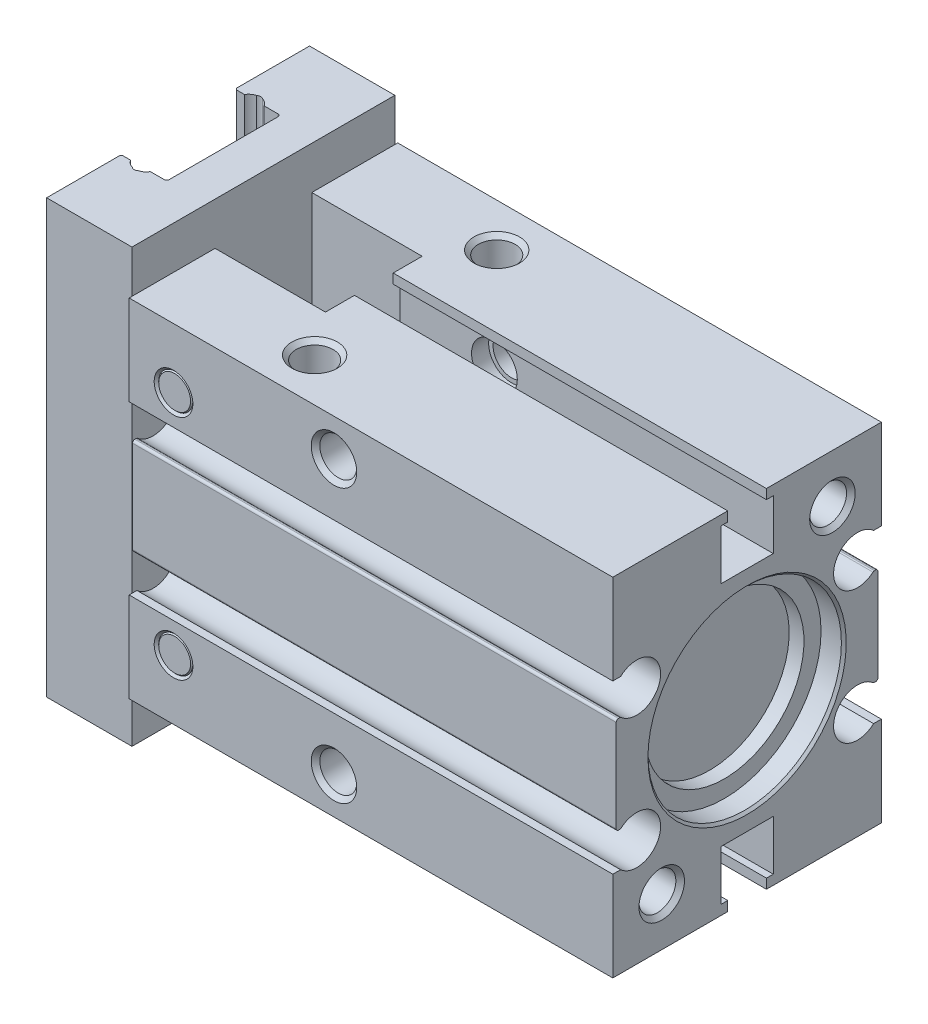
ISO-10303-21;
HEADER;
FILE_DESCRIPTION(('STEP AP214'),'2;1');
FILE_NAME('part.step','',(''),(''),'','','');
FILE_SCHEMA(('AUTOMOTIVE_DESIGN { 1 0 10303 214 1 1 1 1 }'));
ENDSEC;
DATA;
#1=APPLICATION_CONTEXT('core data for automotive mechanical design processes');
#2=APPLICATION_PROTOCOL_DEFINITION('international standard','automotive_design',2000,#1);
#3=PRODUCT_CONTEXT('',#1,'mechanical');
#4=PRODUCT('Part','Part','',(#3));
#5=PRODUCT_RELATED_PRODUCT_CATEGORY('part','',(#4));
#6=PRODUCT_DEFINITION_FORMATION('','',#4);
#7=PRODUCT_DEFINITION_CONTEXT('part definition',#1,'design');
#8=PRODUCT_DEFINITION('design','',#6,#7);
#9=PRODUCT_DEFINITION_SHAPE('','',#8);
#10=(LENGTH_UNIT() NAMED_UNIT(*) SI_UNIT(.MILLI.,.METRE.));
#11=(NAMED_UNIT(*) PLANE_ANGLE_UNIT() SI_UNIT($,.RADIAN.));
#12=(NAMED_UNIT(*) SI_UNIT($,.STERADIAN.) SOLID_ANGLE_UNIT());
#13=UNCERTAINTY_MEASURE_WITH_UNIT(LENGTH_MEASURE(1.E-05),#10,'distance_accuracy_value','');
#14=(GEOMETRIC_REPRESENTATION_CONTEXT(3) GLOBAL_UNCERTAINTY_ASSIGNED_CONTEXT((#13)) GLOBAL_UNIT_ASSIGNED_CONTEXT((#10,
#11,#12)) REPRESENTATION_CONTEXT('',''));
#15=CARTESIAN_POINT('',(0.,0.,0.));
#16=DIRECTION('',(0.,0.,1.));
#17=DIRECTION('',(1.,0.,0.));
#18=AXIS2_PLACEMENT_3D('',#15,#16,#17);
#19=CARTESIAN_POINT('',(-50.,0.,0.));
#20=DIRECTION('',(1.,0.,0.));
#21=DIRECTION('',(0.,0.,-1.));
#22=AXIS2_PLACEMENT_3D('',#19,#20,#21);
#23=PLANE('',#22);
#24=DIRECTION('',(0.,0.,-1.));
#25=VECTOR('',#24,1.);
#26=CARTESIAN_POINT('',(-50.,-19.,11.55));
#27=LINE('',#26,#25);
#28=CARTESIAN_POINT('',(-50.,-19.,-5.14142135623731));
#29=VERTEX_POINT('',#28);
#30=CARTESIAN_POINT('',(-50.,-19.,-11.55));
#31=VERTEX_POINT('',#30);
#32=EDGE_CURVE('E526',#29,#31,#27,.T.);
#33=ORIENTED_EDGE('',*,*,#32,.F.);
#34=DIRECTION('',(0.,1.,0.));
#35=VECTOR('',#34,1.);
#36=CARTESIAN_POINT('',(-50.,-19.,-5.14142135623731));
#37=LINE('',#36,#35);
#38=CARTESIAN_POINT('',(-50.,19.,-5.14142135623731));
#39=VERTEX_POINT('',#38);
#40=EDGE_CURVE('E536',#29,#39,#37,.T.);
#41=ORIENTED_EDGE('',*,*,#40,.T.);
#42=DIRECTION('',(0.,0.,1.));
#43=VECTOR('',#42,1.);
#44=CARTESIAN_POINT('',(-50.,19.,-11.55));
#45=LINE('',#44,#43);
#46=CARTESIAN_POINT('',(-50.,19.,-11.55));
#47=VERTEX_POINT('',#46);
#48=EDGE_CURVE('E516',#47,#39,#45,.T.);
#49=ORIENTED_EDGE('',*,*,#48,.F.);
#50=DIRECTION('',(0.,1.,0.));
#51=VECTOR('',#50,1.);
#52=CARTESIAN_POINT('',(-50.,-19.,-11.55));
#53=LINE('',#52,#51);
#54=EDGE_CURVE('E529',#31,#47,#53,.T.);
#55=ORIENTED_EDGE('',*,*,#54,.F.);
#56=EDGE_LOOP('',(#33,#41,#49,#55));
#57=FACE_BOUND('',#56,.T.);
#58=ADVANCED_FACE('F16',(#57),#23,.F.);
#59=CARTESIAN_POINT('',(-42.5,5.8,9.7));
#60=DIRECTION('',(-1.,0.,0.));
#61=DIRECTION('',(0.,0.,1.));
#62=AXIS2_PLACEMENT_3D('',#59,#60,#61);
#63=PLANE('',#62);
#64=DIRECTION('',(0.,0.,-1.));
#65=VECTOR('',#64,1.);
#66=CARTESIAN_POINT('',(-42.5,-15.25,-1.7));
#67=LINE('',#66,#65);
#68=CARTESIAN_POINT('',(-42.5,-15.25,-11.55));
#69=VERTEX_POINT('',#68);
#70=CARTESIAN_POINT('',(-42.5,-15.25,-11.8));
#71=VERTEX_POINT('',#70);
#72=EDGE_CURVE('E726',#69,#71,#67,.T.);
#73=ORIENTED_EDGE('',*,*,#72,.F.);
#74=DIRECTION('',(0.,1.,0.));
#75=VECTOR('',#74,1.);
#76=CARTESIAN_POINT('',(-42.5,-19.,-11.55));
#77=LINE('',#76,#75);
#78=CARTESIAN_POINT('',(-42.5,-7.35,-11.55));
#79=VERTEX_POINT('',#78);
#80=EDGE_CURVE('E521',#69,#79,#77,.T.);
#81=ORIENTED_EDGE('',*,*,#80,.T.);
#82=DIRECTION('',(0.,0.,1.));
#83=VECTOR('',#82,1.);
#84=CARTESIAN_POINT('',(-42.5,-7.35,-11.8));
#85=LINE('',#84,#83);
#86=CARTESIAN_POINT('',(-42.5,-7.35,-11.8));
#87=VERTEX_POINT('',#86);
#88=EDGE_CURVE('E733',#87,#79,#85,.T.);
#89=ORIENTED_EDGE('',*,*,#88,.F.);
#90=DIRECTION('',(0.,1.,0.));
#91=VECTOR('',#90,1.);
#92=CARTESIAN_POINT('',(-42.5,-15.25,-11.8));
#93=LINE('',#92,#91);
#94=EDGE_CURVE('E730',#71,#87,#93,.T.);
#95=ORIENTED_EDGE('',*,*,#94,.F.);
#96=EDGE_LOOP('',(#73,#81,#89,#95));
#97=FACE_BOUND('',#96,.T.);
#98=ADVANCED_FACE('F1067',(#97),#63,.T.);
#99=DIRECTION('',(0.,0.,-1.));
#100=VECTOR('',#99,1.);
#101=CARTESIAN_POINT('',(-42.5,7.35,-11.1168627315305));
#102=LINE('',#101,#100);
#103=CARTESIAN_POINT('',(-42.5,7.35,-11.55));
#104=VERTEX_POINT('',#103);
#105=CARTESIAN_POINT('',(-42.5,7.35,-11.8));
#106=VERTEX_POINT('',#105);
#107=EDGE_CURVE('E763',#104,#106,#102,.T.);
#108=ORIENTED_EDGE('',*,*,#107,.F.);
#109=CARTESIAN_POINT('',(-42.5,15.25,-11.55));
#110=VERTEX_POINT('',#109);
#111=EDGE_CURVE('E1055',#104,#110,#77,.T.);
#112=ORIENTED_EDGE('',*,*,#111,.T.);
#113=DIRECTION('',(0.,0.,1.));
#114=VECTOR('',#113,1.);
#115=CARTESIAN_POINT('',(-42.5,15.25,-11.8));
#116=LINE('',#115,#114);
#117=CARTESIAN_POINT('',(-42.5,15.25,-11.8));
#118=VERTEX_POINT('',#117);
#119=EDGE_CURVE('E770',#118,#110,#116,.T.);
#120=ORIENTED_EDGE('',*,*,#119,.F.);
#121=DIRECTION('',(0.,1.,0.));
#122=VECTOR('',#121,1.);
#123=CARTESIAN_POINT('',(-42.5,7.35,-11.8));
#124=LINE('',#123,#122);
#125=EDGE_CURVE('E767',#106,#118,#124,.T.);
#126=ORIENTED_EDGE('',*,*,#125,.F.);
#127=EDGE_LOOP('',(#108,#112,#120,#126));
#128=FACE_BOUND('',#127,.T.);
#129=ADVANCED_FACE('F1094',(#128),#63,.T.);
#130=DIRECTION('',(0.,0.,1.));
#131=VECTOR('',#130,1.);
#132=CARTESIAN_POINT('',(-42.5,15.25,1.7));
#133=LINE('',#132,#131);
#134=CARTESIAN_POINT('',(-42.5,15.25,11.55));
#135=VERTEX_POINT('',#134);
#136=CARTESIAN_POINT('',(-42.5,15.25,11.8));
#137=VERTEX_POINT('',#136);
#138=EDGE_CURVE('E681',#135,#137,#133,.T.);
#139=ORIENTED_EDGE('',*,*,#138,.F.);
#140=DIRECTION('',(0.,-1.,0.));
#141=VECTOR('',#140,1.);
#142=CARTESIAN_POINT('',(-42.5,19.,11.55));
#143=LINE('',#142,#141);
#144=CARTESIAN_POINT('',(-42.5,7.35,11.55));
#145=VERTEX_POINT('',#144);
#146=EDGE_CURVE('E11',#135,#145,#143,.T.);
#147=ORIENTED_EDGE('',*,*,#146,.T.);
#148=DIRECTION('',(0.,0.,-1.));
#149=VECTOR('',#148,1.);
#150=CARTESIAN_POINT('',(-42.5,7.35,11.8));
#151=LINE('',#150,#149);
#152=CARTESIAN_POINT('',(-42.5,7.35,11.8));
#153=VERTEX_POINT('',#152);
#154=EDGE_CURVE('E685',#153,#145,#151,.T.);
#155=ORIENTED_EDGE('',*,*,#154,.F.);
#156=DIRECTION('',(0.,-1.,0.));
#157=VECTOR('',#156,1.);
#158=CARTESIAN_POINT('',(-42.5,15.25,11.8));
#159=LINE('',#158,#157);
#160=EDGE_CURVE('E680',#137,#153,#159,.T.);
#161=ORIENTED_EDGE('',*,*,#160,.F.);
#162=EDGE_LOOP('',(#139,#147,#155,#161));
#163=FACE_BOUND('',#162,.T.);
#164=ADVANCED_FACE('F1999',(#163),#63,.T.);
#165=DIRECTION('',(0.,0.,1.));
#166=VECTOR('',#165,1.);
#167=CARTESIAN_POINT('',(-42.5,-7.35,11.1168627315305));
#168=LINE('',#167,#166);
#169=CARTESIAN_POINT('',(-42.5,-7.35,11.55));
#170=VERTEX_POINT('',#169);
#171=CARTESIAN_POINT('',(-42.5,-7.35,11.8));
#172=VERTEX_POINT('',#171);
#173=EDGE_CURVE('E715',#170,#172,#168,.T.);
#174=ORIENTED_EDGE('',*,*,#173,.F.);
#175=CARTESIAN_POINT('',(-42.5,-15.25,11.55));
#176=VERTEX_POINT('',#175);
#177=EDGE_CURVE('E25',#170,#176,#143,.T.);
#178=ORIENTED_EDGE('',*,*,#177,.T.);
#179=DIRECTION('',(0.,0.,-1.));
#180=VECTOR('',#179,1.);
#181=CARTESIAN_POINT('',(-42.5,-15.25,11.8));
#182=LINE('',#181,#180);
#183=CARTESIAN_POINT('',(-42.5,-15.25,11.8));
#184=VERTEX_POINT('',#183);
#185=EDGE_CURVE('E723',#184,#176,#182,.T.);
#186=ORIENTED_EDGE('',*,*,#185,.F.);
#187=DIRECTION('',(0.,-1.,0.));
#188=VECTOR('',#187,1.);
#189=CARTESIAN_POINT('',(-42.5,-7.35,11.8));
#190=LINE('',#189,#188);
#191=EDGE_CURVE('E719',#172,#184,#190,.T.);
#192=ORIENTED_EDGE('',*,*,#191,.F.);
#193=EDGE_LOOP('',(#174,#178,#186,#192));
#194=FACE_BOUND('',#193,.T.);
#195=ADVANCED_FACE('F1010',(#194),#63,.T.);
#196=CARTESIAN_POINT('',(-42.5,-10.,2.3));
#197=DIRECTION('',(0.,-1.,0.));
#198=DIRECTION('',(0.,0.,-1.));
#199=AXIS2_PLACEMENT_3D('',#196,#197,#198);
#200=PLANE('',#199);
#201=DIRECTION('',(1.,0.,0.));
#202=VECTOR('',#201,1.);
#203=CARTESIAN_POINT('',(-42.5,-10.,2.3));
#204=LINE('',#203,#202);
#205=CARTESIAN_POINT('',(-24.299750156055,-10.,2.3));
#206=VERTEX_POINT('',#205);
#207=CARTESIAN_POINT('',(0.,-10.,2.3));
#208=VERTEX_POINT('',#207);
#209=EDGE_CURVE('E967',#206,#208,#204,.T.);
#210=ORIENTED_EDGE('',*,*,#209,.F.);
#211=DIRECTION('',(0.,0.,1.));
#212=VECTOR('',#211,1.);
#213=CARTESIAN_POINT('',(-24.299750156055,-10.,-11.8));
#214=LINE('',#213,#212);
#215=CARTESIAN_POINT('',(-24.299750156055,-10.,-2.3));
#216=VERTEX_POINT('',#215);
#217=EDGE_CURVE('E580',#206,#216,#214,.F.);
#218=ORIENTED_EDGE('',*,*,#217,.T.);
#219=DIRECTION('',(1.,0.,0.));
#220=VECTOR('',#219,1.);
#221=CARTESIAN_POINT('',(-42.5,-10.,-2.3));
#222=LINE('',#221,#220);
#223=CARTESIAN_POINT('',(0.,-10.,-2.3));
#224=VERTEX_POINT('',#223);
#225=EDGE_CURVE('E963',#216,#224,#222,.T.);
#226=ORIENTED_EDGE('',*,*,#225,.T.);
#227=DIRECTION('',(0.,0.,-1.));
#228=VECTOR('',#227,1.);
#229=CARTESIAN_POINT('',(0.,-10.,2.3));
#230=LINE('',#229,#228);
#231=EDGE_CURVE('E827',#208,#224,#230,.T.);
#232=ORIENTED_EDGE('',*,*,#231,.F.);
#233=EDGE_LOOP('',(#210,#218,#226,#232));
#234=FACE_BOUND('',#233,.T.);
#235=ADVANCED_FACE('F1396',(#234),#200,.T.);
#236=CARTESIAN_POINT('',(-32.8,-10.,-2.3));
#237=VERTEX_POINT('',#236);
#238=CARTESIAN_POINT('',(-24.700249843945,-10.,-2.3));
#239=VERTEX_POINT('',#238);
#240=EDGE_CURVE('E960',#237,#239,#222,.T.);
#241=ORIENTED_EDGE('',*,*,#240,.T.);
#242=DIRECTION('',(0.,0.,1.));
#243=VECTOR('',#242,1.);
#244=CARTESIAN_POINT('',(-24.700249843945,-10.,-11.8));
#245=LINE('',#244,#243);
#246=CARTESIAN_POINT('',(-24.700249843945,-10.,2.3));
#247=VERTEX_POINT('',#246);
#248=EDGE_CURVE('E577',#239,#247,#245,.T.);
#249=ORIENTED_EDGE('',*,*,#248,.T.);
#250=CARTESIAN_POINT('',(-32.8,-10.,2.3));
#251=VERTEX_POINT('',#250);
#252=EDGE_CURVE('E964',#251,#247,#204,.T.);
#253=ORIENTED_EDGE('',*,*,#252,.F.);
#254=DIRECTION('',(0.,0.,1.));
#255=VECTOR('',#254,1.);
#256=CARTESIAN_POINT('',(-32.8,-10.,2.3));
#257=LINE('',#256,#255);
#258=EDGE_CURVE('E654',#237,#251,#257,.T.);
#259=ORIENTED_EDGE('',*,*,#258,.F.);
#260=EDGE_LOOP('',(#241,#249,#253,#259));
#261=FACE_BOUND('',#260,.T.);
#262=ADVANCED_FACE('F1343',(#261),#200,.T.);
#263=CARTESIAN_POINT('',(-42.5,10.,-2.3));
#264=DIRECTION('',(0.,1.,0.));
#265=DIRECTION('',(0.,0.,1.));
#266=AXIS2_PLACEMENT_3D('',#263,#264,#265);
#267=PLANE('',#266);
#268=DIRECTION('',(1.,0.,0.));
#269=VECTOR('',#268,1.);
#270=CARTESIAN_POINT('',(-42.5,10.,2.3));
#271=LINE('',#270,#269);
#272=CARTESIAN_POINT('',(-32.8,10.,2.3));
#273=VERTEX_POINT('',#272);
#274=CARTESIAN_POINT('',(-24.700249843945,10.,2.3));
#275=VERTEX_POINT('',#274);
#276=EDGE_CURVE('E912',#273,#275,#271,.T.);
#277=ORIENTED_EDGE('',*,*,#276,.T.);
#278=DIRECTION('',(0.,0.,1.));
#279=VECTOR('',#278,1.);
#280=CARTESIAN_POINT('',(-24.700249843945,10.,-11.8));
#281=LINE('',#280,#279);
#282=CARTESIAN_POINT('',(-24.700249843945,10.,-2.3));
#283=VERTEX_POINT('',#282);
#284=EDGE_CURVE('E613',#275,#283,#281,.F.);
#285=ORIENTED_EDGE('',*,*,#284,.T.);
#286=DIRECTION('',(1.,0.,0.));
#287=VECTOR('',#286,1.);
#288=CARTESIAN_POINT('',(-42.5,10.,-2.3));
#289=LINE('',#288,#287);
#290=CARTESIAN_POINT('',(-32.8,10.,-2.3));
#291=VERTEX_POINT('',#290);
#292=EDGE_CURVE('E916',#291,#283,#289,.T.);
#293=ORIENTED_EDGE('',*,*,#292,.F.);
#294=DIRECTION('',(0.,0.,-1.));
#295=VECTOR('',#294,1.);
#296=CARTESIAN_POINT('',(-32.8,10.,-2.3));
#297=LINE('',#296,#295);
#298=EDGE_CURVE('E668',#273,#291,#297,.T.);
#299=ORIENTED_EDGE('',*,*,#298,.F.);
#300=EDGE_LOOP('',(#277,#285,#293,#299));
#301=FACE_BOUND('',#300,.T.);
#302=ADVANCED_FACE('F1340',(#301),#267,.T.);
#303=CARTESIAN_POINT('',(-24.299750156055,10.,-2.3));
#304=VERTEX_POINT('',#303);
#305=CARTESIAN_POINT('',(0.,10.,-2.3));
#306=VERTEX_POINT('',#305);
#307=EDGE_CURVE('E919',#304,#306,#289,.T.);
#308=ORIENTED_EDGE('',*,*,#307,.F.);
#309=DIRECTION('',(0.,0.,1.));
#310=VECTOR('',#309,1.);
#311=CARTESIAN_POINT('',(-24.299750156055,10.,-11.8));
#312=LINE('',#311,#310);
#313=CARTESIAN_POINT('',(-24.299750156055,10.,2.3));
#314=VERTEX_POINT('',#313);
#315=EDGE_CURVE('E610',#304,#314,#312,.T.);
#316=ORIENTED_EDGE('',*,*,#315,.T.);
#317=CARTESIAN_POINT('',(0.,10.,2.3));
#318=VERTEX_POINT('',#317);
#319=EDGE_CURVE('E915',#314,#318,#271,.T.);
#320=ORIENTED_EDGE('',*,*,#319,.T.);
#321=DIRECTION('',(0.,0.,1.));
#322=VECTOR('',#321,1.);
#323=CARTESIAN_POINT('',(0.,10.,-2.3));
#324=LINE('',#323,#322);
#325=EDGE_CURVE('E893',#306,#318,#324,.T.);
#326=ORIENTED_EDGE('',*,*,#325,.F.);
#327=EDGE_LOOP('',(#308,#316,#320,#326));
#328=FACE_BOUND('',#327,.T.);
#329=ADVANCED_FACE('F1165',(#328),#267,.T.);
#330=CARTESIAN_POINT('',(-42.5,15.25,1.7));
#331=DIRECTION('',(0.,1.,0.));
#332=DIRECTION('',(0.,0.,1.));
#333=AXIS2_PLACEMENT_3D('',#330,#331,#332);
#334=PLANE('',#333);
#335=CARTESIAN_POINT('',(-30.,15.25,8.));
#336=DIRECTION('',(0.,-1.,0.));
#337=DIRECTION('',(0.,0.,-1.));
#338=AXIS2_PLACEMENT_3D('',#335,#336,#337);
#339=CIRCLE('',#338,2.);
#340=CARTESIAN_POINT('',(-30.,15.25,6.));
#341=VERTEX_POINT('',#340);
#342=EDGE_CURVE('E1894',#341,#341,#339,.T.);
#343=ORIENTED_EDGE('',*,*,#342,.T.);
#344=EDGE_LOOP('',(#343));
#345=FACE_BOUND('',#344,.T.);
#346=DIRECTION('',(0.,0.,-1.));
#347=VECTOR('',#346,1.);
#348=CARTESIAN_POINT('',(-32.8,15.25,4.25));
#349=LINE('',#348,#347);
#350=CARTESIAN_POINT('',(-32.8,15.25,4.25));
#351=VERTEX_POINT('',#350);
#352=CARTESIAN_POINT('',(-32.8,15.25,1.7));
#353=VERTEX_POINT('',#352);
#354=EDGE_CURVE('E626',#351,#353,#349,.T.);
#355=ORIENTED_EDGE('',*,*,#354,.F.);
#356=DIRECTION('',(1.,0.,0.));
#357=VECTOR('',#356,1.);
#358=CARTESIAN_POINT('',(-42.5,15.25,4.25));
#359=LINE('',#358,#357);
#360=CARTESIAN_POINT('',(-42.5,15.25,4.25));
#361=VERTEX_POINT('',#360);
#362=EDGE_CURVE('E622',#361,#351,#359,.T.);
#363=ORIENTED_EDGE('',*,*,#362,.F.);
#364=EDGE_CURVE('E677',#361,#135,#133,.T.);
#365=ORIENTED_EDGE('',*,*,#364,.T.);
#366=ORIENTED_EDGE('',*,*,#138,.T.);
#367=DIRECTION('',(1.,0.,0.));
#368=VECTOR('',#367,1.);
#369=CARTESIAN_POINT('',(-42.5,15.25,11.8));
#370=LINE('',#369,#368);
#371=CARTESIAN_POINT('',(0.,15.25,11.8));
#372=VERTEX_POINT('',#371);
#373=EDGE_CURVE('E773',#137,#372,#370,.T.);
#374=ORIENTED_EDGE('',*,*,#373,.T.);
#375=DIRECTION('',(0.,0.,1.));
#376=VECTOR('',#375,1.);
#377=CARTESIAN_POINT('',(0.,15.25,1.7));
#378=LINE('',#377,#376);
#379=CARTESIAN_POINT('',(0.,15.25,1.7));
#380=VERTEX_POINT('',#379);
#381=EDGE_CURVE('E676',#380,#372,#378,.T.);
#382=ORIENTED_EDGE('',*,*,#381,.F.);
#383=DIRECTION('',(1.,0.,0.));
#384=VECTOR('',#383,1.);
#385=CARTESIAN_POINT('',(-42.5,15.25,1.7));
#386=LINE('',#385,#384);
#387=EDGE_CURVE('E905',#353,#380,#386,.T.);
#388=ORIENTED_EDGE('',*,*,#387,.F.);
#389=EDGE_LOOP('',(#355,#363,#365,#366,#374,#382,#388));
#390=FACE_BOUND('',#389,.T.);
#391=ADVANCED_FACE('F18',(#345,#390),#334,.T.);
#392=CARTESIAN_POINT('',(-42.5,14.4,1.7));
#393=DIRECTION('',(0.,0.,-1.));
#394=DIRECTION('',(-1.,0.,0.));
#395=AXIS2_PLACEMENT_3D('',#392,#393,#394);
#396=PLANE('',#395);
#397=DIRECTION('',(0.,-1.,0.));
#398=VECTOR('',#397,1.);
#399=CARTESIAN_POINT('',(-32.8,14.4,1.7));
#400=LINE('',#399,#398);
#401=CARTESIAN_POINT('',(-32.8,14.4,1.7));
#402=VERTEX_POINT('',#401);
#403=EDGE_CURVE('E674',#353,#402,#400,.T.);
#404=ORIENTED_EDGE('',*,*,#403,.F.);
#405=ORIENTED_EDGE('',*,*,#387,.T.);
#406=DIRECTION('',(0.,1.,0.));
#407=VECTOR('',#406,1.);
#408=CARTESIAN_POINT('',(0.,14.4,1.7));
#409=LINE('',#408,#407);
#410=CARTESIAN_POINT('',(0.,14.4,1.7));
#411=VERTEX_POINT('',#410);
#412=EDGE_CURVE('E902',#411,#380,#409,.T.);
#413=ORIENTED_EDGE('',*,*,#412,.F.);
#414=DIRECTION('',(1.,0.,0.));
#415=VECTOR('',#414,1.);
#416=CARTESIAN_POINT('',(-42.5,14.4,1.7));
#417=LINE('',#416,#415);
#418=EDGE_CURVE('E908',#402,#411,#417,.T.);
#419=ORIENTED_EDGE('',*,*,#418,.F.);
#420=EDGE_LOOP('',(#404,#405,#413,#419));
#421=FACE_BOUND('',#420,.T.);
#422=ADVANCED_FACE('F1178',(#421),#396,.T.);
#423=CARTESIAN_POINT('',(-42.5,14.4,2.3));
#424=DIRECTION('',(0.,-1.,0.));
#425=DIRECTION('',(0.,0.,-1.));
#426=AXIS2_PLACEMENT_3D('',#423,#424,#425);
#427=PLANE('',#426);
#428=DIRECTION('',(0.,0.,1.));
#429=VECTOR('',#428,1.);
#430=CARTESIAN_POINT('',(-32.8,14.4,2.3));
#431=LINE('',#430,#429);
#432=CARTESIAN_POINT('',(-32.8,14.4,2.3));
#433=VERTEX_POINT('',#432);
#434=EDGE_CURVE('E672',#402,#433,#431,.T.);
#435=ORIENTED_EDGE('',*,*,#434,.F.);
#436=ORIENTED_EDGE('',*,*,#418,.T.);
#437=DIRECTION('',(0.,0.,-1.));
#438=VECTOR('',#437,1.);
#439=CARTESIAN_POINT('',(0.,14.4,2.3));
#440=LINE('',#439,#438);
#441=CARTESIAN_POINT('',(0.,14.4,2.3));
#442=VERTEX_POINT('',#441);
#443=EDGE_CURVE('E899',#442,#411,#440,.T.);
#444=ORIENTED_EDGE('',*,*,#443,.F.);
#445=DIRECTION('',(1.,0.,0.));
#446=VECTOR('',#445,1.);
#447=CARTESIAN_POINT('',(-42.5,14.4,2.3));
#448=LINE('',#447,#446);
#449=EDGE_CURVE('E910',#433,#442,#448,.T.);
#450=ORIENTED_EDGE('',*,*,#449,.F.);
#451=EDGE_LOOP('',(#435,#436,#444,#450));
#452=FACE_BOUND('',#451,.T.);
#453=ADVANCED_FACE('F1335',(#452),#427,.T.);
#454=CARTESIAN_POINT('',(-42.5,10.,2.3));
#455=DIRECTION('',(0.,0.,-1.));
#456=DIRECTION('',(-1.,0.,0.));
#457=AXIS2_PLACEMENT_3D('',#454,#455,#456);
#458=PLANE('',#457);
#459=ORIENTED_EDGE('',*,*,#319,.F.);
#460=CARTESIAN_POINT('',(-24.5,12.,2.3));
#461=DIRECTION('',(0.,0.,-1.));
#462=DIRECTION('',(-1.,0.,0.));
#463=AXIS2_PLACEMENT_3D('',#460,#461,#462);
#464=CIRCLE('',#463,2.01);
#465=EDGE_CURVE('E616',#314,#275,#464,.F.);
#466=ORIENTED_EDGE('',*,*,#465,.T.);
#467=ORIENTED_EDGE('',*,*,#276,.F.);
#468=DIRECTION('',(0.,-1.,0.));
#469=VECTOR('',#468,1.);
#470=CARTESIAN_POINT('',(-32.8,10.,2.3));
#471=LINE('',#470,#469);
#472=EDGE_CURVE('E670',#433,#273,#471,.T.);
#473=ORIENTED_EDGE('',*,*,#472,.F.);
#474=ORIENTED_EDGE('',*,*,#449,.T.);
#475=DIRECTION('',(0.,1.,0.));
#476=VECTOR('',#475,1.);
#477=CARTESIAN_POINT('',(0.,10.,2.3));
#478=LINE('',#477,#476);
#479=EDGE_CURVE('E896',#318,#442,#478,.T.);
#480=ORIENTED_EDGE('',*,*,#479,.F.);
#481=EDGE_LOOP('',(#459,#466,#467,#473,#474,#480));
#482=FACE_BOUND('',#481,.T.);
#483=ADVANCED_FACE('F1169',(#482),#458,.T.);
#484=CARTESIAN_POINT('',(-42.5,14.4,-2.3));
#485=DIRECTION('',(0.,0.,1.));
#486=DIRECTION('',(1.,0.,0.));
#487=AXIS2_PLACEMENT_3D('',#484,#485,#486);
#488=PLANE('',#487);
#489=ORIENTED_EDGE('',*,*,#292,.T.);
#490=CARTESIAN_POINT('',(-24.5,12.,-2.3));
#491=DIRECTION('',(0.,0.,1.));
#492=DIRECTION('',(1.,0.,0.));
#493=AXIS2_PLACEMENT_3D('',#490,#491,#492);
#494=CIRCLE('',#493,2.01);
#495=EDGE_CURVE('E907',#283,#304,#494,.F.);
#496=ORIENTED_EDGE('',*,*,#495,.T.);
#497=ORIENTED_EDGE('',*,*,#307,.T.);
#498=DIRECTION('',(0.,-1.,0.));
#499=VECTOR('',#498,1.);
#500=CARTESIAN_POINT('',(0.,14.4,-2.3));
#501=LINE('',#500,#499);
#502=CARTESIAN_POINT('',(0.,14.4,-2.3));
#503=VERTEX_POINT('',#502);
#504=EDGE_CURVE('E890',#503,#306,#501,.T.);
#505=ORIENTED_EDGE('',*,*,#504,.F.);
#506=DIRECTION('',(1.,0.,0.));
#507=VECTOR('',#506,1.);
#508=CARTESIAN_POINT('',(-42.5,14.4,-2.3));
#509=LINE('',#508,#507);
#510=CARTESIAN_POINT('',(-32.8,14.4,-2.3));
#511=VERTEX_POINT('',#510);
#512=EDGE_CURVE('E920',#511,#503,#509,.T.);
#513=ORIENTED_EDGE('',*,*,#512,.F.);
#514=DIRECTION('',(0.,1.,0.));
#515=VECTOR('',#514,1.);
#516=CARTESIAN_POINT('',(-32.8,14.4,-2.3));
#517=LINE('',#516,#515);
#518=EDGE_CURVE('E666',#291,#511,#517,.T.);
#519=ORIENTED_EDGE('',*,*,#518,.F.);
#520=EDGE_LOOP('',(#489,#496,#497,#505,#513,#519));
#521=FACE_BOUND('',#520,.T.);
#522=ADVANCED_FACE('F1162',(#521),#488,.T.);
#523=CARTESIAN_POINT('',(-42.5,14.4,-1.7));
#524=DIRECTION('',(0.,-1.,0.));
#525=DIRECTION('',(0.,0.,-1.));
#526=AXIS2_PLACEMENT_3D('',#523,#524,#525);
#527=PLANE('',#526);
#528=DIRECTION('',(0.,0.,1.));
#529=VECTOR('',#528,1.);
#530=CARTESIAN_POINT('',(-32.8,14.4,-1.7));
#531=LINE('',#530,#529);
#532=CARTESIAN_POINT('',(-32.8,14.4,-1.7));
#533=VERTEX_POINT('',#532);
#534=EDGE_CURVE('E664',#511,#533,#531,.T.);
#535=ORIENTED_EDGE('',*,*,#534,.F.);
#536=ORIENTED_EDGE('',*,*,#512,.T.);
#537=DIRECTION('',(0.,0.,-1.));
#538=VECTOR('',#537,1.);
#539=CARTESIAN_POINT('',(0.,14.4,-1.7));
#540=LINE('',#539,#538);
#541=CARTESIAN_POINT('',(0.,14.4,-1.7));
#542=VERTEX_POINT('',#541);
#543=EDGE_CURVE('E887',#542,#503,#540,.T.);
#544=ORIENTED_EDGE('',*,*,#543,.F.);
#545=DIRECTION('',(1.,0.,0.));
#546=VECTOR('',#545,1.);
#547=CARTESIAN_POINT('',(-42.5,14.4,-1.7));
#548=LINE('',#547,#546);
#549=EDGE_CURVE('E922',#533,#542,#548,.T.);
#550=ORIENTED_EDGE('',*,*,#549,.F.);
#551=EDGE_LOOP('',(#535,#536,#544,#550));
#552=FACE_BOUND('',#551,.T.);
#553=ADVANCED_FACE('F1158',(#552),#527,.T.);
#554=CARTESIAN_POINT('',(-42.5,15.25,-1.7));
#555=DIRECTION('',(0.,0.,1.));
#556=DIRECTION('',(0.,-1.,0.));
#557=AXIS2_PLACEMENT_3D('',#554,#555,#556);
#558=PLANE('',#557);
#559=DIRECTION('',(0.,1.,0.));
#560=VECTOR('',#559,1.);
#561=CARTESIAN_POINT('',(-32.8,15.25,-1.7));
#562=LINE('',#561,#560);
#563=CARTESIAN_POINT('',(-32.8,15.25,-1.7));
#564=VERTEX_POINT('',#563);
#565=EDGE_CURVE('E662',#533,#564,#562,.T.);
#566=ORIENTED_EDGE('',*,*,#565,.F.);
#567=ORIENTED_EDGE('',*,*,#549,.T.);
#568=DIRECTION('',(0.,-1.,0.));
#569=VECTOR('',#568,1.);
#570=CARTESIAN_POINT('',(0.,15.25,-1.7));
#571=LINE('',#570,#569);
#572=CARTESIAN_POINT('',(0.,15.25,-1.7));
#573=VERTEX_POINT('',#572);
#574=EDGE_CURVE('E884',#573,#542,#571,.T.);
#575=ORIENTED_EDGE('',*,*,#574,.F.);
#576=DIRECTION('',(1.,0.,0.));
#577=VECTOR('',#576,1.);
#578=CARTESIAN_POINT('',(-42.5,15.25,-1.7));
#579=LINE('',#578,#577);
#580=EDGE_CURVE('E924',#564,#573,#579,.T.);
#581=ORIENTED_EDGE('',*,*,#580,.F.);
#582=EDGE_LOOP('',(#566,#567,#575,#581));
#583=FACE_BOUND('',#582,.T.);
#584=ADVANCED_FACE('F1154',(#583),#558,.T.);
#585=CARTESIAN_POINT('',(-42.5,15.25,-11.8));
#586=DIRECTION('',(0.,1.,0.));
#587=DIRECTION('',(0.,0.,1.));
#588=AXIS2_PLACEMENT_3D('',#585,#586,#587);
#589=PLANE('',#588);
#590=CARTESIAN_POINT('',(-30.,15.25,-8.));
#591=DIRECTION('',(0.,-1.,0.));
#592=DIRECTION('',(0.,0.,-1.));
#593=AXIS2_PLACEMENT_3D('',#590,#591,#592);
#594=CIRCLE('',#593,2.);
#595=CARTESIAN_POINT('',(-30.,15.25,-10.));
#596=VERTEX_POINT('',#595);
#597=EDGE_CURVE('E1882',#596,#596,#594,.T.);
#598=ORIENTED_EDGE('',*,*,#597,.T.);
#599=EDGE_LOOP('',(#598));
#600=FACE_BOUND('',#599,.T.);
#601=DIRECTION('',(-1.,0.,0.));
#602=VECTOR('',#601,1.);
#603=CARTESIAN_POINT('',(-32.8,15.25,-4.25));
#604=LINE('',#603,#602);
#605=CARTESIAN_POINT('',(-32.8,15.25,-4.25));
#606=VERTEX_POINT('',#605);
#607=CARTESIAN_POINT('',(-42.5,15.25,-4.25));
#608=VERTEX_POINT('',#607);
#609=EDGE_CURVE('E619',#606,#608,#604,.T.);
#610=ORIENTED_EDGE('',*,*,#609,.F.);
#611=EDGE_CURVE('E625',#564,#606,#349,.T.);
#612=ORIENTED_EDGE('',*,*,#611,.F.);
#613=ORIENTED_EDGE('',*,*,#580,.T.);
#614=DIRECTION('',(0.,0.,1.));
#615=VECTOR('',#614,1.);
#616=CARTESIAN_POINT('',(0.,15.25,-11.8));
#617=LINE('',#616,#615);
#618=CARTESIAN_POINT('',(0.,15.25,-11.8));
#619=VERTEX_POINT('',#618);
#620=EDGE_CURVE('E881',#619,#573,#617,.T.);
#621=ORIENTED_EDGE('',*,*,#620,.F.);
#622=DIRECTION('',(1.,0.,0.));
#623=VECTOR('',#622,1.);
#624=CARTESIAN_POINT('',(-42.5,15.25,-11.8));
#625=LINE('',#624,#623);
#626=EDGE_CURVE('E926',#118,#619,#625,.T.);
#627=ORIENTED_EDGE('',*,*,#626,.F.);
#628=ORIENTED_EDGE('',*,*,#119,.T.);
#629=EDGE_CURVE('E545',#110,#608,#116,.T.);
#630=ORIENTED_EDGE('',*,*,#629,.T.);
#631=EDGE_LOOP('',(#610,#612,#613,#621,#627,#628,#630));
#632=FACE_BOUND('',#631,.T.);
#633=ADVANCED_FACE('F1090',(#600,#632),#589,.T.);
#634=CARTESIAN_POINT('',(-42.5,7.35,-11.8));
#635=DIRECTION('',(0.,0.,-1.));
#636=DIRECTION('',(-1.,0.,0.));
#637=AXIS2_PLACEMENT_3D('',#634,#635,#636);
#638=PLANE('',#637);
#639=CARTESIAN_POINT('',(-38.6,10.,-11.8000000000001));
#640=DIRECTION('',(0.,0.,1.));
#641=DIRECTION('',(0.,-1.,0.));
#642=AXIS2_PLACEMENT_3D('',#639,#640,#641);
#643=CIRCLE('',#642,1.7);
#644=CARTESIAN_POINT('',(-38.6,8.3,-11.8000000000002));
#645=VERTEX_POINT('',#644);
#646=EDGE_CURVE('E1465',#645,#645,#643,.T.);
#647=ORIENTED_EDGE('',*,*,#646,.T.);
#648=EDGE_LOOP('',(#647));
#649=FACE_BOUND('',#648,.T.);
#650=CARTESIAN_POINT('',(-24.5,12.,-11.8));
#651=DIRECTION('',(0.,0.,1.));
#652=DIRECTION('',(1.,0.,0.));
#653=AXIS2_PLACEMENT_3D('',#650,#651,#652);
#654=CIRCLE('',#653,2.);
#655=CARTESIAN_POINT('',(-22.5,12.,-11.8));
#656=VERTEX_POINT('',#655);
#657=EDGE_CURVE('E586',#656,#656,#654,.T.);
#658=ORIENTED_EDGE('',*,*,#657,.T.);
#659=EDGE_LOOP('',(#658));
#660=FACE_BOUND('',#659,.T.);
#661=DIRECTION('',(0.,1.,0.));
#662=VECTOR('',#661,1.);
#663=CARTESIAN_POINT('',(0.,7.35,-11.8));
#664=LINE('',#663,#662);
#665=CARTESIAN_POINT('',(0.,7.35,-11.8));
#666=VERTEX_POINT('',#665);
#667=EDGE_CURVE('E878',#666,#619,#664,.T.);
#668=ORIENTED_EDGE('',*,*,#667,.F.);
#669=DIRECTION('',(1.,0.,0.));
#670=VECTOR('',#669,1.);
#671=CARTESIAN_POINT('',(-42.5,7.35,-11.8));
#672=LINE('',#671,#670);
#673=EDGE_CURVE('E928',#106,#666,#672,.T.);
#674=ORIENTED_EDGE('',*,*,#673,.F.);
#675=ORIENTED_EDGE('',*,*,#125,.T.);
#676=ORIENTED_EDGE('',*,*,#626,.T.);
#677=EDGE_LOOP('',(#668,#674,#675,#676));
#678=FACE_BOUND('',#677,.T.);
#679=ADVANCED_FACE('F1098',(#649,#660,#678),#638,.T.);
#680=CARTESIAN_POINT('',(-42.5,7.35,-11.1168627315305));
#681=DIRECTION('',(0.,-1.,0.));
#682=DIRECTION('',(0.,0.,-1.));
#683=AXIS2_PLACEMENT_3D('',#680,#681,#682);
#684=PLANE('',#683);
#685=DIRECTION('',(0.,0.,-1.));
#686=VECTOR('',#685,1.);
#687=CARTESIAN_POINT('',(0.,7.35,-11.1168627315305));
#688=LINE('',#687,#686);
#689=CARTESIAN_POINT('',(0.,7.35,-11.1168627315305));
#690=VERTEX_POINT('',#689);
#691=EDGE_CURVE('E875',#690,#666,#688,.T.);
#692=ORIENTED_EDGE('',*,*,#691,.F.);
#693=DIRECTION('',(1.,0.,0.));
#694=VECTOR('',#693,1.);
#695=CARTESIAN_POINT('',(-42.5,7.35,-11.1168627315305));
#696=LINE('',#695,#694);
#697=CARTESIAN_POINT('',(-42.5,7.35,-11.1168627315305));
#698=VERTEX_POINT('',#697);
#699=EDGE_CURVE('E930',#698,#690,#696,.T.);
#700=ORIENTED_EDGE('',*,*,#699,.F.);
#701=EDGE_CURVE('E764',#698,#104,#102,.T.);
#702=ORIENTED_EDGE('',*,*,#701,.T.);
#703=ORIENTED_EDGE('',*,*,#107,.T.);
#704=ORIENTED_EDGE('',*,*,#673,.T.);
#705=EDGE_LOOP('',(#692,#700,#702,#703,#704));
#706=FACE_BOUND('',#705,.T.);
#707=ADVANCED_FACE('F1101',(#706),#684,.T.);
#708=CARTESIAN_POINT('',(-42.5,5.8,-9.7));
#709=DIRECTION('',(1.,0.,0.));
#710=DIRECTION('',(0.,0.,-1.));
#711=AXIS2_PLACEMENT_3D('',#708,#709,#710);
#712=CYLINDRICAL_SURFACE('',#711,2.1);
#713=CARTESIAN_POINT('',(0.,5.8,-9.7));
#714=DIRECTION('',(-1.,0.,0.));
#715=DIRECTION('',(0.,0.,1.));
#716=AXIS2_PLACEMENT_3D('',#713,#714,#715);
#717=CIRCLE('',#716,2.1);
#718=CARTESIAN_POINT('',(0.,4.20217391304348,-11.0627001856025));
#719=VERTEX_POINT('',#718);
#720=EDGE_CURVE('E872',#719,#690,#717,.T.);
#721=ORIENTED_EDGE('',*,*,#720,.F.);
#722=DIRECTION('',(1.,0.,0.));
#723=VECTOR('',#722,1.);
#724=CARTESIAN_POINT('',(-42.5,4.20217391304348,-11.0627001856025));
#725=LINE('',#724,#723);
#726=CARTESIAN_POINT('',(-42.5,4.20217391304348,-11.0627001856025));
#727=VERTEX_POINT('',#726);
#728=EDGE_CURVE('E932',#727,#719,#725,.T.);
#729=ORIENTED_EDGE('',*,*,#728,.F.);
#730=CARTESIAN_POINT('',(-42.5,5.8,-9.7));
#731=DIRECTION('',(-1.,0.,0.));
#732=DIRECTION('',(0.,0.,1.));
#733=AXIS2_PLACEMENT_3D('',#730,#731,#732);
#734=CIRCLE('',#733,2.1);
#735=EDGE_CURVE('E760',#727,#698,#734,.T.);
#736=ORIENTED_EDGE('',*,*,#735,.T.);
#737=ORIENTED_EDGE('',*,*,#699,.T.);
#738=EDGE_LOOP('',(#721,#729,#736,#737));
#739=FACE_BOUND('',#738,.T.);
#740=ADVANCED_FACE('F1108',(#739),#712,.F.);
#741=CARTESIAN_POINT('',(-42.5,4.05,-11.1924811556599));
#742=DIRECTION('',(1.,0.,0.));
#743=DIRECTION('',(0.,0.,-1.));
#744=AXIS2_PLACEMENT_3D('',#741,#742,#743);
#745=CYLINDRICAL_SURFACE('',#744,0.200000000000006);
#746=CARTESIAN_POINT('',(0.,4.05,-11.1924811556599));
#747=DIRECTION('',(1.,0.,0.));
#748=DIRECTION('',(0.,0.,-1.));
#749=AXIS2_PLACEMENT_3D('',#746,#747,#748);
#750=CIRCLE('',#749,0.200000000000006);
#751=CARTESIAN_POINT('',(0.,4.25,-11.1924811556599));
#752=VERTEX_POINT('',#751);
#753=EDGE_CURVE('E869',#752,#719,#750,.T.);
#754=ORIENTED_EDGE('',*,*,#753,.F.);
#755=DIRECTION('',(1.,0.,0.));
#756=VECTOR('',#755,1.);
#757=CARTESIAN_POINT('',(-42.5,4.25,-11.1924811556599));
#758=LINE('',#757,#756);
#759=CARTESIAN_POINT('',(-42.5,4.25,-11.1924811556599));
#760=VERTEX_POINT('',#759);
#761=EDGE_CURVE('E934',#760,#752,#758,.T.);
#762=ORIENTED_EDGE('',*,*,#761,.F.);
#763=CARTESIAN_POINT('',(-42.5,4.05,-11.1924811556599));
#764=DIRECTION('',(1.,0.,0.));
#765=DIRECTION('',(0.,0.,-1.));
#766=AXIS2_PLACEMENT_3D('',#763,#764,#765);
#767=CIRCLE('',#766,0.200000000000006);
#768=EDGE_CURVE('E757',#760,#727,#767,.T.);
#769=ORIENTED_EDGE('',*,*,#768,.T.);
#770=ORIENTED_EDGE('',*,*,#728,.T.);
#771=EDGE_LOOP('',(#754,#762,#769,#770));
#772=FACE_BOUND('',#771,.T.);
#773=ADVANCED_FACE('F1111',(#772),#745,.T.);
#774=CARTESIAN_POINT('',(-42.5,4.25,-11.3));
#775=DIRECTION('',(0.,1.,0.));
#776=DIRECTION('',(0.,0.,1.));
#777=AXIS2_PLACEMENT_3D('',#774,#775,#776);
#778=PLANE('',#777);
#779=DIRECTION('',(0.,0.,1.));
#780=VECTOR('',#779,1.);
#781=CARTESIAN_POINT('',(0.,4.25,-11.3));
#782=LINE('',#781,#780);
#783=CARTESIAN_POINT('',(0.,4.25,-11.3));
#784=VERTEX_POINT('',#783);
#785=EDGE_CURVE('E866',#784,#752,#782,.T.);
#786=ORIENTED_EDGE('',*,*,#785,.F.);
#787=DIRECTION('',(1.,0.,0.));
#788=VECTOR('',#787,1.);
#789=CARTESIAN_POINT('',(-42.5,4.25,-11.3));
#790=LINE('',#789,#788);
#791=CARTESIAN_POINT('',(-42.5,4.25,-11.3));
#792=VERTEX_POINT('',#791);
#793=EDGE_CURVE('E936',#792,#784,#790,.T.);
#794=ORIENTED_EDGE('',*,*,#793,.F.);
#795=DIRECTION('',(0.,0.,1.));
#796=VECTOR('',#795,1.);
#797=CARTESIAN_POINT('',(-42.5,4.25,-11.3));
#798=LINE('',#797,#796);
#799=EDGE_CURVE('E754',#792,#760,#798,.T.);
#800=ORIENTED_EDGE('',*,*,#799,.T.);
#801=ORIENTED_EDGE('',*,*,#761,.T.);
#802=EDGE_LOOP('',(#786,#794,#800,#801));
#803=FACE_BOUND('',#802,.T.);
#804=ADVANCED_FACE('F1115',(#803),#778,.T.);
#805=CARTESIAN_POINT('',(-42.5,4.05,-11.3));
#806=DIRECTION('',(1.,0.,0.));
#807=DIRECTION('',(0.,0.,-1.));
#808=AXIS2_PLACEMENT_3D('',#805,#806,#807);
#809=CYLINDRICAL_SURFACE('',#808,0.199999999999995);
#810=CARTESIAN_POINT('',(0.,4.05,-11.3));
#811=DIRECTION('',(1.,0.,0.));
#812=DIRECTION('',(0.,0.,-1.));
#813=AXIS2_PLACEMENT_3D('',#810,#811,#812);
#814=CIRCLE('',#813,0.199999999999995);
#815=CARTESIAN_POINT('',(0.,4.05,-11.5));
#816=VERTEX_POINT('',#815);
#817=EDGE_CURVE('E863',#816,#784,#814,.T.);
#818=ORIENTED_EDGE('',*,*,#817,.F.);
#819=DIRECTION('',(1.,0.,0.));
#820=VECTOR('',#819,1.);
#821=CARTESIAN_POINT('',(-42.5,4.05,-11.5));
#822=LINE('',#821,#820);
#823=CARTESIAN_POINT('',(-42.5,4.05,-11.5));
#824=VERTEX_POINT('',#823);
#825=EDGE_CURVE('E938',#824,#816,#822,.T.);
#826=ORIENTED_EDGE('',*,*,#825,.F.);
#827=CARTESIAN_POINT('',(-42.5,4.05,-11.3));
#828=DIRECTION('',(1.,0.,0.));
#829=DIRECTION('',(0.,0.,-1.));
#830=AXIS2_PLACEMENT_3D('',#827,#828,#829);
#831=CIRCLE('',#830,0.199999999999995);
#832=EDGE_CURVE('E751',#824,#792,#831,.T.);
#833=ORIENTED_EDGE('',*,*,#832,.T.);
#834=ORIENTED_EDGE('',*,*,#793,.T.);
#835=EDGE_LOOP('',(#818,#826,#833,#834));
#836=FACE_BOUND('',#835,.T.);
#837=ADVANCED_FACE('F1120',(#836),#809,.T.);
#838=CARTESIAN_POINT('',(-42.5,-4.05,-11.5));
#839=DIRECTION('',(0.,0.,-1.));
#840=DIRECTION('',(-1.,0.,0.));
#841=AXIS2_PLACEMENT_3D('',#838,#839,#840);
#842=PLANE('',#841);
#843=DIRECTION('',(0.,1.,0.));
#844=VECTOR('',#843,1.);
#845=CARTESIAN_POINT('',(0.,-4.05,-11.5));
#846=LINE('',#845,#844);
#847=CARTESIAN_POINT('',(0.,-4.05,-11.5));
#848=VERTEX_POINT('',#847);
#849=EDGE_CURVE('E860',#848,#816,#846,.T.);
#850=ORIENTED_EDGE('',*,*,#849,.F.);
#851=DIRECTION('',(1.,0.,0.));
#852=VECTOR('',#851,1.);
#853=CARTESIAN_POINT('',(-42.5,-4.05,-11.5));
#854=LINE('',#853,#852);
#855=CARTESIAN_POINT('',(-42.5,-4.05,-11.5));
#856=VERTEX_POINT('',#855);
#857=EDGE_CURVE('E940',#856,#848,#854,.T.);
#858=ORIENTED_EDGE('',*,*,#857,.F.);
#859=DIRECTION('',(0.,1.,0.));
#860=VECTOR('',#859,1.);
#861=CARTESIAN_POINT('',(-42.5,-4.05,-11.5));
#862=LINE('',#861,#860);
#863=EDGE_CURVE('E748',#856,#824,#862,.T.);
#864=ORIENTED_EDGE('',*,*,#863,.T.);
#865=ORIENTED_EDGE('',*,*,#825,.T.);
#866=EDGE_LOOP('',(#850,#858,#864,#865));
#867=FACE_BOUND('',#866,.T.);
#868=ADVANCED_FACE('F1123',(#867),#842,.T.);
#869=CARTESIAN_POINT('',(-42.5,-4.05,-11.3));
#870=DIRECTION('',(1.,0.,0.));
#871=DIRECTION('',(0.,0.,-1.));
#872=AXIS2_PLACEMENT_3D('',#869,#870,#871);
#873=CYLINDRICAL_SURFACE('',#872,0.199999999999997);
#874=CARTESIAN_POINT('',(0.,-4.05,-11.3));
#875=DIRECTION('',(1.,0.,0.));
#876=DIRECTION('',(0.,0.,-1.));
#877=AXIS2_PLACEMENT_3D('',#874,#875,#876);
#878=CIRCLE('',#877,0.199999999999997);
#879=CARTESIAN_POINT('',(0.,-4.25,-11.3));
#880=VERTEX_POINT('',#879);
#881=EDGE_CURVE('E857',#880,#848,#878,.T.);
#882=ORIENTED_EDGE('',*,*,#881,.F.);
#883=DIRECTION('',(1.,0.,0.));
#884=VECTOR('',#883,1.);
#885=CARTESIAN_POINT('',(-42.5,-4.25,-11.3));
#886=LINE('',#885,#884);
#887=CARTESIAN_POINT('',(-42.5,-4.25,-11.3));
#888=VERTEX_POINT('',#887);
#889=EDGE_CURVE('E942',#888,#880,#886,.T.);
#890=ORIENTED_EDGE('',*,*,#889,.F.);
#891=CARTESIAN_POINT('',(-42.5,-4.05,-11.3));
#892=DIRECTION('',(1.,0.,0.));
#893=DIRECTION('',(0.,0.,-1.));
#894=AXIS2_PLACEMENT_3D('',#891,#892,#893);
#895=CIRCLE('',#894,0.199999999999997);
#896=EDGE_CURVE('E745',#888,#856,#895,.T.);
#897=ORIENTED_EDGE('',*,*,#896,.T.);
#898=ORIENTED_EDGE('',*,*,#857,.T.);
#899=EDGE_LOOP('',(#882,#890,#897,#898));
#900=FACE_BOUND('',#899,.T.);
#901=ADVANCED_FACE('F1127',(#900),#873,.T.);
#902=CARTESIAN_POINT('',(-42.5,-4.25,-11.1924811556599));
#903=DIRECTION('',(0.,-1.,0.));
#904=DIRECTION('',(0.,0.,-1.));
#905=AXIS2_PLACEMENT_3D('',#902,#903,#904);
#906=PLANE('',#905);
#907=DIRECTION('',(0.,0.,-1.));
#908=VECTOR('',#907,1.);
#909=CARTESIAN_POINT('',(0.,-4.25,-11.1924811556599));
#910=LINE('',#909,#908);
#911=CARTESIAN_POINT('',(0.,-4.25,-11.1924811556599));
#912=VERTEX_POINT('',#911);
#913=EDGE_CURVE('E854',#912,#880,#910,.T.);
#914=ORIENTED_EDGE('',*,*,#913,.F.);
#915=DIRECTION('',(1.,0.,0.));
#916=VECTOR('',#915,1.);
#917=CARTESIAN_POINT('',(-42.5,-4.25,-11.1924811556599));
#918=LINE('',#917,#916);
#919=CARTESIAN_POINT('',(-42.5,-4.25,-11.1924811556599));
#920=VERTEX_POINT('',#919);
#921=EDGE_CURVE('E944',#920,#912,#918,.T.);
#922=ORIENTED_EDGE('',*,*,#921,.F.);
#923=DIRECTION('',(0.,0.,-1.));
#924=VECTOR('',#923,1.);
#925=CARTESIAN_POINT('',(-42.5,-4.25,-11.1924811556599));
#926=LINE('',#925,#924);
#927=EDGE_CURVE('E742',#920,#888,#926,.T.);
#928=ORIENTED_EDGE('',*,*,#927,.T.);
#929=ORIENTED_EDGE('',*,*,#889,.T.);
#930=EDGE_LOOP('',(#914,#922,#928,#929));
#931=FACE_BOUND('',#930,.T.);
#932=ADVANCED_FACE('F1132',(#931),#906,.T.);
#933=CARTESIAN_POINT('',(-42.5,-4.05,-11.1924811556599));
#934=DIRECTION('',(1.,0.,0.));
#935=DIRECTION('',(0.,0.,-1.));
#936=AXIS2_PLACEMENT_3D('',#933,#934,#935);
#937=CYLINDRICAL_SURFACE('',#936,0.200000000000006);
#938=CARTESIAN_POINT('',(0.,-4.05,-11.1924811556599));
#939=DIRECTION('',(1.,0.,0.));
#940=DIRECTION('',(0.,0.,-1.));
#941=AXIS2_PLACEMENT_3D('',#938,#939,#940);
#942=CIRCLE('',#941,0.200000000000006);
#943=CARTESIAN_POINT('',(0.,-4.20217391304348,-11.0627001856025));
#944=VERTEX_POINT('',#943);
#945=EDGE_CURVE('E851',#944,#912,#942,.T.);
#946=ORIENTED_EDGE('',*,*,#945,.F.);
#947=DIRECTION('',(1.,0.,0.));
#948=VECTOR('',#947,1.);
#949=CARTESIAN_POINT('',(-42.5,-4.20217391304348,-11.0627001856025));
#950=LINE('',#949,#948);
#951=CARTESIAN_POINT('',(-42.5,-4.20217391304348,-11.0627001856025));
#952=VERTEX_POINT('',#951);
#953=EDGE_CURVE('E946',#952,#944,#950,.T.);
#954=ORIENTED_EDGE('',*,*,#953,.F.);
#955=CARTESIAN_POINT('',(-42.5,-4.05,-11.1924811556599));
#956=DIRECTION('',(1.,0.,0.));
#957=DIRECTION('',(0.,0.,-1.));
#958=AXIS2_PLACEMENT_3D('',#955,#956,#957);
#959=CIRCLE('',#958,0.200000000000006);
#960=EDGE_CURVE('E739',#952,#920,#959,.T.);
#961=ORIENTED_EDGE('',*,*,#960,.T.);
#962=ORIENTED_EDGE('',*,*,#921,.T.);
#963=EDGE_LOOP('',(#946,#954,#961,#962));
#964=FACE_BOUND('',#963,.T.);
#965=ADVANCED_FACE('F1135',(#964),#937,.T.);
#966=CARTESIAN_POINT('',(-42.5,-5.8,-9.7));
#967=DIRECTION('',(1.,0.,0.));
#968=DIRECTION('',(0.,0.,-1.));
#969=AXIS2_PLACEMENT_3D('',#966,#967,#968);
#970=CYLINDRICAL_SURFACE('',#969,2.1);
#971=CARTESIAN_POINT('',(0.,-5.8,-9.7));
#972=DIRECTION('',(-1.,0.,0.));
#973=DIRECTION('',(0.,0.,1.));
#974=AXIS2_PLACEMENT_3D('',#971,#972,#973);
#975=CIRCLE('',#974,2.1);
#976=CARTESIAN_POINT('',(0.,-7.35,-11.1168627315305));
#977=VERTEX_POINT('',#976);
#978=EDGE_CURVE('E848',#977,#944,#975,.T.);
#979=ORIENTED_EDGE('',*,*,#978,.F.);
#980=DIRECTION('',(1.,0.,0.));
#981=VECTOR('',#980,1.);
#982=CARTESIAN_POINT('',(-42.5,-7.35,-11.1168627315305));
#983=LINE('',#982,#981);
#984=CARTESIAN_POINT('',(-42.5,-7.35,-11.1168627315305));
#985=VERTEX_POINT('',#984);
#986=EDGE_CURVE('E948',#985,#977,#983,.T.);
#987=ORIENTED_EDGE('',*,*,#986,.F.);
#988=CARTESIAN_POINT('',(-42.5,-5.8,-9.7));
#989=DIRECTION('',(-1.,0.,0.));
#990=DIRECTION('',(0.,0.,1.));
#991=AXIS2_PLACEMENT_3D('',#988,#989,#990);
#992=CIRCLE('',#991,2.1);
#993=EDGE_CURVE('E736',#985,#952,#992,.T.);
#994=ORIENTED_EDGE('',*,*,#993,.T.);
#995=ORIENTED_EDGE('',*,*,#953,.T.);
#996=EDGE_LOOP('',(#979,#987,#994,#995));
#997=FACE_BOUND('',#996,.T.);
#998=ADVANCED_FACE('F1138',(#997),#970,.F.);
#999=CARTESIAN_POINT('',(-42.5,-7.35,-11.8));
#1000=DIRECTION('',(0.,1.,0.));
#1001=DIRECTION('',(0.,0.,1.));
#1002=AXIS2_PLACEMENT_3D('',#999,#1000,#1001);
#1003=PLANE('',#1002);
#1004=DIRECTION('',(0.,0.,1.));
#1005=VECTOR('',#1004,1.);
#1006=CARTESIAN_POINT('',(0.,-7.35,-11.8));
#1007=LINE('',#1006,#1005);
#1008=CARTESIAN_POINT('',(0.,-7.35,-11.8));
#1009=VERTEX_POINT('',#1008);
#1010=EDGE_CURVE('E845',#1009,#977,#1007,.T.);
#1011=ORIENTED_EDGE('',*,*,#1010,.F.);
#1012=DIRECTION('',(1.,0.,0.));
#1013=VECTOR('',#1012,1.);
#1014=CARTESIAN_POINT('',(-42.5,-7.35,-11.8));
#1015=LINE('',#1014,#1013);
#1016=EDGE_CURVE('E950',#87,#1009,#1015,.T.);
#1017=ORIENTED_EDGE('',*,*,#1016,.F.);
#1018=ORIENTED_EDGE('',*,*,#88,.T.);
#1019=EDGE_CURVE('E556',#79,#985,#85,.T.);
#1020=ORIENTED_EDGE('',*,*,#1019,.T.);
#1021=ORIENTED_EDGE('',*,*,#986,.T.);
#1022=EDGE_LOOP('',(#1011,#1017,#1018,#1020,#1021));
#1023=FACE_BOUND('',#1022,.T.);
#1024=ADVANCED_FACE('F1072',(#1023),#1003,.T.);
#1025=CARTESIAN_POINT('',(-42.5,-15.25,-11.8));
#1026=DIRECTION('',(0.,0.,-1.));
#1027=DIRECTION('',(-1.,0.,0.));
#1028=AXIS2_PLACEMENT_3D('',#1025,#1026,#1027);
#1029=PLANE('',#1028);
#1030=CARTESIAN_POINT('',(-38.6,-10.,-11.8000000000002));
#1031=DIRECTION('',(0.,-1.38777878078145E-13,1.));
#1032=DIRECTION('',(0.,-1.,-1.38777878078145E-13));
#1033=AXIS2_PLACEMENT_3D('',#1030,#1031,#1032);
#1034=CIRCLE('',#1033,1.7);
#1035=CARTESIAN_POINT('',(-38.6,-11.7,-11.8000000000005));
#1036=VERTEX_POINT('',#1035);
#1037=EDGE_CURVE('E1440',#1036,#1036,#1034,.T.);
#1038=ORIENTED_EDGE('',*,*,#1037,.T.);
#1039=EDGE_LOOP('',(#1038));
#1040=FACE_BOUND('',#1039,.T.);
#1041=CARTESIAN_POINT('',(-24.5,-12.,-11.8));
#1042=DIRECTION('',(0.,0.,1.));
#1043=DIRECTION('',(1.,0.,0.));
#1044=AXIS2_PLACEMENT_3D('',#1041,#1042,#1043);
#1045=CIRCLE('',#1044,2.);
#1046=CARTESIAN_POINT('',(-22.5,-12.,-11.8));
#1047=VERTEX_POINT('',#1046);
#1048=EDGE_CURVE('E552',#1047,#1047,#1045,.T.);
#1049=ORIENTED_EDGE('',*,*,#1048,.T.);
#1050=EDGE_LOOP('',(#1049));
#1051=FACE_BOUND('',#1050,.T.);
#1052=DIRECTION('',(0.,1.,0.));
#1053=VECTOR('',#1052,1.);
#1054=CARTESIAN_POINT('',(0.,-15.25,-11.8));
#1055=LINE('',#1054,#1053);
#1056=CARTESIAN_POINT('',(0.,-15.25,-11.8));
#1057=VERTEX_POINT('',#1056);
#1058=EDGE_CURVE('E842',#1057,#1009,#1055,.T.);
#1059=ORIENTED_EDGE('',*,*,#1058,.F.);
#1060=DIRECTION('',(1.,0.,0.));
#1061=VECTOR('',#1060,1.);
#1062=CARTESIAN_POINT('',(-42.5,-15.25,-11.8));
#1063=LINE('',#1062,#1061);
#1064=EDGE_CURVE('E952',#71,#1057,#1063,.T.);
#1065=ORIENTED_EDGE('',*,*,#1064,.F.);
#1066=ORIENTED_EDGE('',*,*,#94,.T.);
#1067=ORIENTED_EDGE('',*,*,#1016,.T.);
#1068=EDGE_LOOP('',(#1059,#1065,#1066,#1067));
#1069=FACE_BOUND('',#1068,.T.);
#1070=ADVANCED_FACE('F1076',(#1040,#1051,#1069),#1029,.T.);
#1071=CARTESIAN_POINT('',(-42.5,-15.25,-1.7));
#1072=DIRECTION('',(0.,-1.,0.));
#1073=DIRECTION('',(0.,0.,-1.));
#1074=AXIS2_PLACEMENT_3D('',#1071,#1072,#1073);
#1075=PLANE('',#1074);
#1076=CARTESIAN_POINT('',(-7.5,-15.25,-6.5));
#1077=DIRECTION('',(0.,1.,0.));
#1078=DIRECTION('',(0.,0.,1.));
#1079=AXIS2_PLACEMENT_3D('',#1076,#1077,#1078);
#1080=CIRCLE('',#1079,2.5);
#1081=CARTESIAN_POINT('',(-7.5,-15.25,-4.));
#1082=VERTEX_POINT('',#1081);
#1083=EDGE_CURVE('E1906',#1082,#1082,#1080,.T.);
#1084=ORIENTED_EDGE('',*,*,#1083,.T.);
#1085=EDGE_LOOP('',(#1084));
#1086=FACE_BOUND('',#1085,.T.);
#1087=DIRECTION('',(-1.,0.,0.));
#1088=VECTOR('',#1087,1.);
#1089=CARTESIAN_POINT('',(-32.8,-15.25,-4.25));
#1090=LINE('',#1089,#1088);
#1091=CARTESIAN_POINT('',(-32.8,-15.25,-4.25));
#1092=VERTEX_POINT('',#1091);
#1093=CARTESIAN_POINT('',(-42.5,-15.25,-4.25));
#1094=VERTEX_POINT('',#1093);
#1095=EDGE_CURVE('E628',#1092,#1094,#1090,.T.);
#1096=ORIENTED_EDGE('',*,*,#1095,.T.);
#1097=EDGE_CURVE('E727',#1094,#69,#67,.T.);
#1098=ORIENTED_EDGE('',*,*,#1097,.T.);
#1099=ORIENTED_EDGE('',*,*,#72,.T.);
#1100=ORIENTED_EDGE('',*,*,#1064,.T.);
#1101=DIRECTION('',(0.,0.,-1.));
#1102=VECTOR('',#1101,1.);
#1103=CARTESIAN_POINT('',(0.,-15.25,-1.7));
#1104=LINE('',#1103,#1102);
#1105=CARTESIAN_POINT('',(0.,-15.25,-1.7));
#1106=VERTEX_POINT('',#1105);
#1107=EDGE_CURVE('E839',#1106,#1057,#1104,.T.);
#1108=ORIENTED_EDGE('',*,*,#1107,.F.);
#1109=DIRECTION('',(1.,0.,0.));
#1110=VECTOR('',#1109,1.);
#1111=CARTESIAN_POINT('',(-42.5,-15.25,-1.7));
#1112=LINE('',#1111,#1110);
#1113=CARTESIAN_POINT('',(-32.8,-15.25,-1.7));
#1114=VERTEX_POINT('',#1113);
#1115=EDGE_CURVE('E954',#1114,#1106,#1112,.T.);
#1116=ORIENTED_EDGE('',*,*,#1115,.F.);
#1117=DIRECTION('',(0.,0.,-1.));
#1118=VECTOR('',#1117,1.);
#1119=CARTESIAN_POINT('',(-32.8,-15.25,4.25));
#1120=LINE('',#1119,#1118);
#1121=EDGE_CURVE('E634',#1114,#1092,#1120,.T.);
#1122=ORIENTED_EDGE('',*,*,#1121,.T.);
#1123=EDGE_LOOP('',(#1096,#1098,#1099,#1100,#1108,#1116,#1122));
#1124=FACE_BOUND('',#1123,.T.);
#1125=ADVANCED_FACE('F1080',(#1086,#1124),#1075,.T.);
#1126=CARTESIAN_POINT('',(-42.5,-14.4,-1.7));
#1127=DIRECTION('',(0.,0.,1.));
#1128=DIRECTION('',(1.,0.,0.));
#1129=AXIS2_PLACEMENT_3D('',#1126,#1127,#1128);
#1130=PLANE('',#1129);
#1131=DIRECTION('',(0.,1.,0.));
#1132=VECTOR('',#1131,1.);
#1133=CARTESIAN_POINT('',(-32.8,-14.4,-1.7));
#1134=LINE('',#1133,#1132);
#1135=CARTESIAN_POINT('',(-32.8,-14.4,-1.7));
#1136=VERTEX_POINT('',#1135);
#1137=EDGE_CURVE('E660',#1114,#1136,#1134,.T.);
#1138=ORIENTED_EDGE('',*,*,#1137,.F.);
#1139=ORIENTED_EDGE('',*,*,#1115,.T.);
#1140=DIRECTION('',(0.,-1.,0.));
#1141=VECTOR('',#1140,1.);
#1142=CARTESIAN_POINT('',(0.,-14.4,-1.7));
#1143=LINE('',#1142,#1141);
#1144=CARTESIAN_POINT('',(0.,-14.4,-1.7));
#1145=VERTEX_POINT('',#1144);
#1146=EDGE_CURVE('E836',#1145,#1106,#1143,.T.);
#1147=ORIENTED_EDGE('',*,*,#1146,.F.);
#1148=DIRECTION('',(1.,0.,0.));
#1149=VECTOR('',#1148,1.);
#1150=CARTESIAN_POINT('',(-42.5,-14.4,-1.7));
#1151=LINE('',#1150,#1149);
#1152=EDGE_CURVE('E956',#1136,#1145,#1151,.T.);
#1153=ORIENTED_EDGE('',*,*,#1152,.F.);
#1154=EDGE_LOOP('',(#1138,#1139,#1147,#1153));
#1155=FACE_BOUND('',#1154,.T.);
#1156=ADVANCED_FACE('F1146',(#1155),#1130,.T.);
#1157=CARTESIAN_POINT('',(-42.5,-14.4,-2.3));
#1158=DIRECTION('',(0.,1.,0.));
#1159=DIRECTION('',(0.,0.,1.));
#1160=AXIS2_PLACEMENT_3D('',#1157,#1158,#1159);
#1161=PLANE('',#1160);
#1162=DIRECTION('',(0.,0.,-1.));
#1163=VECTOR('',#1162,1.);
#1164=CARTESIAN_POINT('',(-32.8,-14.4,-2.3));
#1165=LINE('',#1164,#1163);
#1166=CARTESIAN_POINT('',(-32.8,-14.4,-2.3));
#1167=VERTEX_POINT('',#1166);
#1168=EDGE_CURVE('E658',#1136,#1167,#1165,.T.);
#1169=ORIENTED_EDGE('',*,*,#1168,.F.);
#1170=ORIENTED_EDGE('',*,*,#1152,.T.);
#1171=DIRECTION('',(0.,0.,1.));
#1172=VECTOR('',#1171,1.);
#1173=CARTESIAN_POINT('',(0.,-14.4,-2.3));
#1174=LINE('',#1173,#1172);
#1175=CARTESIAN_POINT('',(0.,-14.4,-2.3));
#1176=VERTEX_POINT('',#1175);
#1177=EDGE_CURVE('E833',#1176,#1145,#1174,.T.);
#1178=ORIENTED_EDGE('',*,*,#1177,.F.);
#1179=DIRECTION('',(1.,0.,0.));
#1180=VECTOR('',#1179,1.);
#1181=CARTESIAN_POINT('',(-42.5,-14.4,-2.3));
#1182=LINE('',#1181,#1180);
#1183=EDGE_CURVE('E958',#1167,#1176,#1182,.T.);
#1184=ORIENTED_EDGE('',*,*,#1183,.F.);
#1185=EDGE_LOOP('',(#1169,#1170,#1178,#1184));
#1186=FACE_BOUND('',#1185,.T.);
#1187=ADVANCED_FACE('F1387',(#1186),#1161,.T.);
#1188=CARTESIAN_POINT('',(-42.5,-10.,-2.3));
#1189=DIRECTION('',(0.,0.,1.));
#1190=DIRECTION('',(0.,-1.,0.));
#1191=AXIS2_PLACEMENT_3D('',#1188,#1189,#1190);
#1192=PLANE('',#1191);
#1193=ORIENTED_EDGE('',*,*,#225,.F.);
#1194=CARTESIAN_POINT('',(-24.5,-12.,-2.3));
#1195=DIRECTION('',(0.,0.,1.));
#1196=DIRECTION('',(0.,-1.,0.));
#1197=AXIS2_PLACEMENT_3D('',#1194,#1195,#1196);
#1198=CIRCLE('',#1197,2.01);
#1199=EDGE_CURVE('E583',#216,#239,#1198,.F.);
#1200=ORIENTED_EDGE('',*,*,#1199,.T.);
#1201=ORIENTED_EDGE('',*,*,#240,.F.);
#1202=DIRECTION('',(0.,1.,0.));
#1203=VECTOR('',#1202,1.);
#1204=CARTESIAN_POINT('',(-32.8,-10.,-2.3));
#1205=LINE('',#1204,#1203);
#1206=EDGE_CURVE('E656',#1167,#237,#1205,.T.);
#1207=ORIENTED_EDGE('',*,*,#1206,.F.);
#1208=ORIENTED_EDGE('',*,*,#1183,.T.);
#1209=DIRECTION('',(0.,-1.,0.));
#1210=VECTOR('',#1209,1.);
#1211=CARTESIAN_POINT('',(0.,-10.,-2.3));
#1212=LINE('',#1211,#1210);
#1213=EDGE_CURVE('E830',#224,#1176,#1212,.T.);
#1214=ORIENTED_EDGE('',*,*,#1213,.F.);
#1215=EDGE_LOOP('',(#1193,#1200,#1201,#1207,#1208,#1214));
#1216=FACE_BOUND('',#1215,.T.);
#1217=ADVANCED_FACE('F1390',(#1216),#1192,.T.);
#1218=CARTESIAN_POINT('',(-42.5,-14.4,2.3));
#1219=DIRECTION('',(0.,0.,-1.));
#1220=DIRECTION('',(-1.,0.,0.));
#1221=AXIS2_PLACEMENT_3D('',#1218,#1219,#1220);
#1222=PLANE('',#1221);
#1223=ORIENTED_EDGE('',*,*,#252,.T.);
#1224=CARTESIAN_POINT('',(-24.5,-12.,2.3));
#1225=DIRECTION('',(0.,0.,-1.));
#1226=DIRECTION('',(-1.,0.,0.));
#1227=AXIS2_PLACEMENT_3D('',#1224,#1225,#1226);
#1228=CIRCLE('',#1227,2.01);
#1229=EDGE_CURVE('E20',#247,#206,#1228,.F.);
#1230=ORIENTED_EDGE('',*,*,#1229,.T.);
#1231=ORIENTED_EDGE('',*,*,#209,.T.);
#1232=DIRECTION('',(0.,1.,0.));
#1233=VECTOR('',#1232,1.);
#1234=CARTESIAN_POINT('',(0.,-14.4,2.3));
#1235=LINE('',#1234,#1233);
#1236=CARTESIAN_POINT('',(0.,-14.4,2.3));
#1237=VERTEX_POINT('',#1236);
#1238=EDGE_CURVE('E824',#1237,#208,#1235,.T.);
#1239=ORIENTED_EDGE('',*,*,#1238,.F.);
#1240=DIRECTION('',(1.,0.,0.));
#1241=VECTOR('',#1240,1.);
#1242=CARTESIAN_POINT('',(-42.5,-14.4,2.3));
#1243=LINE('',#1242,#1241);
#1244=CARTESIAN_POINT('',(-32.8,-14.4,2.3));
#1245=VERTEX_POINT('',#1244);
#1246=EDGE_CURVE('E968',#1245,#1237,#1243,.T.);
#1247=ORIENTED_EDGE('',*,*,#1246,.F.);
#1248=DIRECTION('',(0.,-1.,0.));
#1249=VECTOR('',#1248,1.);
#1250=CARTESIAN_POINT('',(-32.8,-14.4,2.3));
#1251=LINE('',#1250,#1249);
#1252=EDGE_CURVE('E652',#251,#1245,#1251,.T.);
#1253=ORIENTED_EDGE('',*,*,#1252,.F.);
#1254=EDGE_LOOP('',(#1223,#1230,#1231,#1239,#1247,#1253));
#1255=FACE_BOUND('',#1254,.T.);
#1256=ADVANCED_FACE('F1394',(#1255),#1222,.T.);
#1257=CARTESIAN_POINT('',(-42.5,-14.4,1.7));
#1258=DIRECTION('',(0.,1.,0.));
#1259=DIRECTION('',(0.,0.,1.));
#1260=AXIS2_PLACEMENT_3D('',#1257,#1258,#1259);
#1261=PLANE('',#1260);
#1262=DIRECTION('',(0.,0.,-1.));
#1263=VECTOR('',#1262,1.);
#1264=CARTESIAN_POINT('',(-32.8,-14.4,1.7));
#1265=LINE('',#1264,#1263);
#1266=CARTESIAN_POINT('',(-32.8,-14.4,1.7));
#1267=VERTEX_POINT('',#1266);
#1268=EDGE_CURVE('E650',#1245,#1267,#1265,.T.);
#1269=ORIENTED_EDGE('',*,*,#1268,.F.);
#1270=ORIENTED_EDGE('',*,*,#1246,.T.);
#1271=DIRECTION('',(0.,0.,1.));
#1272=VECTOR('',#1271,1.);
#1273=CARTESIAN_POINT('',(0.,-14.4,1.7));
#1274=LINE('',#1273,#1272);
#1275=CARTESIAN_POINT('',(0.,-14.4,1.7));
#1276=VERTEX_POINT('',#1275);
#1277=EDGE_CURVE('E821',#1276,#1237,#1274,.T.);
#1278=ORIENTED_EDGE('',*,*,#1277,.F.);
#1279=DIRECTION('',(1.,0.,0.));
#1280=VECTOR('',#1279,1.);
#1281=CARTESIAN_POINT('',(-42.5,-14.4,1.7));
#1282=LINE('',#1281,#1280);
#1283=EDGE_CURVE('E970',#1267,#1276,#1282,.T.);
#1284=ORIENTED_EDGE('',*,*,#1283,.F.);
#1285=EDGE_LOOP('',(#1269,#1270,#1278,#1284));
#1286=FACE_BOUND('',#1285,.T.);
#1287=ADVANCED_FACE('F1402',(#1286),#1261,.T.);
#1288=CARTESIAN_POINT('',(-42.5,-15.25,1.7));
#1289=DIRECTION('',(0.,0.,-1.));
#1290=DIRECTION('',(0.,1.,0.));
#1291=AXIS2_PLACEMENT_3D('',#1288,#1289,#1290);
#1292=PLANE('',#1291);
#1293=DIRECTION('',(0.,-1.,0.));
#1294=VECTOR('',#1293,1.);
#1295=CARTESIAN_POINT('',(-32.8,-15.25,1.7));
#1296=LINE('',#1295,#1294);
#1297=CARTESIAN_POINT('',(-32.8,-15.25,1.7));
#1298=VERTEX_POINT('',#1297);
#1299=EDGE_CURVE('E642',#1267,#1298,#1296,.T.);
#1300=ORIENTED_EDGE('',*,*,#1299,.F.);
#1301=ORIENTED_EDGE('',*,*,#1283,.T.);
#1302=DIRECTION('',(0.,1.,0.));
#1303=VECTOR('',#1302,1.);
#1304=CARTESIAN_POINT('',(0.,-15.25,1.7));
#1305=LINE('',#1304,#1303);
#1306=CARTESIAN_POINT('',(0.,-15.25,1.7));
#1307=VERTEX_POINT('',#1306);
#1308=EDGE_CURVE('E818',#1307,#1276,#1305,.T.);
#1309=ORIENTED_EDGE('',*,*,#1308,.F.);
#1310=DIRECTION('',(1.,0.,0.));
#1311=VECTOR('',#1310,1.);
#1312=CARTESIAN_POINT('',(-42.5,-15.25,1.7));
#1313=LINE('',#1312,#1311);
#1314=EDGE_CURVE('E972',#1298,#1307,#1313,.T.);
#1315=ORIENTED_EDGE('',*,*,#1314,.F.);
#1316=EDGE_LOOP('',(#1300,#1301,#1309,#1315));
#1317=FACE_BOUND('',#1316,.T.);
#1318=ADVANCED_FACE('F1405',(#1317),#1292,.T.);
#1319=CARTESIAN_POINT('',(-42.5,-15.25,11.8));
#1320=DIRECTION('',(0.,-1.,0.));
#1321=DIRECTION('',(0.,0.,-1.));
#1322=AXIS2_PLACEMENT_3D('',#1319,#1320,#1321);
#1323=PLANE('',#1322);
#1324=CARTESIAN_POINT('',(-19.,-15.25,6.5));
#1325=DIRECTION('',(0.,1.,0.));
#1326=DIRECTION('',(0.,0.,1.));
#1327=AXIS2_PLACEMENT_3D('',#1324,#1325,#1326);
#1328=CIRCLE('',#1327,2.5);
#1329=CARTESIAN_POINT('',(-19.,-15.25,9.));
#1330=VERTEX_POINT('',#1329);
#1331=EDGE_CURVE('E1921',#1330,#1330,#1328,.T.);
#1332=ORIENTED_EDGE('',*,*,#1331,.T.);
#1333=EDGE_LOOP('',(#1332));
#1334=FACE_BOUND('',#1333,.T.);
#1335=CARTESIAN_POINT('',(-32.8,-15.25,4.25));
#1336=VERTEX_POINT('',#1335);
#1337=EDGE_CURVE('E635',#1336,#1298,#1120,.T.);
#1338=ORIENTED_EDGE('',*,*,#1337,.T.);
#1339=ORIENTED_EDGE('',*,*,#1314,.T.);
#1340=DIRECTION('',(0.,0.,-1.));
#1341=VECTOR('',#1340,1.);
#1342=CARTESIAN_POINT('',(0.,-15.25,11.8));
#1343=LINE('',#1342,#1341);
#1344=CARTESIAN_POINT('',(0.,-15.25,11.8));
#1345=VERTEX_POINT('',#1344);
#1346=EDGE_CURVE('E815',#1345,#1307,#1343,.T.);
#1347=ORIENTED_EDGE('',*,*,#1346,.F.);
#1348=DIRECTION('',(1.,0.,0.));
#1349=VECTOR('',#1348,1.);
#1350=CARTESIAN_POINT('',(-42.5,-15.25,11.8));
#1351=LINE('',#1350,#1349);
#1352=EDGE_CURVE('E974',#184,#1345,#1351,.T.);
#1353=ORIENTED_EDGE('',*,*,#1352,.F.);
#1354=ORIENTED_EDGE('',*,*,#185,.T.);
#1355=CARTESIAN_POINT('',(-42.5,-15.25,4.25));
#1356=VERTEX_POINT('',#1355);
#1357=EDGE_CURVE('E722',#176,#1356,#182,.T.);
#1358=ORIENTED_EDGE('',*,*,#1357,.T.);
#1359=DIRECTION('',(1.,0.,0.));
#1360=VECTOR('',#1359,1.);
#1361=CARTESIAN_POINT('',(-42.5,-15.25,4.25));
#1362=LINE('',#1361,#1360);
#1363=EDGE_CURVE('E631',#1356,#1336,#1362,.T.);
#1364=ORIENTED_EDGE('',*,*,#1363,.T.);
#1365=EDGE_LOOP('',(#1338,#1339,#1347,#1353,#1354,#1358,#1364));
#1366=FACE_BOUND('',#1365,.T.);
#1367=ADVANCED_FACE('F1017',(#1334,#1366),#1323,.T.);
#1368=CARTESIAN_POINT('',(-42.5,-7.35,11.8));
#1369=DIRECTION('',(0.,0.,1.));
#1370=DIRECTION('',(1.,0.,0.));
#1371=AXIS2_PLACEMENT_3D('',#1368,#1369,#1370);
#1372=PLANE('',#1371);
#1373=CARTESIAN_POINT('',(-38.6,-10.,11.8000000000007));
#1374=DIRECTION('',(0.,4.16333634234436E-13,1.));
#1375=DIRECTION('',(0.,-1.,4.16333634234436E-13));
#1376=AXIS2_PLACEMENT_3D('',#1373,#1374,#1375);
#1377=CIRCLE('',#1376,1.7);
#1378=CARTESIAN_POINT('',(-38.6,-11.7,11.8000000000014));
#1379=VERTEX_POINT('',#1378);
#1380=EDGE_CURVE('E1421',#1379,#1379,#1377,.T.);
#1381=ORIENTED_EDGE('',*,*,#1380,.F.);
#1382=EDGE_LOOP('',(#1381));
#1383=FACE_BOUND('',#1382,.T.);
#1384=CARTESIAN_POINT('',(-24.5,-12.,11.8));
#1385=DIRECTION('',(0.,0.,1.));
#1386=DIRECTION('',(1.,0.,0.));
#1387=AXIS2_PLACEMENT_3D('',#1384,#1385,#1386);
#1388=CIRCLE('',#1387,2.);
#1389=CARTESIAN_POINT('',(-22.5,-12.,11.8));
#1390=VERTEX_POINT('',#1389);
#1391=EDGE_CURVE('E574',#1390,#1390,#1388,.T.);
#1392=ORIENTED_EDGE('',*,*,#1391,.F.);
#1393=EDGE_LOOP('',(#1392));
#1394=FACE_BOUND('',#1393,.T.);
#1395=DIRECTION('',(0.,-1.,0.));
#1396=VECTOR('',#1395,1.);
#1397=CARTESIAN_POINT('',(0.,-7.35,11.8));
#1398=LINE('',#1397,#1396);
#1399=CARTESIAN_POINT('',(0.,-7.35,11.8));
#1400=VERTEX_POINT('',#1399);
#1401=EDGE_CURVE('E812',#1400,#1345,#1398,.T.);
#1402=ORIENTED_EDGE('',*,*,#1401,.F.);
#1403=DIRECTION('',(1.,0.,0.));
#1404=VECTOR('',#1403,1.);
#1405=CARTESIAN_POINT('',(-42.5,-7.35,11.8));
#1406=LINE('',#1405,#1404);
#1407=EDGE_CURVE('E976',#172,#1400,#1406,.T.);
#1408=ORIENTED_EDGE('',*,*,#1407,.F.);
#1409=ORIENTED_EDGE('',*,*,#191,.T.);
#1410=ORIENTED_EDGE('',*,*,#1352,.T.);
#1411=EDGE_LOOP('',(#1402,#1408,#1409,#1410));
#1412=FACE_BOUND('',#1411,.T.);
#1413=ADVANCED_FACE('F1023',(#1383,#1394,#1412),#1372,.T.);
#1414=CARTESIAN_POINT('',(-42.5,-7.35,11.1168627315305));
#1415=DIRECTION('',(0.,1.,0.));
#1416=DIRECTION('',(0.,0.,1.));
#1417=AXIS2_PLACEMENT_3D('',#1414,#1415,#1416);
#1418=PLANE('',#1417);
#1419=DIRECTION('',(0.,0.,1.));
#1420=VECTOR('',#1419,1.);
#1421=CARTESIAN_POINT('',(0.,-7.35,11.1168627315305));
#1422=LINE('',#1421,#1420);
#1423=CARTESIAN_POINT('',(0.,-7.35,11.1168627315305));
#1424=VERTEX_POINT('',#1423);
#1425=EDGE_CURVE('E809',#1424,#1400,#1422,.T.);
#1426=ORIENTED_EDGE('',*,*,#1425,.F.);
#1427=DIRECTION('',(1.,0.,0.));
#1428=VECTOR('',#1427,1.);
#1429=CARTESIAN_POINT('',(-42.5,-7.35,11.1168627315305));
#1430=LINE('',#1429,#1428);
#1431=CARTESIAN_POINT('',(-42.5,-7.35,11.1168627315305));
#1432=VERTEX_POINT('',#1431);
#1433=EDGE_CURVE('E978',#1432,#1424,#1430,.T.);
#1434=ORIENTED_EDGE('',*,*,#1433,.F.);
#1435=EDGE_CURVE('E716',#1432,#170,#168,.T.);
#1436=ORIENTED_EDGE('',*,*,#1435,.T.);
#1437=ORIENTED_EDGE('',*,*,#173,.T.);
#1438=ORIENTED_EDGE('',*,*,#1407,.T.);
#1439=EDGE_LOOP('',(#1426,#1434,#1436,#1437,#1438));
#1440=FACE_BOUND('',#1439,.T.);
#1441=ADVANCED_FACE('F1027',(#1440),#1418,.T.);
#1442=CARTESIAN_POINT('',(-42.5,-5.8,9.7));
#1443=DIRECTION('',(1.,0.,0.));
#1444=DIRECTION('',(0.,0.,-1.));
#1445=AXIS2_PLACEMENT_3D('',#1442,#1443,#1444);
#1446=CYLINDRICAL_SURFACE('',#1445,2.1);
#1447=CARTESIAN_POINT('',(0.,-5.8,9.7));
#1448=DIRECTION('',(-1.,0.,0.));
#1449=DIRECTION('',(0.,0.,1.));
#1450=AXIS2_PLACEMENT_3D('',#1447,#1448,#1449);
#1451=CIRCLE('',#1450,2.1);
#1452=CARTESIAN_POINT('',(0.,-4.20217391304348,11.0627001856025));
#1453=VERTEX_POINT('',#1452);
#1454=EDGE_CURVE('E806',#1453,#1424,#1451,.T.);
#1455=ORIENTED_EDGE('',*,*,#1454,.F.);
#1456=DIRECTION('',(1.,0.,0.));
#1457=VECTOR('',#1456,1.);
#1458=CARTESIAN_POINT('',(-42.5,-4.20217391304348,11.0627001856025));
#1459=LINE('',#1458,#1457);
#1460=CARTESIAN_POINT('',(-42.5,-4.20217391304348,11.0627001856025));
#1461=VERTEX_POINT('',#1460);
#1462=EDGE_CURVE('E980',#1461,#1453,#1459,.T.);
#1463=ORIENTED_EDGE('',*,*,#1462,.F.);
#1464=CARTESIAN_POINT('',(-42.5,-5.8,9.7));
#1465=DIRECTION('',(-1.,0.,0.));
#1466=DIRECTION('',(0.,0.,1.));
#1467=AXIS2_PLACEMENT_3D('',#1464,#1465,#1466);
#1468=CIRCLE('',#1467,2.1);
#1469=EDGE_CURVE('E712',#1461,#1432,#1468,.T.);
#1470=ORIENTED_EDGE('',*,*,#1469,.T.);
#1471=ORIENTED_EDGE('',*,*,#1433,.T.);
#1472=EDGE_LOOP('',(#1455,#1463,#1470,#1471));
#1473=FACE_BOUND('',#1472,.T.);
#1474=ADVANCED_FACE('F1226',(#1473),#1446,.F.);
#1475=CARTESIAN_POINT('',(-42.5,-4.05,11.1924811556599));
#1476=DIRECTION('',(1.,0.,0.));
#1477=DIRECTION('',(0.,0.,-1.));
#1478=AXIS2_PLACEMENT_3D('',#1475,#1476,#1477);
#1479=CYLINDRICAL_SURFACE('',#1478,0.200000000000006);
#1480=CARTESIAN_POINT('',(0.,-4.05,11.1924811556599));
#1481=DIRECTION('',(1.,0.,0.));
#1482=DIRECTION('',(0.,0.,-1.));
#1483=AXIS2_PLACEMENT_3D('',#1480,#1481,#1482);
#1484=CIRCLE('',#1483,0.200000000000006);
#1485=CARTESIAN_POINT('',(0.,-4.25,11.1924811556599));
#1486=VERTEX_POINT('',#1485);
#1487=EDGE_CURVE('E803',#1486,#1453,#1484,.T.);
#1488=ORIENTED_EDGE('',*,*,#1487,.F.);
#1489=DIRECTION('',(1.,0.,0.));
#1490=VECTOR('',#1489,1.);
#1491=CARTESIAN_POINT('',(-42.5,-4.25,11.1924811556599));
#1492=LINE('',#1491,#1490);
#1493=CARTESIAN_POINT('',(-42.5,-4.25,11.1924811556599));
#1494=VERTEX_POINT('',#1493);
#1495=EDGE_CURVE('E982',#1494,#1486,#1492,.T.);
#1496=ORIENTED_EDGE('',*,*,#1495,.F.);
#1497=CARTESIAN_POINT('',(-42.5,-4.05,11.1924811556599));
#1498=DIRECTION('',(1.,0.,0.));
#1499=DIRECTION('',(0.,0.,-1.));
#1500=AXIS2_PLACEMENT_3D('',#1497,#1498,#1499);
#1501=CIRCLE('',#1500,0.200000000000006);
#1502=EDGE_CURVE('E709',#1494,#1461,#1501,.T.);
#1503=ORIENTED_EDGE('',*,*,#1502,.T.);
#1504=ORIENTED_EDGE('',*,*,#1462,.T.);
#1505=EDGE_LOOP('',(#1488,#1496,#1503,#1504));
#1506=FACE_BOUND('',#1505,.T.);
#1507=ADVANCED_FACE('F1224',(#1506),#1479,.T.);
#1508=CARTESIAN_POINT('',(-42.5,-4.25,11.3));
#1509=DIRECTION('',(0.,-1.,0.));
#1510=DIRECTION('',(0.,0.,-1.));
#1511=AXIS2_PLACEMENT_3D('',#1508,#1509,#1510);
#1512=PLANE('',#1511);
#1513=DIRECTION('',(0.,0.,-1.));
#1514=VECTOR('',#1513,1.);
#1515=CARTESIAN_POINT('',(0.,-4.25,11.3));
#1516=LINE('',#1515,#1514);
#1517=CARTESIAN_POINT('',(0.,-4.25,11.3));
#1518=VERTEX_POINT('',#1517);
#1519=EDGE_CURVE('E800',#1518,#1486,#1516,.T.);
#1520=ORIENTED_EDGE('',*,*,#1519,.F.);
#1521=DIRECTION('',(1.,0.,0.));
#1522=VECTOR('',#1521,1.);
#1523=CARTESIAN_POINT('',(-42.5,-4.25,11.3));
#1524=LINE('',#1523,#1522);
#1525=CARTESIAN_POINT('',(-42.5,-4.25,11.3));
#1526=VERTEX_POINT('',#1525);
#1527=EDGE_CURVE('E984',#1526,#1518,#1524,.T.);
#1528=ORIENTED_EDGE('',*,*,#1527,.F.);
#1529=DIRECTION('',(0.,0.,-1.));
#1530=VECTOR('',#1529,1.);
#1531=CARTESIAN_POINT('',(-42.5,-4.25,11.3));
#1532=LINE('',#1531,#1530);
#1533=EDGE_CURVE('E706',#1526,#1494,#1532,.T.);
#1534=ORIENTED_EDGE('',*,*,#1533,.T.);
#1535=ORIENTED_EDGE('',*,*,#1495,.T.);
#1536=EDGE_LOOP('',(#1520,#1528,#1534,#1535));
#1537=FACE_BOUND('',#1536,.T.);
#1538=ADVANCED_FACE('F1219',(#1537),#1512,.T.);
#1539=CARTESIAN_POINT('',(-42.5,-4.05,11.3));
#1540=DIRECTION('',(1.,0.,0.));
#1541=DIRECTION('',(0.,0.,-1.));
#1542=AXIS2_PLACEMENT_3D('',#1539,#1540,#1541);
#1543=CYLINDRICAL_SURFACE('',#1542,0.199999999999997);
#1544=CARTESIAN_POINT('',(0.,-4.05,11.3));
#1545=DIRECTION('',(1.,0.,0.));
#1546=DIRECTION('',(0.,0.,-1.));
#1547=AXIS2_PLACEMENT_3D('',#1544,#1545,#1546);
#1548=CIRCLE('',#1547,0.199999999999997);
#1549=CARTESIAN_POINT('',(0.,-4.05,11.5));
#1550=VERTEX_POINT('',#1549);
#1551=EDGE_CURVE('E797',#1550,#1518,#1548,.T.);
#1552=ORIENTED_EDGE('',*,*,#1551,.F.);
#1553=DIRECTION('',(1.,0.,0.));
#1554=VECTOR('',#1553,1.);
#1555=CARTESIAN_POINT('',(-42.5,-4.05,11.5));
#1556=LINE('',#1555,#1554);
#1557=CARTESIAN_POINT('',(-42.5,-4.05,11.5));
#1558=VERTEX_POINT('',#1557);
#1559=EDGE_CURVE('E986',#1558,#1550,#1556,.T.);
#1560=ORIENTED_EDGE('',*,*,#1559,.F.);
#1561=CARTESIAN_POINT('',(-42.5,-4.05,11.3));
#1562=DIRECTION('',(1.,0.,0.));
#1563=DIRECTION('',(0.,0.,-1.));
#1564=AXIS2_PLACEMENT_3D('',#1561,#1562,#1563);
#1565=CIRCLE('',#1564,0.199999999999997);
#1566=EDGE_CURVE('E703',#1558,#1526,#1565,.T.);
#1567=ORIENTED_EDGE('',*,*,#1566,.T.);
#1568=ORIENTED_EDGE('',*,*,#1527,.T.);
#1569=EDGE_LOOP('',(#1552,#1560,#1567,#1568));
#1570=FACE_BOUND('',#1569,.T.);
#1571=ADVANCED_FACE('F1215',(#1570),#1543,.T.);
#1572=CARTESIAN_POINT('',(-42.5,4.05,11.5));
#1573=DIRECTION('',(0.,0.,1.));
#1574=DIRECTION('',(1.,0.,0.));
#1575=AXIS2_PLACEMENT_3D('',#1572,#1573,#1574);
#1576=PLANE('',#1575);
#1577=DIRECTION('',(0.,-1.,0.));
#1578=VECTOR('',#1577,1.);
#1579=CARTESIAN_POINT('',(0.,4.05,11.5));
#1580=LINE('',#1579,#1578);
#1581=CARTESIAN_POINT('',(0.,4.05,11.5));
#1582=VERTEX_POINT('',#1581);
#1583=EDGE_CURVE('E794',#1582,#1550,#1580,.T.);
#1584=ORIENTED_EDGE('',*,*,#1583,.F.);
#1585=DIRECTION('',(1.,0.,0.));
#1586=VECTOR('',#1585,1.);
#1587=CARTESIAN_POINT('',(-42.5,4.05,11.5));
#1588=LINE('',#1587,#1586);
#1589=CARTESIAN_POINT('',(-42.5,4.05,11.5));
#1590=VERTEX_POINT('',#1589);
#1591=EDGE_CURVE('E988',#1590,#1582,#1588,.T.);
#1592=ORIENTED_EDGE('',*,*,#1591,.F.);
#1593=DIRECTION('',(0.,-1.,0.));
#1594=VECTOR('',#1593,1.);
#1595=CARTESIAN_POINT('',(-42.5,4.05,11.5));
#1596=LINE('',#1595,#1594);
#1597=EDGE_CURVE('E700',#1590,#1558,#1596,.T.);
#1598=ORIENTED_EDGE('',*,*,#1597,.T.);
#1599=ORIENTED_EDGE('',*,*,#1559,.T.);
#1600=EDGE_LOOP('',(#1584,#1592,#1598,#1599));
#1601=FACE_BOUND('',#1600,.T.);
#1602=ADVANCED_FACE('F1212',(#1601),#1576,.T.);
#1603=CARTESIAN_POINT('',(-42.5,4.05,11.3));
#1604=DIRECTION('',(1.,0.,0.));
#1605=DIRECTION('',(0.,0.,-1.));
#1606=AXIS2_PLACEMENT_3D('',#1603,#1604,#1605);
#1607=CYLINDRICAL_SURFACE('',#1606,0.199999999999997);
#1608=CARTESIAN_POINT('',(0.,4.05,11.3));
#1609=DIRECTION('',(1.,0.,0.));
#1610=DIRECTION('',(0.,0.,-1.));
#1611=AXIS2_PLACEMENT_3D('',#1608,#1609,#1610);
#1612=CIRCLE('',#1611,0.199999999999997);
#1613=CARTESIAN_POINT('',(0.,4.25,11.3));
#1614=VERTEX_POINT('',#1613);
#1615=EDGE_CURVE('E791',#1614,#1582,#1612,.T.);
#1616=ORIENTED_EDGE('',*,*,#1615,.F.);
#1617=DIRECTION('',(1.,0.,0.));
#1618=VECTOR('',#1617,1.);
#1619=CARTESIAN_POINT('',(-42.5,4.25,11.3));
#1620=LINE('',#1619,#1618);
#1621=CARTESIAN_POINT('',(-42.5,4.25,11.3));
#1622=VERTEX_POINT('',#1621);
#1623=EDGE_CURVE('E990',#1622,#1614,#1620,.T.);
#1624=ORIENTED_EDGE('',*,*,#1623,.F.);
#1625=CARTESIAN_POINT('',(-42.5,4.05,11.3));
#1626=DIRECTION('',(1.,0.,0.));
#1627=DIRECTION('',(0.,0.,-1.));
#1628=AXIS2_PLACEMENT_3D('',#1625,#1626,#1627);
#1629=CIRCLE('',#1628,0.199999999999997);
#1630=EDGE_CURVE('E697',#1622,#1590,#1629,.T.);
#1631=ORIENTED_EDGE('',*,*,#1630,.T.);
#1632=ORIENTED_EDGE('',*,*,#1591,.T.);
#1633=EDGE_LOOP('',(#1616,#1624,#1631,#1632));
#1634=FACE_BOUND('',#1633,.T.);
#1635=ADVANCED_FACE('F1207',(#1634),#1607,.T.);
#1636=CARTESIAN_POINT('',(-42.5,4.25,11.1924811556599));
#1637=DIRECTION('',(0.,1.,0.));
#1638=DIRECTION('',(0.,0.,1.));
#1639=AXIS2_PLACEMENT_3D('',#1636,#1637,#1638);
#1640=PLANE('',#1639);
#1641=DIRECTION('',(0.,0.,1.));
#1642=VECTOR('',#1641,1.);
#1643=CARTESIAN_POINT('',(0.,4.25,11.1924811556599));
#1644=LINE('',#1643,#1642);
#1645=CARTESIAN_POINT('',(0.,4.25,11.1924811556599));
#1646=VERTEX_POINT('',#1645);
#1647=EDGE_CURVE('E788',#1646,#1614,#1644,.T.);
#1648=ORIENTED_EDGE('',*,*,#1647,.F.);
#1649=DIRECTION('',(1.,0.,0.));
#1650=VECTOR('',#1649,1.);
#1651=CARTESIAN_POINT('',(-42.5,4.25,11.1924811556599));
#1652=LINE('',#1651,#1650);
#1653=CARTESIAN_POINT('',(-42.5,4.25,11.1924811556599));
#1654=VERTEX_POINT('',#1653);
#1655=EDGE_CURVE('E992',#1654,#1646,#1652,.T.);
#1656=ORIENTED_EDGE('',*,*,#1655,.F.);
#1657=DIRECTION('',(0.,0.,1.));
#1658=VECTOR('',#1657,1.);
#1659=CARTESIAN_POINT('',(-42.5,4.25,11.1924811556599));
#1660=LINE('',#1659,#1658);
#1661=EDGE_CURVE('E694',#1654,#1622,#1660,.T.);
#1662=ORIENTED_EDGE('',*,*,#1661,.T.);
#1663=ORIENTED_EDGE('',*,*,#1623,.T.);
#1664=EDGE_LOOP('',(#1648,#1656,#1662,#1663));
#1665=FACE_BOUND('',#1664,.T.);
#1666=ADVANCED_FACE('F1203',(#1665),#1640,.T.);
#1667=CARTESIAN_POINT('',(-42.5,4.05,11.1924811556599));
#1668=DIRECTION('',(1.,0.,0.));
#1669=DIRECTION('',(0.,0.,-1.));
#1670=AXIS2_PLACEMENT_3D('',#1667,#1668,#1669);
#1671=CYLINDRICAL_SURFACE('',#1670,0.200000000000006);
#1672=CARTESIAN_POINT('',(0.,4.05,11.1924811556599));
#1673=DIRECTION('',(1.,0.,0.));
#1674=DIRECTION('',(0.,0.,-1.));
#1675=AXIS2_PLACEMENT_3D('',#1672,#1673,#1674);
#1676=CIRCLE('',#1675,0.200000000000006);
#1677=CARTESIAN_POINT('',(0.,4.20217391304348,11.0627001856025));
#1678=VERTEX_POINT('',#1677);
#1679=EDGE_CURVE('E785',#1678,#1646,#1676,.T.);
#1680=ORIENTED_EDGE('',*,*,#1679,.F.);
#1681=DIRECTION('',(1.,0.,0.));
#1682=VECTOR('',#1681,1.);
#1683=CARTESIAN_POINT('',(-42.5,4.20217391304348,11.0627001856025));
#1684=LINE('',#1683,#1682);
#1685=CARTESIAN_POINT('',(-42.5,4.20217391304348,11.0627001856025));
#1686=VERTEX_POINT('',#1685);
#1687=EDGE_CURVE('E994',#1686,#1678,#1684,.T.);
#1688=ORIENTED_EDGE('',*,*,#1687,.F.);
#1689=CARTESIAN_POINT('',(-42.5,4.05,11.1924811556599));
#1690=DIRECTION('',(1.,0.,0.));
#1691=DIRECTION('',(0.,0.,-1.));
#1692=AXIS2_PLACEMENT_3D('',#1689,#1690,#1691);
#1693=CIRCLE('',#1692,0.200000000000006);
#1694=EDGE_CURVE('E691',#1686,#1654,#1693,.T.);
#1695=ORIENTED_EDGE('',*,*,#1694,.T.);
#1696=ORIENTED_EDGE('',*,*,#1655,.T.);
#1697=EDGE_LOOP('',(#1680,#1688,#1695,#1696));
#1698=FACE_BOUND('',#1697,.T.);
#1699=ADVANCED_FACE('F1200',(#1698),#1671,.T.);
#1700=CARTESIAN_POINT('',(-42.5,5.8,9.7));
#1701=DIRECTION('',(1.,0.,0.));
#1702=DIRECTION('',(0.,0.,-1.));
#1703=AXIS2_PLACEMENT_3D('',#1700,#1701,#1702);
#1704=CYLINDRICAL_SURFACE('',#1703,2.1);
#1705=CARTESIAN_POINT('',(0.,5.8,9.7));
#1706=DIRECTION('',(-1.,0.,0.));
#1707=DIRECTION('',(0.,0.,1.));
#1708=AXIS2_PLACEMENT_3D('',#1705,#1706,#1707);
#1709=CIRCLE('',#1708,2.1);
#1710=CARTESIAN_POINT('',(0.,7.35,11.1168627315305));
#1711=VERTEX_POINT('',#1710);
#1712=EDGE_CURVE('E782',#1711,#1678,#1709,.T.);
#1713=ORIENTED_EDGE('',*,*,#1712,.F.);
#1714=DIRECTION('',(1.,0.,0.));
#1715=VECTOR('',#1714,1.);
#1716=CARTESIAN_POINT('',(-42.5,7.35,11.1168627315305));
#1717=LINE('',#1716,#1715);
#1718=CARTESIAN_POINT('',(-42.5,7.35,11.1168627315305));
#1719=VERTEX_POINT('',#1718);
#1720=EDGE_CURVE('E996',#1719,#1711,#1717,.T.);
#1721=ORIENTED_EDGE('',*,*,#1720,.F.);
#1722=CARTESIAN_POINT('',(-42.5,5.8,9.7));
#1723=DIRECTION('',(-1.,0.,0.));
#1724=DIRECTION('',(0.,0.,1.));
#1725=AXIS2_PLACEMENT_3D('',#1722,#1723,#1724);
#1726=CIRCLE('',#1725,2.1);
#1727=EDGE_CURVE('E688',#1719,#1686,#1726,.T.);
#1728=ORIENTED_EDGE('',*,*,#1727,.T.);
#1729=ORIENTED_EDGE('',*,*,#1687,.T.);
#1730=EDGE_LOOP('',(#1713,#1721,#1728,#1729));
#1731=FACE_BOUND('',#1730,.T.);
#1732=ADVANCED_FACE('F1195',(#1731),#1704,.F.);
#1733=CARTESIAN_POINT('',(-42.5,7.35,11.8));
#1734=DIRECTION('',(0.,-1.,0.));
#1735=DIRECTION('',(0.,0.,-1.));
#1736=AXIS2_PLACEMENT_3D('',#1733,#1734,#1735);
#1737=PLANE('',#1736);
#1738=DIRECTION('',(0.,0.,-1.));
#1739=VECTOR('',#1738,1.);
#1740=CARTESIAN_POINT('',(0.,7.35,11.8));
#1741=LINE('',#1740,#1739);
#1742=CARTESIAN_POINT('',(0.,7.35,11.8));
#1743=VERTEX_POINT('',#1742);
#1744=EDGE_CURVE('E779',#1743,#1711,#1741,.T.);
#1745=ORIENTED_EDGE('',*,*,#1744,.F.);
#1746=DIRECTION('',(1.,0.,0.));
#1747=VECTOR('',#1746,1.);
#1748=CARTESIAN_POINT('',(-42.5,7.35,11.8));
#1749=LINE('',#1748,#1747);
#1750=EDGE_CURVE('E998',#153,#1743,#1749,.T.);
#1751=ORIENTED_EDGE('',*,*,#1750,.F.);
#1752=ORIENTED_EDGE('',*,*,#154,.T.);
#1753=EDGE_CURVE('E684',#145,#1719,#151,.T.);
#1754=ORIENTED_EDGE('',*,*,#1753,.T.);
#1755=ORIENTED_EDGE('',*,*,#1720,.T.);
#1756=EDGE_LOOP('',(#1745,#1751,#1752,#1754,#1755));
#1757=FACE_BOUND('',#1756,.T.);
#1758=ADVANCED_FACE('F1191',(#1757),#1737,.T.);
#1759=CARTESIAN_POINT('',(-42.5,15.25,11.8));
#1760=DIRECTION('',(0.,0.,1.));
#1761=DIRECTION('',(1.,0.,0.));
#1762=AXIS2_PLACEMENT_3D('',#1759,#1760,#1761);
#1763=PLANE('',#1762);
#1764=CARTESIAN_POINT('',(-38.6,10.,11.8000000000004));
#1765=DIRECTION('',(0.,2.08166817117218E-13,1.));
#1766=DIRECTION('',(0.,-1.,2.08166817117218E-13));
#1767=AXIS2_PLACEMENT_3D('',#1764,#1765,#1766);
#1768=CIRCLE('',#1767,1.7);
#1769=CARTESIAN_POINT('',(-38.6,8.3,11.8000000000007));
#1770=VERTEX_POINT('',#1769);
#1771=EDGE_CURVE('E1462',#1770,#1770,#1768,.T.);
#1772=ORIENTED_EDGE('',*,*,#1771,.F.);
#1773=EDGE_LOOP('',(#1772));
#1774=FACE_BOUND('',#1773,.T.);
#1775=CARTESIAN_POINT('',(-24.5,12.,11.8));
#1776=DIRECTION('',(0.,0.,1.));
#1777=DIRECTION('',(1.,0.,0.));
#1778=AXIS2_PLACEMENT_3D('',#1775,#1776,#1777);
#1779=CIRCLE('',#1778,2.);
#1780=CARTESIAN_POINT('',(-22.5,12.,11.8));
#1781=VERTEX_POINT('',#1780);
#1782=EDGE_CURVE('E607',#1781,#1781,#1779,.T.);
#1783=ORIENTED_EDGE('',*,*,#1782,.F.);
#1784=EDGE_LOOP('',(#1783));
#1785=FACE_BOUND('',#1784,.T.);
#1786=DIRECTION('',(0.,-1.,0.));
#1787=VECTOR('',#1786,1.);
#1788=CARTESIAN_POINT('',(0.,15.25,11.8));
#1789=LINE('',#1788,#1787);
#1790=EDGE_CURVE('E776',#372,#1743,#1789,.T.);
#1791=ORIENTED_EDGE('',*,*,#1790,.F.);
#1792=ORIENTED_EDGE('',*,*,#373,.F.);
#1793=ORIENTED_EDGE('',*,*,#160,.T.);
#1794=ORIENTED_EDGE('',*,*,#1750,.T.);
#1795=EDGE_LOOP('',(#1791,#1792,#1793,#1794));
#1796=FACE_BOUND('',#1795,.T.);
#1797=ADVANCED_FACE('F1187',(#1774,#1785,#1796),#1763,.T.);
#1798=CARTESIAN_POINT('',(0.,5.8,9.7));
#1799=DIRECTION('',(-1.,0.,0.));
#1800=DIRECTION('',(0.,0.,1.));
#1801=AXIS2_PLACEMENT_3D('',#1798,#1799,#1800);
#1802=PLANE('',#1801);
#1803=CARTESIAN_POINT('',(0.,11.,-7.5));
#1804=DIRECTION('',(-1.,0.,0.));
#1805=DIRECTION('',(0.,0.,1.));
#1806=AXIS2_PLACEMENT_3D('',#1803,#1804,#1805);
#1807=CIRCLE('',#1806,2.);
#1808=CARTESIAN_POINT('',(0.,11.,-5.5));
#1809=VERTEX_POINT('',#1808);
#1810=EDGE_CURVE('E1845',#1809,#1809,#1807,.T.);
#1811=ORIENTED_EDGE('',*,*,#1810,.T.);
#1812=EDGE_LOOP('',(#1811));
#1813=FACE_BOUND('',#1812,.T.);
#1814=CARTESIAN_POINT('',(0.,-11.,7.5));
#1815=DIRECTION('',(-1.,0.,0.));
#1816=DIRECTION('',(0.,0.,1.));
#1817=AXIS2_PLACEMENT_3D('',#1814,#1815,#1816);
#1818=CIRCLE('',#1817,2.);
#1819=CARTESIAN_POINT('',(0.,-11.,9.5));
#1820=VERTEX_POINT('',#1819);
#1821=EDGE_CURVE('E1855',#1820,#1820,#1818,.T.);
#1822=ORIENTED_EDGE('',*,*,#1821,.T.);
#1823=EDGE_LOOP('',(#1822));
#1824=FACE_BOUND('',#1823,.T.);
#1825=CARTESIAN_POINT('',(0.,0.,0.));
#1826=DIRECTION('',(-1.,0.,0.));
#1827=DIRECTION('',(0.,0.,1.));
#1828=AXIS2_PLACEMENT_3D('',#1825,#1826,#1827);
#1829=CIRCLE('',#1828,8.71213203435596);
#1830=CARTESIAN_POINT('',(0.,0.,8.71213203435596));
#1831=VERTEX_POINT('',#1830);
#1832=EDGE_CURVE('E1867',#1831,#1831,#1829,.T.);
#1833=ORIENTED_EDGE('',*,*,#1832,.T.);
#1834=EDGE_LOOP('',(#1833));
#1835=FACE_BOUND('',#1834,.T.);
#1836=ORIENTED_EDGE('',*,*,#381,.T.);
#1837=ORIENTED_EDGE('',*,*,#1790,.T.);
#1838=ORIENTED_EDGE('',*,*,#1744,.T.);
#1839=ORIENTED_EDGE('',*,*,#1712,.T.);
#1840=ORIENTED_EDGE('',*,*,#1679,.T.);
#1841=ORIENTED_EDGE('',*,*,#1647,.T.);
#1842=ORIENTED_EDGE('',*,*,#1615,.T.);
#1843=ORIENTED_EDGE('',*,*,#1583,.T.);
#1844=ORIENTED_EDGE('',*,*,#1551,.T.);
#1845=ORIENTED_EDGE('',*,*,#1519,.T.);
#1846=ORIENTED_EDGE('',*,*,#1487,.T.);
#1847=ORIENTED_EDGE('',*,*,#1454,.T.);
#1848=ORIENTED_EDGE('',*,*,#1425,.T.);
#1849=ORIENTED_EDGE('',*,*,#1401,.T.);
#1850=ORIENTED_EDGE('',*,*,#1346,.T.);
#1851=ORIENTED_EDGE('',*,*,#1308,.T.);
#1852=ORIENTED_EDGE('',*,*,#1277,.T.);
#1853=ORIENTED_EDGE('',*,*,#1238,.T.);
#1854=ORIENTED_EDGE('',*,*,#231,.T.);
#1855=ORIENTED_EDGE('',*,*,#1213,.T.);
#1856=ORIENTED_EDGE('',*,*,#1177,.T.);
#1857=ORIENTED_EDGE('',*,*,#1146,.T.);
#1858=ORIENTED_EDGE('',*,*,#1107,.T.);
#1859=ORIENTED_EDGE('',*,*,#1058,.T.);
#1860=ORIENTED_EDGE('',*,*,#1010,.T.);
#1861=ORIENTED_EDGE('',*,*,#978,.T.);
#1862=ORIENTED_EDGE('',*,*,#945,.T.);
#1863=ORIENTED_EDGE('',*,*,#913,.T.);
#1864=ORIENTED_EDGE('',*,*,#881,.T.);
#1865=ORIENTED_EDGE('',*,*,#849,.T.);
#1866=ORIENTED_EDGE('',*,*,#817,.T.);
#1867=ORIENTED_EDGE('',*,*,#785,.T.);
#1868=ORIENTED_EDGE('',*,*,#753,.T.);
#1869=ORIENTED_EDGE('',*,*,#720,.T.);
#1870=ORIENTED_EDGE('',*,*,#691,.T.);
#1871=ORIENTED_EDGE('',*,*,#667,.T.);
#1872=ORIENTED_EDGE('',*,*,#620,.T.);
#1873=ORIENTED_EDGE('',*,*,#574,.T.);
#1874=ORIENTED_EDGE('',*,*,#543,.T.);
#1875=ORIENTED_EDGE('',*,*,#504,.T.);
#1876=ORIENTED_EDGE('',*,*,#325,.T.);
#1877=ORIENTED_EDGE('',*,*,#479,.T.);
#1878=ORIENTED_EDGE('',*,*,#443,.T.);
#1879=ORIENTED_EDGE('',*,*,#412,.T.);
#1880=EDGE_LOOP('',(#1836,#1837,#1838,#1839,#1840,#1841,#1842,#1843,#1844,#1845,#1846,#1847,
#1848,#1849,#1850,#1851,#1852,#1853,#1854,#1855,#1856,#1857,#1858,#1859,#1860,#1861,#1862,#1863,
#1864,#1865,#1866,#1867,#1868,#1869,#1870,#1871,#1872,#1873,#1874,#1875,#1876,#1877,#1878,#1879));
#1881=FACE_BOUND('',#1880,.T.);
#1882=ADVANCED_FACE('F1140',(#1813,#1824,#1835,#1881),#1802,.F.);
#1883=CARTESIAN_POINT('',(-32.8,-15.25,-4.25));
#1884=DIRECTION('',(0.,0.,-1.));
#1885=DIRECTION('',(-1.,0.,0.));
#1886=AXIS2_PLACEMENT_3D('',#1883,#1884,#1885);
#1887=PLANE('',#1886);
#1888=DIRECTION('',(0.,1.,0.));
#1889=VECTOR('',#1888,1.);
#1890=CARTESIAN_POINT('',(-42.5,-15.25,-4.25));
#1891=LINE('',#1890,#1889);
#1892=EDGE_CURVE('E638',#1094,#608,#1891,.T.);
#1893=ORIENTED_EDGE('',*,*,#1892,.F.);
#1894=ORIENTED_EDGE('',*,*,#1095,.F.);
#1895=DIRECTION('',(0.,1.,0.));
#1896=VECTOR('',#1895,1.);
#1897=CARTESIAN_POINT('',(-32.8,-15.25,-4.25));
#1898=LINE('',#1897,#1896);
#1899=EDGE_CURVE('E639',#1092,#606,#1898,.T.);
#1900=ORIENTED_EDGE('',*,*,#1899,.T.);
#1901=ORIENTED_EDGE('',*,*,#609,.T.);
#1902=EDGE_LOOP('',(#1893,#1894,#1900,#1901));
#1903=FACE_BOUND('',#1902,.T.);
#1904=ADVANCED_FACE('F1086',(#1903),#1887,.F.);
#1905=CARTESIAN_POINT('',(-32.8,-15.25,4.25));
#1906=DIRECTION('',(1.,0.,0.));
#1907=DIRECTION('',(0.,0.,-1.));
#1908=AXIS2_PLACEMENT_3D('',#1905,#1906,#1907);
#1909=PLANE('',#1908);
#1910=ORIENTED_EDGE('',*,*,#403,.T.);
#1911=ORIENTED_EDGE('',*,*,#434,.T.);
#1912=ORIENTED_EDGE('',*,*,#472,.T.);
#1913=ORIENTED_EDGE('',*,*,#298,.T.);
#1914=ORIENTED_EDGE('',*,*,#518,.T.);
#1915=ORIENTED_EDGE('',*,*,#534,.T.);
#1916=ORIENTED_EDGE('',*,*,#565,.T.);
#1917=ORIENTED_EDGE('',*,*,#611,.T.);
#1918=ORIENTED_EDGE('',*,*,#1899,.F.);
#1919=ORIENTED_EDGE('',*,*,#1121,.F.);
#1920=ORIENTED_EDGE('',*,*,#1137,.T.);
#1921=ORIENTED_EDGE('',*,*,#1168,.T.);
#1922=ORIENTED_EDGE('',*,*,#1206,.T.);
#1923=ORIENTED_EDGE('',*,*,#258,.T.);
#1924=ORIENTED_EDGE('',*,*,#1252,.T.);
#1925=ORIENTED_EDGE('',*,*,#1268,.T.);
#1926=ORIENTED_EDGE('',*,*,#1299,.T.);
#1927=ORIENTED_EDGE('',*,*,#1337,.F.);
#1928=DIRECTION('',(0.,1.,0.));
#1929=VECTOR('',#1928,1.);
#1930=CARTESIAN_POINT('',(-32.8,-15.25,4.25));
#1931=LINE('',#1930,#1929);
#1932=EDGE_CURVE('E643',#1336,#351,#1931,.T.);
#1933=ORIENTED_EDGE('',*,*,#1932,.T.);
#1934=ORIENTED_EDGE('',*,*,#354,.T.);
#1935=EDGE_LOOP('',(#1910,#1911,#1912,#1913,#1914,#1915,#1916,#1917,#1918,#1919,#1920,#1921,
#1922,#1923,#1924,#1925,#1926,#1927,#1933,#1934));
#1936=FACE_BOUND('',#1935,.T.);
#1937=ADVANCED_FACE('F1148',(#1936),#1909,.F.);
#1938=CARTESIAN_POINT('',(-42.5,-15.25,4.25));
#1939=DIRECTION('',(0.,0.,1.));
#1940=DIRECTION('',(1.,0.,0.));
#1941=AXIS2_PLACEMENT_3D('',#1938,#1939,#1940);
#1942=PLANE('',#1941);
#1943=ORIENTED_EDGE('',*,*,#1932,.F.);
#1944=ORIENTED_EDGE('',*,*,#1363,.F.);
#1945=DIRECTION('',(0.,1.,0.));
#1946=VECTOR('',#1945,1.);
#1947=CARTESIAN_POINT('',(-42.5,-15.25,4.25));
#1948=LINE('',#1947,#1946);
#1949=EDGE_CURVE('E645',#1356,#361,#1948,.T.);
#1950=ORIENTED_EDGE('',*,*,#1949,.T.);
#1951=ORIENTED_EDGE('',*,*,#362,.T.);
#1952=EDGE_LOOP('',(#1943,#1944,#1950,#1951));
#1953=FACE_BOUND('',#1952,.T.);
#1954=ADVANCED_FACE('F1321',(#1953),#1942,.F.);
#1955=CARTESIAN_POINT('',(-24.5,12.,11.421));
#1956=DIRECTION('',(0.,0.,1.));
#1957=DIRECTION('',(1.,0.,0.));
#1958=AXIS2_PLACEMENT_3D('',#1955,#1956,#1957);
#1959=CONICAL_SURFACE('',#1958,1.621,0.785398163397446);
#1960=ORIENTED_EDGE('',*,*,#1782,.T.);
#1961=EDGE_LOOP('',(#1960));
#1962=FACE_BOUND('',#1961,.T.);
#1963=CARTESIAN_POINT('',(-24.5,12.,11.421));
#1964=DIRECTION('',(0.,0.,1.));
#1965=DIRECTION('',(1.,0.,0.));
#1966=AXIS2_PLACEMENT_3D('',#1963,#1964,#1965);
#1967=CIRCLE('',#1966,1.621);
#1968=CARTESIAN_POINT('',(-22.879,12.,11.421));
#1969=VERTEX_POINT('',#1968);
#1970=EDGE_CURVE('E604',#1969,#1969,#1967,.T.);
#1971=ORIENTED_EDGE('',*,*,#1970,.F.);
#1972=EDGE_LOOP('',(#1971));
#1973=FACE_BOUND('',#1972,.T.);
#1974=ADVANCED_FACE('F1317',(#1962,#1973),#1959,.F.);
#1975=CARTESIAN_POINT('',(-24.5,12.,-11.8));
#1976=DIRECTION('',(0.,0.,1.));
#1977=DIRECTION('',(1.,0.,0.));
#1978=AXIS2_PLACEMENT_3D('',#1975,#1976,#1977);
#1979=CYLINDRICAL_SURFACE('',#1978,1.621);
#1980=ORIENTED_EDGE('',*,*,#1970,.T.);
#1981=EDGE_LOOP('',(#1980));
#1982=FACE_BOUND('',#1981,.T.);
#1983=CARTESIAN_POINT('',(-24.5,12.,3.8));
#1984=DIRECTION('',(0.,0.,1.));
#1985=DIRECTION('',(1.,0.,0.));
#1986=AXIS2_PLACEMENT_3D('',#1983,#1984,#1985);
#1987=CIRCLE('',#1986,1.621);
#1988=CARTESIAN_POINT('',(-22.879,12.,3.8));
#1989=VERTEX_POINT('',#1988);
#1990=EDGE_CURVE('E601',#1989,#1989,#1987,.T.);
#1991=ORIENTED_EDGE('',*,*,#1990,.F.);
#1992=EDGE_LOOP('',(#1991));
#1993=FACE_BOUND('',#1992,.T.);
#1994=ADVANCED_FACE('F1313',(#1982,#1993),#1979,.F.);
#1995=CARTESIAN_POINT('',(-24.5,13.621,3.8));
#1996=DIRECTION('',(0.,0.,-1.));
#1997=DIRECTION('',(-1.,0.,0.));
#1998=AXIS2_PLACEMENT_3D('',#1995,#1996,#1997);
#1999=PLANE('',#1998);
#2000=ORIENTED_EDGE('',*,*,#1990,.T.);
#2001=EDGE_LOOP('',(#2000));
#2002=FACE_BOUND('',#2001,.T.);
#2003=CARTESIAN_POINT('',(-24.5,12.,3.8));
#2004=DIRECTION('',(0.,0.,1.));
#2005=DIRECTION('',(1.,0.,0.));
#2006=AXIS2_PLACEMENT_3D('',#2003,#2004,#2005);
#2007=CIRCLE('',#2006,2.01);
#2008=CARTESIAN_POINT('',(-22.49,12.,3.8));
#2009=VERTEX_POINT('',#2008);
#2010=EDGE_CURVE('E598',#2009,#2009,#2007,.T.);
#2011=ORIENTED_EDGE('',*,*,#2010,.F.);
#2012=EDGE_LOOP('',(#2011));
#2013=FACE_BOUND('',#2012,.T.);
#2014=ADVANCED_FACE('F1309',(#2002,#2013),#1999,.T.);
#2015=CARTESIAN_POINT('',(-24.5,12.,-11.8));
#2016=DIRECTION('',(0.,0.,1.));
#2017=DIRECTION('',(1.,0.,0.));
#2018=AXIS2_PLACEMENT_3D('',#2015,#2016,#2017);
#2019=CYLINDRICAL_SURFACE('',#2018,2.01);
#2020=ORIENTED_EDGE('',*,*,#315,.F.);
#2021=ORIENTED_EDGE('',*,*,#495,.F.);
#2022=ORIENTED_EDGE('',*,*,#284,.F.);
#2023=ORIENTED_EDGE('',*,*,#465,.F.);
#2024=EDGE_LOOP('',(#2020,#2021,#2022,#2023));
#2025=FACE_BOUND('',#2024,.T.);
#2026=ORIENTED_EDGE('',*,*,#2010,.T.);
#2027=EDGE_LOOP('',(#2026));
#2028=FACE_BOUND('',#2027,.T.);
#2029=CARTESIAN_POINT('',(-24.5,12.,-3.8));
#2030=DIRECTION('',(0.,0.,1.));
#2031=DIRECTION('',(1.,0.,0.));
#2032=AXIS2_PLACEMENT_3D('',#2029,#2030,#2031);
#2033=CIRCLE('',#2032,2.01);
#2034=CARTESIAN_POINT('',(-22.49,12.,-3.8));
#2035=VERTEX_POINT('',#2034);
#2036=EDGE_CURVE('E595',#2035,#2035,#2033,.T.);
#2037=ORIENTED_EDGE('',*,*,#2036,.F.);
#2038=EDGE_LOOP('',(#2037));
#2039=FACE_BOUND('',#2038,.T.);
#2040=ADVANCED_FACE('F1305',(#2025,#2028,#2039),#2019,.F.);
#2041=CARTESIAN_POINT('',(-24.5,14.01,-3.8));
#2042=DIRECTION('',(0.,0.,1.));
#2043=DIRECTION('',(1.,0.,0.));
#2044=AXIS2_PLACEMENT_3D('',#2041,#2042,#2043);
#2045=PLANE('',#2044);
#2046=ORIENTED_EDGE('',*,*,#2036,.T.);
#2047=EDGE_LOOP('',(#2046));
#2048=FACE_BOUND('',#2047,.T.);
#2049=CARTESIAN_POINT('',(-24.5,12.,-3.8));
#2050=DIRECTION('',(0.,0.,1.));
#2051=DIRECTION('',(1.,0.,0.));
#2052=AXIS2_PLACEMENT_3D('',#2049,#2050,#2051);
#2053=CIRCLE('',#2052,1.621);
#2054=CARTESIAN_POINT('',(-22.879,12.,-3.8));
#2055=VERTEX_POINT('',#2054);
#2056=EDGE_CURVE('E592',#2055,#2055,#2053,.T.);
#2057=ORIENTED_EDGE('',*,*,#2056,.F.);
#2058=EDGE_LOOP('',(#2057));
#2059=FACE_BOUND('',#2058,.T.);
#2060=ADVANCED_FACE('F1301',(#2048,#2059),#2045,.T.);
#2061=CARTESIAN_POINT('',(-24.5,12.,-11.8));
#2062=DIRECTION('',(0.,0.,1.));
#2063=DIRECTION('',(1.,0.,0.));
#2064=AXIS2_PLACEMENT_3D('',#2061,#2062,#2063);
#2065=CYLINDRICAL_SURFACE('',#2064,1.621);
#2066=ORIENTED_EDGE('',*,*,#2056,.T.);
#2067=EDGE_LOOP('',(#2066));
#2068=FACE_BOUND('',#2067,.T.);
#2069=CARTESIAN_POINT('',(-24.5,12.,-11.421));
#2070=DIRECTION('',(0.,0.,1.));
#2071=DIRECTION('',(1.,0.,0.));
#2072=AXIS2_PLACEMENT_3D('',#2069,#2070,#2071);
#2073=CIRCLE('',#2072,1.621);
#2074=CARTESIAN_POINT('',(-22.879,12.,-11.421));
#2075=VERTEX_POINT('',#2074);
#2076=EDGE_CURVE('E589',#2075,#2075,#2073,.T.);
#2077=ORIENTED_EDGE('',*,*,#2076,.F.);
#2078=EDGE_LOOP('',(#2077));
#2079=FACE_BOUND('',#2078,.T.);
#2080=ADVANCED_FACE('F1297',(#2068,#2079),#2065,.F.);
#2081=CARTESIAN_POINT('',(-24.5,12.,-11.8));
#2082=DIRECTION('',(0.,0.,-1.));
#2083=DIRECTION('',(-1.,0.,0.));
#2084=AXIS2_PLACEMENT_3D('',#2081,#2082,#2083);
#2085=CONICAL_SURFACE('',#2084,2.,0.785398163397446);
#2086=ORIENTED_EDGE('',*,*,#2076,.T.);
#2087=EDGE_LOOP('',(#2086));
#2088=FACE_BOUND('',#2087,.T.);
#2089=ORIENTED_EDGE('',*,*,#657,.F.);
#2090=EDGE_LOOP('',(#2089));
#2091=FACE_BOUND('',#2090,.T.);
#2092=ADVANCED_FACE('F1293',(#2088,#2091),#2085,.F.);
#2093=CARTESIAN_POINT('',(-24.5,-12.,11.421));
#2094=DIRECTION('',(0.,0.,1.));
#2095=DIRECTION('',(1.,0.,0.));
#2096=AXIS2_PLACEMENT_3D('',#2093,#2094,#2095);
#2097=CONICAL_SURFACE('',#2096,1.621,0.785398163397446);
#2098=ORIENTED_EDGE('',*,*,#1391,.T.);
#2099=EDGE_LOOP('',(#2098));
#2100=FACE_BOUND('',#2099,.T.);
#2101=CARTESIAN_POINT('',(-24.5,-12.,11.421));
#2102=DIRECTION('',(0.,0.,1.));
#2103=DIRECTION('',(1.,0.,0.));
#2104=AXIS2_PLACEMENT_3D('',#2101,#2102,#2103);
#2105=CIRCLE('',#2104,1.621);
#2106=CARTESIAN_POINT('',(-22.879,-12.,11.421));
#2107=VERTEX_POINT('',#2106);
#2108=EDGE_CURVE('E571',#2107,#2107,#2105,.T.);
#2109=ORIENTED_EDGE('',*,*,#2108,.F.);
#2110=EDGE_LOOP('',(#2109));
#2111=FACE_BOUND('',#2110,.T.);
#2112=ADVANCED_FACE('F1289',(#2100,#2111),#2097,.F.);
#2113=CARTESIAN_POINT('',(-24.5,-12.,-11.8));
#2114=DIRECTION('',(0.,0.,1.));
#2115=DIRECTION('',(1.,0.,0.));
#2116=AXIS2_PLACEMENT_3D('',#2113,#2114,#2115);
#2117=CYLINDRICAL_SURFACE('',#2116,1.621);
#2118=ORIENTED_EDGE('',*,*,#2108,.T.);
#2119=EDGE_LOOP('',(#2118));
#2120=FACE_BOUND('',#2119,.T.);
#2121=CARTESIAN_POINT('',(-24.5,-12.,3.8));
#2122=DIRECTION('',(0.,0.,1.));
#2123=DIRECTION('',(1.,0.,0.));
#2124=AXIS2_PLACEMENT_3D('',#2121,#2122,#2123);
#2125=CIRCLE('',#2124,1.621);
#2126=CARTESIAN_POINT('',(-22.879,-12.,3.8));
#2127=VERTEX_POINT('',#2126);
#2128=EDGE_CURVE('E568',#2127,#2127,#2125,.T.);
#2129=ORIENTED_EDGE('',*,*,#2128,.F.);
#2130=EDGE_LOOP('',(#2129));
#2131=FACE_BOUND('',#2130,.T.);
#2132=ADVANCED_FACE('F1285',(#2120,#2131),#2117,.F.);
#2133=CARTESIAN_POINT('',(-24.5,-10.379,3.8));
#2134=DIRECTION('',(0.,0.,-1.));
#2135=DIRECTION('',(-1.,0.,0.));
#2136=AXIS2_PLACEMENT_3D('',#2133,#2134,#2135);
#2137=PLANE('',#2136);
#2138=ORIENTED_EDGE('',*,*,#2128,.T.);
#2139=EDGE_LOOP('',(#2138));
#2140=FACE_BOUND('',#2139,.T.);
#2141=CARTESIAN_POINT('',(-24.5,-12.,3.8));
#2142=DIRECTION('',(0.,0.,1.));
#2143=DIRECTION('',(1.,0.,0.));
#2144=AXIS2_PLACEMENT_3D('',#2141,#2142,#2143);
#2145=CIRCLE('',#2144,2.01);
#2146=CARTESIAN_POINT('',(-22.49,-12.,3.8));
#2147=VERTEX_POINT('',#2146);
#2148=EDGE_CURVE('E565',#2147,#2147,#2145,.T.);
#2149=ORIENTED_EDGE('',*,*,#2148,.F.);
#2150=EDGE_LOOP('',(#2149));
#2151=FACE_BOUND('',#2150,.T.);
#2152=ADVANCED_FACE('F1281',(#2140,#2151),#2137,.T.);
#2153=CARTESIAN_POINT('',(-24.5,-12.,-11.8));
#2154=DIRECTION('',(0.,0.,1.));
#2155=DIRECTION('',(1.,0.,0.));
#2156=AXIS2_PLACEMENT_3D('',#2153,#2154,#2155);
#2157=CYLINDRICAL_SURFACE('',#2156,2.01);
#2158=ORIENTED_EDGE('',*,*,#217,.F.);
#2159=ORIENTED_EDGE('',*,*,#1229,.F.);
#2160=ORIENTED_EDGE('',*,*,#248,.F.);
#2161=ORIENTED_EDGE('',*,*,#1199,.F.);
#2162=EDGE_LOOP('',(#2158,#2159,#2160,#2161));
#2163=FACE_BOUND('',#2162,.T.);
#2164=ORIENTED_EDGE('',*,*,#2148,.T.);
#2165=EDGE_LOOP('',(#2164));
#2166=FACE_BOUND('',#2165,.T.);
#2167=CARTESIAN_POINT('',(-24.5,-12.,-3.8));
#2168=DIRECTION('',(0.,0.,1.));
#2169=DIRECTION('',(1.,0.,0.));
#2170=AXIS2_PLACEMENT_3D('',#2167,#2168,#2169);
#2171=CIRCLE('',#2170,2.01);
#2172=CARTESIAN_POINT('',(-22.49,-12.,-3.8));
#2173=VERTEX_POINT('',#2172);
#2174=EDGE_CURVE('E562',#2173,#2173,#2171,.T.);
#2175=ORIENTED_EDGE('',*,*,#2174,.F.);
#2176=EDGE_LOOP('',(#2175));
#2177=FACE_BOUND('',#2176,.T.);
#2178=ADVANCED_FACE('F1277',(#2163,#2166,#2177),#2157,.F.);
#2179=CARTESIAN_POINT('',(-24.5,-9.99,-3.8));
#2180=DIRECTION('',(0.,0.,1.));
#2181=DIRECTION('',(1.,0.,0.));
#2182=AXIS2_PLACEMENT_3D('',#2179,#2180,#2181);
#2183=PLANE('',#2182);
#2184=ORIENTED_EDGE('',*,*,#2174,.T.);
#2185=EDGE_LOOP('',(#2184));
#2186=FACE_BOUND('',#2185,.T.);
#2187=CARTESIAN_POINT('',(-24.5,-12.,-3.8));
#2188=DIRECTION('',(0.,0.,1.));
#2189=DIRECTION('',(1.,0.,0.));
#2190=AXIS2_PLACEMENT_3D('',#2187,#2188,#2189);
#2191=CIRCLE('',#2190,1.621);
#2192=CARTESIAN_POINT('',(-22.879,-12.,-3.8));
#2193=VERTEX_POINT('',#2192);
#2194=EDGE_CURVE('E559',#2193,#2193,#2191,.T.);
#2195=ORIENTED_EDGE('',*,*,#2194,.F.);
#2196=EDGE_LOOP('',(#2195));
#2197=FACE_BOUND('',#2196,.T.);
#2198=ADVANCED_FACE('F1273',(#2186,#2197),#2183,.T.);
#2199=CARTESIAN_POINT('',(-24.5,-12.,-11.8));
#2200=DIRECTION('',(0.,0.,1.));
#2201=DIRECTION('',(1.,0.,0.));
#2202=AXIS2_PLACEMENT_3D('',#2199,#2200,#2201);
#2203=CYLINDRICAL_SURFACE('',#2202,1.621);
#2204=ORIENTED_EDGE('',*,*,#2194,.T.);
#2205=EDGE_LOOP('',(#2204));
#2206=FACE_BOUND('',#2205,.T.);
#2207=CARTESIAN_POINT('',(-24.5,-12.,-11.421));
#2208=DIRECTION('',(0.,0.,1.));
#2209=DIRECTION('',(1.,0.,0.));
#2210=AXIS2_PLACEMENT_3D('',#2207,#2208,#2209);
#2211=CIRCLE('',#2210,1.621);
#2212=CARTESIAN_POINT('',(-22.879,-12.,-11.421));
#2213=VERTEX_POINT('',#2212);
#2214=EDGE_CURVE('E555',#2213,#2213,#2211,.T.);
#2215=ORIENTED_EDGE('',*,*,#2214,.F.);
#2216=EDGE_LOOP('',(#2215));
#2217=FACE_BOUND('',#2216,.T.);
#2218=ADVANCED_FACE('F1269',(#2206,#2217),#2203,.F.);
#2219=CARTESIAN_POINT('',(-24.5,-12.,-11.8));
#2220=DIRECTION('',(0.,0.,-1.));
#2221=DIRECTION('',(-1.,0.,0.));
#2222=AXIS2_PLACEMENT_3D('',#2219,#2220,#2221);
#2223=CONICAL_SURFACE('',#2222,2.,0.785398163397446);
#2224=ORIENTED_EDGE('',*,*,#2214,.T.);
#2225=EDGE_LOOP('',(#2224));
#2226=FACE_BOUND('',#2225,.T.);
#2227=ORIENTED_EDGE('',*,*,#1048,.F.);
#2228=EDGE_LOOP('',(#2227));
#2229=FACE_BOUND('',#2228,.T.);
#2230=ADVANCED_FACE('F1266',(#2226,#2229),#2223,.F.);
#2231=CARTESIAN_POINT('',(-42.5,0.,0.));
#2232=DIRECTION('',(1.,0.,0.));
#2233=DIRECTION('',(0.,0.,-1.));
#2234=AXIS2_PLACEMENT_3D('',#2231,#2232,#2233);
#2235=PLANE('',#2234);
#2236=ORIENTED_EDGE('',*,*,#701,.F.);
#2237=ORIENTED_EDGE('',*,*,#735,.F.);
#2238=ORIENTED_EDGE('',*,*,#768,.F.);
#2239=ORIENTED_EDGE('',*,*,#799,.F.);
#2240=ORIENTED_EDGE('',*,*,#832,.F.);
#2241=ORIENTED_EDGE('',*,*,#863,.F.);
#2242=ORIENTED_EDGE('',*,*,#896,.F.);
#2243=ORIENTED_EDGE('',*,*,#927,.F.);
#2244=ORIENTED_EDGE('',*,*,#960,.F.);
#2245=ORIENTED_EDGE('',*,*,#993,.F.);
#2246=ORIENTED_EDGE('',*,*,#1019,.F.);
#2247=EDGE_CURVE('E1056',#79,#104,#77,.T.);
#2248=ORIENTED_EDGE('',*,*,#2247,.T.);
#2249=EDGE_LOOP('',(#2236,#2237,#2238,#2239,#2240,#2241,#2242,#2243,#2244,#2245,#2246,#2248));
#2250=FACE_BOUND('',#2249,.T.);
#2251=ADVANCED_FACE('F1103',(#2250),#2235,.T.);
#2252=ORIENTED_EDGE('',*,*,#629,.F.);
#2253=CARTESIAN_POINT('',(-42.5,19.,-11.55));
#2254=VERTEX_POINT('',#2253);
#2255=EDGE_CURVE('E42',#110,#2254,#77,.T.);
#2256=ORIENTED_EDGE('',*,*,#2255,.T.);
#2257=DIRECTION('',(0.,0.,1.));
#2258=VECTOR('',#2257,1.);
#2259=CARTESIAN_POINT('',(-42.5,19.,-11.55));
#2260=LINE('',#2259,#2258);
#2261=CARTESIAN_POINT('',(-42.5,19.,11.55));
#2262=VERTEX_POINT('',#2261);
#2263=EDGE_CURVE('E533',#2254,#2262,#2260,.T.);
#2264=ORIENTED_EDGE('',*,*,#2263,.T.);
#2265=EDGE_CURVE('E537',#2262,#135,#143,.T.);
#2266=ORIENTED_EDGE('',*,*,#2265,.T.);
#2267=ORIENTED_EDGE('',*,*,#364,.F.);
#2268=ORIENTED_EDGE('',*,*,#1949,.F.);
#2269=ORIENTED_EDGE('',*,*,#1357,.F.);
#2270=CARTESIAN_POINT('',(-42.5,-19.,11.55));
#2271=VERTEX_POINT('',#2270);
#2272=EDGE_CURVE('E535',#176,#2271,#143,.T.);
#2273=ORIENTED_EDGE('',*,*,#2272,.T.);
#2274=DIRECTION('',(0.,0.,-1.));
#2275=VECTOR('',#2274,1.);
#2276=CARTESIAN_POINT('',(-42.5,-19.,11.55));
#2277=LINE('',#2276,#2275);
#2278=CARTESIAN_POINT('',(-42.5,-19.,-11.55));
#2279=VERTEX_POINT('',#2278);
#2280=EDGE_CURVE('E540',#2271,#2279,#2277,.T.);
#2281=ORIENTED_EDGE('',*,*,#2280,.T.);
#2282=EDGE_CURVE('E517',#2279,#69,#77,.T.);
#2283=ORIENTED_EDGE('',*,*,#2282,.T.);
#2284=ORIENTED_EDGE('',*,*,#1097,.F.);
#2285=ORIENTED_EDGE('',*,*,#1892,.T.);
#2286=EDGE_LOOP('',(#2252,#2256,#2264,#2266,#2267,#2268,#2269,#2273,#2281,#2283,#2284,#2285));
#2287=FACE_BOUND('',#2286,.T.);
#2288=ADVANCED_FACE('F1034',(#2287),#2235,.T.);
#2289=ORIENTED_EDGE('',*,*,#1435,.F.);
#2290=ORIENTED_EDGE('',*,*,#1469,.F.);
#2291=ORIENTED_EDGE('',*,*,#1502,.F.);
#2292=ORIENTED_EDGE('',*,*,#1533,.F.);
#2293=ORIENTED_EDGE('',*,*,#1566,.F.);
#2294=ORIENTED_EDGE('',*,*,#1597,.F.);
#2295=ORIENTED_EDGE('',*,*,#1630,.F.);
#2296=ORIENTED_EDGE('',*,*,#1661,.F.);
#2297=ORIENTED_EDGE('',*,*,#1694,.F.);
#2298=ORIENTED_EDGE('',*,*,#1727,.F.);
#2299=ORIENTED_EDGE('',*,*,#1753,.F.);
#2300=EDGE_CURVE('E27',#145,#170,#143,.T.);
#2301=ORIENTED_EDGE('',*,*,#2300,.T.);
#2302=EDGE_LOOP('',(#2289,#2290,#2291,#2292,#2293,#2294,#2295,#2296,#2297,#2298,#2299,#2301));
#2303=FACE_BOUND('',#2302,.T.);
#2304=ADVANCED_FACE('F1030',(#2303),#2235,.T.);
#2305=CARTESIAN_POINT('',(-50.,19.,-11.55));
#2306=DIRECTION('',(0.,1.,0.));
#2307=DIRECTION('',(0.,0.,1.));
#2308=AXIS2_PLACEMENT_3D('',#2305,#2306,#2307);
#2309=PLANE('',#2308);
#2310=DIRECTION('',(-0.707106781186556,0.,-0.707106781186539));
#2311=VECTOR('',#2310,1.);
#2312=CARTESIAN_POINT('',(-49.8585786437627,19.,-5.));
#2313=LINE('',#2312,#2311);
#2314=CARTESIAN_POINT('',(-49.8585786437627,19.,-5.));
#2315=VERTEX_POINT('',#2314);
#2316=EDGE_CURVE('E1050',#2315,#39,#2313,.T.);
#2317=ORIENTED_EDGE('',*,*,#2316,.F.);
#2318=DIRECTION('',(-1.,0.,0.));
#2319=VECTOR('',#2318,1.);
#2320=CARTESIAN_POINT('',(-49.1660254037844,19.,-5.));
#2321=LINE('',#2320,#2319);
#2322=CARTESIAN_POINT('',(-49.1660254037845,19.,-5.));
#2323=VERTEX_POINT('',#2322);
#2324=EDGE_CURVE('E1507',#2323,#2315,#2321,.T.);
#2325=ORIENTED_EDGE('',*,*,#2324,.F.);
#2326=CARTESIAN_POINT('',(-48.3,19.,-4.5));
#2327=DIRECTION('',(0.,1.,0.));
#2328=DIRECTION('',(0.,0.,1.));
#2329=AXIS2_PLACEMENT_3D('',#2326,#2327,#2328);
#2330=CIRCLE('',#2329,1.);
#2331=CARTESIAN_POINT('',(-48.5571795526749,19.,-5.46636363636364));
#2332=VERTEX_POINT('',#2331);
#2333=EDGE_CURVE('E1504',#2332,#2323,#2330,.T.);
#2334=ORIENTED_EDGE('',*,*,#2333,.F.);
#2335=CARTESIAN_POINT('',(-48.3,19.,-5.16));
#2336=DIRECTION('',(0.,1.,0.));
#2337=DIRECTION('',(0.,0.,1.));
#2338=AXIS2_PLACEMENT_3D('',#2335,#2336,#2337);
#2339=CIRCLE('',#2338,0.4);
#2340=CARTESIAN_POINT('',(-48.0428204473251,19.,-5.46636363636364));
#2341=VERTEX_POINT('',#2340);
#2342=EDGE_CURVE('E1501',#2341,#2332,#2339,.T.);
#2343=ORIENTED_EDGE('',*,*,#2342,.F.);
#2344=CARTESIAN_POINT('',(-48.3,19.,-4.5));
#2345=DIRECTION('',(0.,1.,0.));
#2346=DIRECTION('',(0.,0.,1.));
#2347=AXIS2_PLACEMENT_3D('',#2344,#2345,#2346);
#2348=CIRCLE('',#2347,1.00000000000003);
#2349=CARTESIAN_POINT('',(-47.4339745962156,19.,-5.));
#2350=VERTEX_POINT('',#2349);
#2351=EDGE_CURVE('E1498',#2350,#2341,#2348,.T.);
#2352=ORIENTED_EDGE('',*,*,#2351,.F.);
#2353=DIRECTION('',(-1.,0.,0.));
#2354=VECTOR('',#2353,1.);
#2355=CARTESIAN_POINT('',(-46.2,19.,-5.));
#2356=LINE('',#2355,#2354);
#2357=CARTESIAN_POINT('',(-46.2,19.,-5.));
#2358=VERTEX_POINT('',#2357);
#2359=EDGE_CURVE('E1495',#2358,#2350,#2356,.T.);
#2360=ORIENTED_EDGE('',*,*,#2359,.F.);
#2361=CARTESIAN_POINT('',(-46.2,19.,-4.8));
#2362=DIRECTION('',(0.,1.,0.));
#2363=DIRECTION('',(0.,0.,1.));
#2364=AXIS2_PLACEMENT_3D('',#2361,#2362,#2363);
#2365=CIRCLE('',#2364,0.2);
#2366=CARTESIAN_POINT('',(-46.,19.,-4.8));
#2367=VERTEX_POINT('',#2366);
#2368=EDGE_CURVE('E1492',#2367,#2358,#2365,.T.);
#2369=ORIENTED_EDGE('',*,*,#2368,.F.);
#2370=DIRECTION('',(0.,0.,-1.));
#2371=VECTOR('',#2370,1.);
#2372=CARTESIAN_POINT('',(-46.,19.,4.8));
#2373=LINE('',#2372,#2371);
#2374=CARTESIAN_POINT('',(-46.,19.,4.8));
#2375=VERTEX_POINT('',#2374);
#2376=EDGE_CURVE('E1489',#2375,#2367,#2373,.T.);
#2377=ORIENTED_EDGE('',*,*,#2376,.F.);
#2378=CARTESIAN_POINT('',(-46.2,19.,4.8));
#2379=DIRECTION('',(0.,1.,0.));
#2380=DIRECTION('',(0.,0.,1.));
#2381=AXIS2_PLACEMENT_3D('',#2378,#2379,#2380);
#2382=CIRCLE('',#2381,0.2);
#2383=CARTESIAN_POINT('',(-46.2,19.,5.));
#2384=VERTEX_POINT('',#2383);
#2385=EDGE_CURVE('E1486',#2384,#2375,#2382,.T.);
#2386=ORIENTED_EDGE('',*,*,#2385,.F.);
#2387=DIRECTION('',(1.,0.,0.));
#2388=VECTOR('',#2387,1.);
#2389=CARTESIAN_POINT('',(-47.4339745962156,19.,5.));
#2390=LINE('',#2389,#2388);
#2391=CARTESIAN_POINT('',(-47.4339745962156,19.,5.));
#2392=VERTEX_POINT('',#2391);
#2393=EDGE_CURVE('E1483',#2392,#2384,#2390,.T.);
#2394=ORIENTED_EDGE('',*,*,#2393,.F.);
#2395=CARTESIAN_POINT('',(-48.3,19.,4.5));
#2396=DIRECTION('',(0.,1.,0.));
#2397=DIRECTION('',(0.,0.,1.));
#2398=AXIS2_PLACEMENT_3D('',#2395,#2396,#2397);
#2399=CIRCLE('',#2398,0.999999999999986);
#2400=CARTESIAN_POINT('',(-48.0428204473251,19.,5.46636363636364));
#2401=VERTEX_POINT('',#2400);
#2402=EDGE_CURVE('E1480',#2401,#2392,#2399,.T.);
#2403=ORIENTED_EDGE('',*,*,#2402,.F.);
#2404=CARTESIAN_POINT('',(-48.3,19.,5.16));
#2405=DIRECTION('',(0.,1.,0.));
#2406=DIRECTION('',(0.,0.,1.));
#2407=AXIS2_PLACEMENT_3D('',#2404,#2405,#2406);
#2408=CIRCLE('',#2407,0.4);
#2409=CARTESIAN_POINT('',(-48.5571795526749,19.,5.46636363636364));
#2410=VERTEX_POINT('',#2409);
#2411=EDGE_CURVE('E1477',#2410,#2401,#2408,.T.);
#2412=ORIENTED_EDGE('',*,*,#2411,.F.);
#2413=CARTESIAN_POINT('',(-48.3,19.,4.5));
#2414=DIRECTION('',(0.,1.,0.));
#2415=DIRECTION('',(0.,0.,1.));
#2416=AXIS2_PLACEMENT_3D('',#2413,#2414,#2415);
#2417=CIRCLE('',#2416,0.999999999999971);
#2418=CARTESIAN_POINT('',(-49.1660254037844,19.,5.));
#2419=VERTEX_POINT('',#2418);
#2420=EDGE_CURVE('E1474',#2419,#2410,#2417,.T.);
#2421=ORIENTED_EDGE('',*,*,#2420,.F.);
#2422=DIRECTION('',(1.,0.,0.));
#2423=VECTOR('',#2422,1.);
#2424=CARTESIAN_POINT('',(-49.8585786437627,19.,5.));
#2425=LINE('',#2424,#2423);
#2426=CARTESIAN_POINT('',(-49.8585786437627,19.,5.));
#2427=VERTEX_POINT('',#2426);
#2428=EDGE_CURVE('E509',#2427,#2419,#2425,.T.);
#2429=ORIENTED_EDGE('',*,*,#2428,.F.);
#2430=DIRECTION('',(0.707106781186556,0.,-0.707106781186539));
#2431=VECTOR('',#2430,1.);
#2432=CARTESIAN_POINT('',(-50.,19.,5.14142135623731));
#2433=LINE('',#2432,#2431);
#2434=CARTESIAN_POINT('',(-50.,19.,5.14142135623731));
#2435=VERTEX_POINT('',#2434);
#2436=EDGE_CURVE('E493',#2435,#2427,#2433,.T.);
#2437=ORIENTED_EDGE('',*,*,#2436,.F.);
#2438=CARTESIAN_POINT('',(-50.,19.,11.55));
#2439=VERTEX_POINT('',#2438);
#2440=EDGE_CURVE('E505',#2435,#2439,#45,.T.);
#2441=ORIENTED_EDGE('',*,*,#2440,.T.);
#2442=DIRECTION('',(1.,0.,0.));
#2443=VECTOR('',#2442,1.);
#2444=CARTESIAN_POINT('',(-50.,19.,11.55));
#2445=LINE('',#2444,#2443);
#2446=EDGE_CURVE('E532',#2439,#2262,#2445,.T.);
#2447=ORIENTED_EDGE('',*,*,#2446,.T.);
#2448=ORIENTED_EDGE('',*,*,#2263,.F.);
#2449=DIRECTION('',(1.,0.,0.));
#2450=VECTOR('',#2449,1.);
#2451=CARTESIAN_POINT('',(-50.,19.,-11.55));
#2452=LINE('',#2451,#2450);
#2453=EDGE_CURVE('E543',#47,#2254,#2452,.T.);
#2454=ORIENTED_EDGE('',*,*,#2453,.F.);
#2455=ORIENTED_EDGE('',*,*,#48,.T.);
#2456=EDGE_LOOP('',(#2317,#2325,#2334,#2343,#2352,#2360,#2369,#2377,#2386,#2394,#2403,#2412,
#2421,#2429,#2437,#2441,#2447,#2448,#2454,#2455));
#2457=FACE_BOUND('',#2456,.T.);
#2458=ADVANCED_FACE('F504',(#2457),#2309,.T.);
#2459=CARTESIAN_POINT('',(-50.,-19.,-11.55));
#2460=DIRECTION('',(0.,0.,-1.));
#2461=DIRECTION('',(-1.,0.,0.));
#2462=AXIS2_PLACEMENT_3D('',#2459,#2460,#2461);
#2463=PLANE('',#2462);
#2464=ORIENTED_EDGE('',*,*,#2282,.F.);
#2465=DIRECTION('',(1.,0.,0.));
#2466=VECTOR('',#2465,1.);
#2467=CARTESIAN_POINT('',(-50.,-19.,-11.55));
#2468=LINE('',#2467,#2466);
#2469=EDGE_CURVE('E546',#31,#2279,#2468,.T.);
#2470=ORIENTED_EDGE('',*,*,#2469,.F.);
#2471=ORIENTED_EDGE('',*,*,#54,.T.);
#2472=ORIENTED_EDGE('',*,*,#2453,.T.);
#2473=ORIENTED_EDGE('',*,*,#2255,.F.);
#2474=ORIENTED_EDGE('',*,*,#111,.F.);
#2475=ORIENTED_EDGE('',*,*,#2247,.F.);
#2476=ORIENTED_EDGE('',*,*,#80,.F.);
#2477=EDGE_LOOP('',(#2464,#2470,#2471,#2472,#2473,#2474,#2475,#2476));
#2478=FACE_BOUND('',#2477,.T.);
#2479=ADVANCED_FACE('F1045',(#2478),#2463,.T.);
#2480=CARTESIAN_POINT('',(-50.,-19.,11.55));
#2481=DIRECTION('',(0.,-1.,0.));
#2482=DIRECTION('',(0.,0.,-1.));
#2483=AXIS2_PLACEMENT_3D('',#2480,#2481,#2482);
#2484=PLANE('',#2483);
#2485=DIRECTION('',(-0.707106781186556,0.,-0.707106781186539));
#2486=VECTOR('',#2485,1.);
#2487=CARTESIAN_POINT('',(-49.8585786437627,-19.,-5.));
#2488=LINE('',#2487,#2486);
#2489=CARTESIAN_POINT('',(-49.8585786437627,-19.,-5.));
#2490=VERTEX_POINT('',#2489);
#2491=EDGE_CURVE('E500',#2490,#29,#2488,.T.);
#2492=ORIENTED_EDGE('',*,*,#2491,.T.);
#2493=ORIENTED_EDGE('',*,*,#32,.T.);
#2494=ORIENTED_EDGE('',*,*,#2469,.T.);
#2495=ORIENTED_EDGE('',*,*,#2280,.F.);
#2496=DIRECTION('',(1.,0.,0.));
#2497=VECTOR('',#2496,1.);
#2498=CARTESIAN_POINT('',(-50.,-19.,11.55));
#2499=LINE('',#2498,#2497);
#2500=CARTESIAN_POINT('',(-50.,-19.,11.55));
#2501=VERTEX_POINT('',#2500);
#2502=EDGE_CURVE('E548',#2501,#2271,#2499,.T.);
#2503=ORIENTED_EDGE('',*,*,#2502,.F.);
#2504=CARTESIAN_POINT('',(-50.,-19.,5.14142135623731));
#2505=VERTEX_POINT('',#2504);
#2506=EDGE_CURVE('E527',#2501,#2505,#27,.T.);
#2507=ORIENTED_EDGE('',*,*,#2506,.T.);
#2508=DIRECTION('',(0.707106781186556,0.,-0.707106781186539));
#2509=VECTOR('',#2508,1.);
#2510=CARTESIAN_POINT('',(-50.,-19.,5.14142135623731));
#2511=LINE('',#2510,#2509);
#2512=CARTESIAN_POINT('',(-49.8585786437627,-19.,5.));
#2513=VERTEX_POINT('',#2512);
#2514=EDGE_CURVE('E34',#2505,#2513,#2511,.T.);
#2515=ORIENTED_EDGE('',*,*,#2514,.T.);
#2516=DIRECTION('',(1.,0.,0.));
#2517=VECTOR('',#2516,1.);
#2518=CARTESIAN_POINT('',(-49.8585786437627,-19.,5.));
#2519=LINE('',#2518,#2517);
#2520=CARTESIAN_POINT('',(-49.1660254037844,-19.,5.));
#2521=VERTEX_POINT('',#2520);
#2522=EDGE_CURVE('E1512',#2513,#2521,#2519,.T.);
#2523=ORIENTED_EDGE('',*,*,#2522,.T.);
#2524=CARTESIAN_POINT('',(-48.3,-19.,4.5));
#2525=DIRECTION('',(0.,1.,0.));
#2526=DIRECTION('',(0.,0.,1.));
#2527=AXIS2_PLACEMENT_3D('',#2524,#2525,#2526);
#2528=CIRCLE('',#2527,0.999999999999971);
#2529=CARTESIAN_POINT('',(-48.5571795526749,-19.,5.46636363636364));
#2530=VERTEX_POINT('',#2529);
#2531=EDGE_CURVE('E1515',#2521,#2530,#2528,.T.);
#2532=ORIENTED_EDGE('',*,*,#2531,.T.);
#2533=CARTESIAN_POINT('',(-48.3,-19.,5.16));
#2534=DIRECTION('',(0.,1.,0.));
#2535=DIRECTION('',(0.,0.,1.));
#2536=AXIS2_PLACEMENT_3D('',#2533,#2534,#2535);
#2537=CIRCLE('',#2536,0.4);
#2538=CARTESIAN_POINT('',(-48.0428204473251,-19.,5.46636363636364));
#2539=VERTEX_POINT('',#2538);
#2540=EDGE_CURVE('E1518',#2530,#2539,#2537,.T.);
#2541=ORIENTED_EDGE('',*,*,#2540,.T.);
#2542=CARTESIAN_POINT('',(-48.3,-19.,4.5));
#2543=DIRECTION('',(0.,1.,0.));
#2544=DIRECTION('',(0.,0.,1.));
#2545=AXIS2_PLACEMENT_3D('',#2542,#2543,#2544);
#2546=CIRCLE('',#2545,0.999999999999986);
#2547=CARTESIAN_POINT('',(-47.4339745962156,-19.,5.));
#2548=VERTEX_POINT('',#2547);
#2549=EDGE_CURVE('E1521',#2539,#2548,#2546,.T.);
#2550=ORIENTED_EDGE('',*,*,#2549,.T.);
#2551=DIRECTION('',(1.,0.,0.));
#2552=VECTOR('',#2551,1.);
#2553=CARTESIAN_POINT('',(-47.4339745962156,-19.,5.));
#2554=LINE('',#2553,#2552);
#2555=CARTESIAN_POINT('',(-46.2,-19.,5.));
#2556=VERTEX_POINT('',#2555);
#2557=EDGE_CURVE('E1524',#2548,#2556,#2554,.T.);
#2558=ORIENTED_EDGE('',*,*,#2557,.T.);
#2559=CARTESIAN_POINT('',(-46.2,-19.,4.8));
#2560=DIRECTION('',(0.,1.,0.));
#2561=DIRECTION('',(0.,0.,1.));
#2562=AXIS2_PLACEMENT_3D('',#2559,#2560,#2561);
#2563=CIRCLE('',#2562,0.2);
#2564=CARTESIAN_POINT('',(-46.,-19.,4.8));
#2565=VERTEX_POINT('',#2564);
#2566=EDGE_CURVE('E1527',#2556,#2565,#2563,.T.);
#2567=ORIENTED_EDGE('',*,*,#2566,.T.);
#2568=DIRECTION('',(0.,0.,-1.));
#2569=VECTOR('',#2568,1.);
#2570=CARTESIAN_POINT('',(-46.,-19.,4.8));
#2571=LINE('',#2570,#2569);
#2572=CARTESIAN_POINT('',(-46.,-19.,-4.8));
#2573=VERTEX_POINT('',#2572);
#2574=EDGE_CURVE('E1530',#2565,#2573,#2571,.T.);
#2575=ORIENTED_EDGE('',*,*,#2574,.T.);
#2576=CARTESIAN_POINT('',(-46.2,-19.,-4.8));
#2577=DIRECTION('',(0.,1.,0.));
#2578=DIRECTION('',(0.,0.,1.));
#2579=AXIS2_PLACEMENT_3D('',#2576,#2577,#2578);
#2580=CIRCLE('',#2579,0.2);
#2581=CARTESIAN_POINT('',(-46.2,-19.,-5.));
#2582=VERTEX_POINT('',#2581);
#2583=EDGE_CURVE('E1533',#2573,#2582,#2580,.T.);
#2584=ORIENTED_EDGE('',*,*,#2583,.T.);
#2585=DIRECTION('',(-1.,0.,0.));
#2586=VECTOR('',#2585,1.);
#2587=CARTESIAN_POINT('',(-46.2,-19.,-5.));
#2588=LINE('',#2587,#2586);
#2589=CARTESIAN_POINT('',(-47.4339745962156,-19.,-5.));
#2590=VERTEX_POINT('',#2589);
#2591=EDGE_CURVE('E1536',#2582,#2590,#2588,.T.);
#2592=ORIENTED_EDGE('',*,*,#2591,.T.);
#2593=CARTESIAN_POINT('',(-48.3,-19.,-4.5));
#2594=DIRECTION('',(0.,1.,0.));
#2595=DIRECTION('',(0.,0.,1.));
#2596=AXIS2_PLACEMENT_3D('',#2593,#2594,#2595);
#2597=CIRCLE('',#2596,1.00000000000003);
#2598=CARTESIAN_POINT('',(-48.0428204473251,-19.,-5.46636363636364));
#2599=VERTEX_POINT('',#2598);
#2600=EDGE_CURVE('E1539',#2590,#2599,#2597,.T.);
#2601=ORIENTED_EDGE('',*,*,#2600,.T.);
#2602=CARTESIAN_POINT('',(-48.3,-19.,-5.16));
#2603=DIRECTION('',(0.,1.,0.));
#2604=DIRECTION('',(0.,0.,1.));
#2605=AXIS2_PLACEMENT_3D('',#2602,#2603,#2604);
#2606=CIRCLE('',#2605,0.4);
#2607=CARTESIAN_POINT('',(-48.5571795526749,-19.,-5.46636363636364));
#2608=VERTEX_POINT('',#2607);
#2609=EDGE_CURVE('E1542',#2599,#2608,#2606,.T.);
#2610=ORIENTED_EDGE('',*,*,#2609,.T.);
#2611=CARTESIAN_POINT('',(-48.3,-19.,-4.5));
#2612=DIRECTION('',(0.,1.,0.));
#2613=DIRECTION('',(0.,0.,1.));
#2614=AXIS2_PLACEMENT_3D('',#2611,#2612,#2613);
#2615=CIRCLE('',#2614,1.);
#2616=CARTESIAN_POINT('',(-49.1660254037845,-19.,-5.));
#2617=VERTEX_POINT('',#2616);
#2618=EDGE_CURVE('E1545',#2608,#2617,#2615,.T.);
#2619=ORIENTED_EDGE('',*,*,#2618,.T.);
#2620=DIRECTION('',(-1.,0.,0.));
#2621=VECTOR('',#2620,1.);
#2622=CARTESIAN_POINT('',(-49.1660254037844,-19.,-5.));
#2623=LINE('',#2622,#2621);
#2624=EDGE_CURVE('E1548',#2617,#2490,#2623,.T.);
#2625=ORIENTED_EDGE('',*,*,#2624,.T.);
#2626=EDGE_LOOP('',(#2492,#2493,#2494,#2495,#2503,#2507,#2515,#2523,#2532,#2541,#2550,#2558,
#2567,#2575,#2584,#2592,#2601,#2610,#2619,#2625));
#2627=FACE_BOUND('',#2626,.T.);
#2628=ADVANCED_FACE('F1041',(#2627),#2484,.T.);
#2629=CARTESIAN_POINT('',(-50.,19.,11.55));
#2630=DIRECTION('',(0.,0.,1.));
#2631=DIRECTION('',(0.,-1.,0.));
#2632=AXIS2_PLACEMENT_3D('',#2629,#2630,#2631);
#2633=PLANE('',#2632);
#2634=ORIENTED_EDGE('',*,*,#2265,.F.);
#2635=ORIENTED_EDGE('',*,*,#2446,.F.);
#2636=DIRECTION('',(0.,-1.,0.));
#2637=VECTOR('',#2636,1.);
#2638=CARTESIAN_POINT('',(-50.,19.,11.55));
#2639=LINE('',#2638,#2637);
#2640=EDGE_CURVE('E515',#2439,#2501,#2639,.T.);
#2641=ORIENTED_EDGE('',*,*,#2640,.T.);
#2642=ORIENTED_EDGE('',*,*,#2502,.T.);
#2643=ORIENTED_EDGE('',*,*,#2272,.F.);
#2644=ORIENTED_EDGE('',*,*,#177,.F.);
#2645=ORIENTED_EDGE('',*,*,#2300,.F.);
#2646=ORIENTED_EDGE('',*,*,#146,.F.);
#2647=EDGE_LOOP('',(#2634,#2635,#2641,#2642,#2643,#2644,#2645,#2646));
#2648=FACE_BOUND('',#2647,.T.);
#2649=ADVANCED_FACE('F1038',(#2648),#2633,.T.);
#2650=ORIENTED_EDGE('',*,*,#2440,.F.);
#2651=DIRECTION('',(0.,1.,0.));
#2652=VECTOR('',#2651,1.);
#2653=CARTESIAN_POINT('',(-50.,-19.,5.14142135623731));
#2654=LINE('',#2653,#2652);
#2655=EDGE_CURVE('E490',#2505,#2435,#2654,.T.);
#2656=ORIENTED_EDGE('',*,*,#2655,.F.);
#2657=ORIENTED_EDGE('',*,*,#2506,.F.);
#2658=ORIENTED_EDGE('',*,*,#2640,.F.);
#2659=EDGE_LOOP('',(#2650,#2656,#2657,#2658));
#2660=FACE_BOUND('',#2659,.T.);
#2661=ADVANCED_FACE('F513',(#2660),#23,.F.);
#2662=CARTESIAN_POINT('',(-49.8585786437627,-19.,-5.));
#2663=DIRECTION('',(0.707106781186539,0.,-0.707106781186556));
#2664=DIRECTION('',(-0.707106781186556,0.,-0.707106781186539));
#2665=AXIS2_PLACEMENT_3D('',#2662,#2663,#2664);
#2666=PLANE('',#2665);
#2667=ORIENTED_EDGE('',*,*,#40,.F.);
#2668=ORIENTED_EDGE('',*,*,#2491,.F.);
#2669=DIRECTION('',(0.,1.,0.));
#2670=VECTOR('',#2669,1.);
#2671=CARTESIAN_POINT('',(-49.8585786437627,-19.,-5.));
#2672=LINE('',#2671,#2670);
#2673=EDGE_CURVE('E1553',#2490,#2315,#2672,.T.);
#2674=ORIENTED_EDGE('',*,*,#2673,.T.);
#2675=ORIENTED_EDGE('',*,*,#2316,.T.);
#2676=EDGE_LOOP('',(#2667,#2668,#2674,#2675));
#2677=FACE_BOUND('',#2676,.T.);
#2678=ADVANCED_FACE('F1247',(#2677),#2666,.F.);
#2679=CARTESIAN_POINT('',(-49.1660254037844,-19.,-5.));
#2680=DIRECTION('',(0.,0.,-1.));
#2681=DIRECTION('',(-1.,0.,0.));
#2682=AXIS2_PLACEMENT_3D('',#2679,#2680,#2681);
#2683=PLANE('',#2682);
#2684=ORIENTED_EDGE('',*,*,#2673,.F.);
#2685=ORIENTED_EDGE('',*,*,#2624,.F.);
#2686=DIRECTION('',(0.,1.,0.));
#2687=VECTOR('',#2686,1.);
#2688=CARTESIAN_POINT('',(-49.1660254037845,-19.,-5.));
#2689=LINE('',#2688,#2687);
#2690=EDGE_CURVE('E1555',#2617,#2323,#2689,.T.);
#2691=ORIENTED_EDGE('',*,*,#2690,.T.);
#2692=ORIENTED_EDGE('',*,*,#2324,.T.);
#2693=EDGE_LOOP('',(#2684,#2685,#2691,#2692));
#2694=FACE_BOUND('',#2693,.T.);
#2695=ADVANCED_FACE('F1253',(#2694),#2683,.F.);
#2696=CARTESIAN_POINT('',(-48.3,-19.,-4.5));
#2697=DIRECTION('',(0.,1.,0.));
#2698=DIRECTION('',(0.,0.,1.));
#2699=AXIS2_PLACEMENT_3D('',#2696,#2697,#2698);
#2700=CYLINDRICAL_SURFACE('',#2699,1.);
#2701=ORIENTED_EDGE('',*,*,#2690,.F.);
#2702=ORIENTED_EDGE('',*,*,#2618,.F.);
#2703=DIRECTION('',(0.,1.,0.));
#2704=VECTOR('',#2703,1.);
#2705=CARTESIAN_POINT('',(-48.5571795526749,-19.,-5.46636363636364));
#2706=LINE('',#2705,#2704);
#2707=EDGE_CURVE('E1557',#2608,#2332,#2706,.T.);
#2708=ORIENTED_EDGE('',*,*,#2707,.T.);
#2709=ORIENTED_EDGE('',*,*,#2333,.T.);
#2710=EDGE_LOOP('',(#2701,#2702,#2708,#2709));
#2711=FACE_BOUND('',#2710,.T.);
#2712=ADVANCED_FACE('F1623',(#2711),#2700,.F.);
#2713=CARTESIAN_POINT('',(-48.3,-19.,-5.16));
#2714=DIRECTION('',(0.,1.,0.));
#2715=DIRECTION('',(0.,0.,1.));
#2716=AXIS2_PLACEMENT_3D('',#2713,#2714,#2715);
#2717=CYLINDRICAL_SURFACE('',#2716,0.4);
#2718=ORIENTED_EDGE('',*,*,#2707,.F.);
#2719=ORIENTED_EDGE('',*,*,#2609,.F.);
#2720=DIRECTION('',(0.,1.,0.));
#2721=VECTOR('',#2720,1.);
#2722=CARTESIAN_POINT('',(-48.0428204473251,-19.,-5.46636363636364));
#2723=LINE('',#2722,#2721);
#2724=EDGE_CURVE('E1559',#2599,#2341,#2723,.T.);
#2725=ORIENTED_EDGE('',*,*,#2724,.T.);
#2726=ORIENTED_EDGE('',*,*,#2342,.T.);
#2727=EDGE_LOOP('',(#2718,#2719,#2725,#2726));
#2728=FACE_BOUND('',#2727,.T.);
#2729=ADVANCED_FACE('F1619',(#2728),#2717,.F.);
#2730=CARTESIAN_POINT('',(-48.3,-19.,-4.5));
#2731=DIRECTION('',(0.,1.,0.));
#2732=DIRECTION('',(0.,0.,1.));
#2733=AXIS2_PLACEMENT_3D('',#2730,#2731,#2732);
#2734=CYLINDRICAL_SURFACE('',#2733,1.00000000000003);
#2735=ORIENTED_EDGE('',*,*,#2724,.F.);
#2736=ORIENTED_EDGE('',*,*,#2600,.F.);
#2737=DIRECTION('',(0.,1.,0.));
#2738=VECTOR('',#2737,1.);
#2739=CARTESIAN_POINT('',(-47.4339745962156,-19.,-5.));
#2740=LINE('',#2739,#2738);
#2741=EDGE_CURVE('E1561',#2590,#2350,#2740,.T.);
#2742=ORIENTED_EDGE('',*,*,#2741,.T.);
#2743=ORIENTED_EDGE('',*,*,#2351,.T.);
#2744=EDGE_LOOP('',(#2735,#2736,#2742,#2743));
#2745=FACE_BOUND('',#2744,.T.);
#2746=ADVANCED_FACE('F1615',(#2745),#2734,.F.);
#2747=CARTESIAN_POINT('',(-46.2,-19.,-5.));
#2748=DIRECTION('',(0.,0.,-1.));
#2749=DIRECTION('',(-1.,0.,0.));
#2750=AXIS2_PLACEMENT_3D('',#2747,#2748,#2749);
#2751=PLANE('',#2750);
#2752=ORIENTED_EDGE('',*,*,#2741,.F.);
#2753=ORIENTED_EDGE('',*,*,#2591,.F.);
#2754=DIRECTION('',(0.,1.,0.));
#2755=VECTOR('',#2754,1.);
#2756=CARTESIAN_POINT('',(-46.2,-19.,-5.));
#2757=LINE('',#2756,#2755);
#2758=EDGE_CURVE('E1563',#2582,#2358,#2757,.T.);
#2759=ORIENTED_EDGE('',*,*,#2758,.T.);
#2760=ORIENTED_EDGE('',*,*,#2359,.T.);
#2761=EDGE_LOOP('',(#2752,#2753,#2759,#2760));
#2762=FACE_BOUND('',#2761,.T.);
#2763=ADVANCED_FACE('F1611',(#2762),#2751,.F.);
#2764=CARTESIAN_POINT('',(-46.2,-19.,-4.8));
#2765=DIRECTION('',(0.,1.,0.));
#2766=DIRECTION('',(0.,0.,1.));
#2767=AXIS2_PLACEMENT_3D('',#2764,#2765,#2766);
#2768=CYLINDRICAL_SURFACE('',#2767,0.2);
#2769=ORIENTED_EDGE('',*,*,#2758,.F.);
#2770=ORIENTED_EDGE('',*,*,#2583,.F.);
#2771=DIRECTION('',(0.,1.,0.));
#2772=VECTOR('',#2771,1.);
#2773=CARTESIAN_POINT('',(-46.,-19.,-4.8));
#2774=LINE('',#2773,#2772);
#2775=EDGE_CURVE('E1565',#2573,#2367,#2774,.T.);
#2776=ORIENTED_EDGE('',*,*,#2775,.T.);
#2777=ORIENTED_EDGE('',*,*,#2368,.T.);
#2778=EDGE_LOOP('',(#2769,#2770,#2776,#2777));
#2779=FACE_BOUND('',#2778,.T.);
#2780=ADVANCED_FACE('F1607',(#2779),#2768,.F.);
#2781=CARTESIAN_POINT('',(-46.,-19.,4.8));
#2782=DIRECTION('',(1.,0.,0.));
#2783=DIRECTION('',(0.,0.,-1.));
#2784=AXIS2_PLACEMENT_3D('',#2781,#2782,#2783);
#2785=PLANE('',#2784);
#2786=ORIENTED_EDGE('',*,*,#2775,.F.);
#2787=ORIENTED_EDGE('',*,*,#2574,.F.);
#2788=DIRECTION('',(0.,1.,0.));
#2789=VECTOR('',#2788,1.);
#2790=CARTESIAN_POINT('',(-46.,-19.,4.8));
#2791=LINE('',#2790,#2789);
#2792=EDGE_CURVE('E1567',#2565,#2375,#2791,.T.);
#2793=ORIENTED_EDGE('',*,*,#2792,.T.);
#2794=ORIENTED_EDGE('',*,*,#2376,.T.);
#2795=EDGE_LOOP('',(#2786,#2787,#2793,#2794));
#2796=FACE_BOUND('',#2795,.T.);
#2797=ADVANCED_FACE('F1603',(#2796),#2785,.F.);
#2798=CARTESIAN_POINT('',(-46.2,-19.,4.8));
#2799=DIRECTION('',(0.,1.,0.));
#2800=DIRECTION('',(0.,0.,1.));
#2801=AXIS2_PLACEMENT_3D('',#2798,#2799,#2800);
#2802=CYLINDRICAL_SURFACE('',#2801,0.2);
#2803=ORIENTED_EDGE('',*,*,#2792,.F.);
#2804=ORIENTED_EDGE('',*,*,#2566,.F.);
#2805=DIRECTION('',(0.,1.,0.));
#2806=VECTOR('',#2805,1.);
#2807=CARTESIAN_POINT('',(-46.2,-19.,5.));
#2808=LINE('',#2807,#2806);
#2809=EDGE_CURVE('E1569',#2556,#2384,#2808,.T.);
#2810=ORIENTED_EDGE('',*,*,#2809,.T.);
#2811=ORIENTED_EDGE('',*,*,#2385,.T.);
#2812=EDGE_LOOP('',(#2803,#2804,#2810,#2811));
#2813=FACE_BOUND('',#2812,.T.);
#2814=ADVANCED_FACE('F1599',(#2813),#2802,.F.);
#2815=CARTESIAN_POINT('',(-47.4339745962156,-19.,5.));
#2816=DIRECTION('',(0.,0.,1.));
#2817=DIRECTION('',(1.,0.,0.));
#2818=AXIS2_PLACEMENT_3D('',#2815,#2816,#2817);
#2819=PLANE('',#2818);
#2820=ORIENTED_EDGE('',*,*,#2809,.F.);
#2821=ORIENTED_EDGE('',*,*,#2557,.F.);
#2822=DIRECTION('',(0.,1.,0.));
#2823=VECTOR('',#2822,1.);
#2824=CARTESIAN_POINT('',(-47.4339745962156,-19.,5.));
#2825=LINE('',#2824,#2823);
#2826=EDGE_CURVE('E1571',#2548,#2392,#2825,.T.);
#2827=ORIENTED_EDGE('',*,*,#2826,.T.);
#2828=ORIENTED_EDGE('',*,*,#2393,.T.);
#2829=EDGE_LOOP('',(#2820,#2821,#2827,#2828));
#2830=FACE_BOUND('',#2829,.T.);
#2831=ADVANCED_FACE('F1595',(#2830),#2819,.F.);
#2832=CARTESIAN_POINT('',(-48.3,-19.,4.5));
#2833=DIRECTION('',(0.,1.,0.));
#2834=DIRECTION('',(0.,0.,1.));
#2835=AXIS2_PLACEMENT_3D('',#2832,#2833,#2834);
#2836=CYLINDRICAL_SURFACE('',#2835,0.999999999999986);
#2837=ORIENTED_EDGE('',*,*,#2826,.F.);
#2838=ORIENTED_EDGE('',*,*,#2549,.F.);
#2839=DIRECTION('',(0.,1.,0.));
#2840=VECTOR('',#2839,1.);
#2841=CARTESIAN_POINT('',(-48.0428204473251,-19.,5.46636363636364));
#2842=LINE('',#2841,#2840);
#2843=EDGE_CURVE('E1573',#2539,#2401,#2842,.T.);
#2844=ORIENTED_EDGE('',*,*,#2843,.T.);
#2845=ORIENTED_EDGE('',*,*,#2402,.T.);
#2846=EDGE_LOOP('',(#2837,#2838,#2844,#2845));
#2847=FACE_BOUND('',#2846,.T.);
#2848=ADVANCED_FACE('F1591',(#2847),#2836,.F.);
#2849=CARTESIAN_POINT('',(-48.3,-19.,5.16));
#2850=DIRECTION('',(0.,1.,0.));
#2851=DIRECTION('',(0.,0.,1.));
#2852=AXIS2_PLACEMENT_3D('',#2849,#2850,#2851);
#2853=CYLINDRICAL_SURFACE('',#2852,0.4);
#2854=ORIENTED_EDGE('',*,*,#2843,.F.);
#2855=ORIENTED_EDGE('',*,*,#2540,.F.);
#2856=DIRECTION('',(0.,1.,0.));
#2857=VECTOR('',#2856,1.);
#2858=CARTESIAN_POINT('',(-48.5571795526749,-19.,5.46636363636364));
#2859=LINE('',#2858,#2857);
#2860=EDGE_CURVE('E1575',#2530,#2410,#2859,.T.);
#2861=ORIENTED_EDGE('',*,*,#2860,.T.);
#2862=ORIENTED_EDGE('',*,*,#2411,.T.);
#2863=EDGE_LOOP('',(#2854,#2855,#2861,#2862));
#2864=FACE_BOUND('',#2863,.T.);
#2865=ADVANCED_FACE('F1587',(#2864),#2853,.F.);
#2866=CARTESIAN_POINT('',(-48.3,-19.,4.5));
#2867=DIRECTION('',(0.,1.,0.));
#2868=DIRECTION('',(0.,0.,1.));
#2869=AXIS2_PLACEMENT_3D('',#2866,#2867,#2868);
#2870=CYLINDRICAL_SURFACE('',#2869,0.999999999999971);
#2871=ORIENTED_EDGE('',*,*,#2860,.F.);
#2872=ORIENTED_EDGE('',*,*,#2531,.F.);
#2873=DIRECTION('',(0.,1.,0.));
#2874=VECTOR('',#2873,1.);
#2875=CARTESIAN_POINT('',(-49.1660254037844,-19.,5.));
#2876=LINE('',#2875,#2874);
#2877=EDGE_CURVE('E1577',#2521,#2419,#2876,.T.);
#2878=ORIENTED_EDGE('',*,*,#2877,.T.);
#2879=ORIENTED_EDGE('',*,*,#2420,.T.);
#2880=EDGE_LOOP('',(#2871,#2872,#2878,#2879));
#2881=FACE_BOUND('',#2880,.T.);
#2882=ADVANCED_FACE('F1584',(#2881),#2870,.F.);
#2883=CARTESIAN_POINT('',(-49.8585786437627,-19.,5.));
#2884=DIRECTION('',(0.,0.,1.));
#2885=DIRECTION('',(1.,0.,0.));
#2886=AXIS2_PLACEMENT_3D('',#2883,#2884,#2885);
#2887=PLANE('',#2886);
#2888=ORIENTED_EDGE('',*,*,#2877,.F.);
#2889=ORIENTED_EDGE('',*,*,#2522,.F.);
#2890=DIRECTION('',(0.,1.,0.));
#2891=VECTOR('',#2890,1.);
#2892=CARTESIAN_POINT('',(-49.8585786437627,-19.,5.));
#2893=LINE('',#2892,#2891);
#2894=EDGE_CURVE('E499',#2513,#2427,#2893,.T.);
#2895=ORIENTED_EDGE('',*,*,#2894,.T.);
#2896=ORIENTED_EDGE('',*,*,#2428,.T.);
#2897=EDGE_LOOP('',(#2888,#2889,#2895,#2896));
#2898=FACE_BOUND('',#2897,.T.);
#2899=ADVANCED_FACE('F1580',(#2898),#2887,.F.);
#2900=CARTESIAN_POINT('',(-50.,-19.,5.14142135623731));
#2901=DIRECTION('',(0.707106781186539,0.,0.707106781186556));
#2902=DIRECTION('',(0.707106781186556,0.,-0.707106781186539));
#2903=AXIS2_PLACEMENT_3D('',#2900,#2901,#2902);
#2904=PLANE('',#2903);
#2905=ORIENTED_EDGE('',*,*,#2894,.F.);
#2906=ORIENTED_EDGE('',*,*,#2514,.F.);
#2907=ORIENTED_EDGE('',*,*,#2655,.T.);
#2908=ORIENTED_EDGE('',*,*,#2436,.T.);
#2909=EDGE_LOOP('',(#2905,#2906,#2907,#2908));
#2910=FACE_BOUND('',#2909,.T.);
#2911=ADVANCED_FACE('F492',(#2910),#2904,.F.);
#2912=CARTESIAN_POINT('',(-38.6,10.,-11.7));
#2913=DIRECTION('',(0.,0.,-1.));
#2914=DIRECTION('',(0.,1.,0.));
#2915=AXIS2_PLACEMENT_3D('',#2912,#2913,#2914);
#2916=PLANE('',#2915);
#2917=CARTESIAN_POINT('',(-38.6,10.,-11.7));
#2918=DIRECTION('',(0.,0.,1.));
#2919=DIRECTION('',(0.,-1.,0.));
#2920=AXIS2_PLACEMENT_3D('',#2917,#2918,#2919);
#2921=CIRCLE('',#2920,1.4);
#2922=CARTESIAN_POINT('',(-38.6,8.6,-11.7000000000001));
#2923=VERTEX_POINT('',#2922);
#2924=EDGE_CURVE('E510',#2923,#2923,#2921,.T.);
#2925=ORIENTED_EDGE('',*,*,#2924,.F.);
#2926=EDGE_LOOP('',(#2925));
#2927=FACE_BOUND('',#2926,.T.);
#2928=ADVANCED_FACE('F1658',(#2927),#2916,.T.);
#2929=CARTESIAN_POINT('',(-38.6,10.,-11.6));
#2930=DIRECTION('',(0.,0.,1.));
#2931=DIRECTION('',(0.,-1.,0.));
#2932=AXIS2_PLACEMENT_3D('',#2929,#2930,#2931);
#2933=CONICAL_SURFACE('',#2932,1.5,0.785398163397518);
#2934=ORIENTED_EDGE('',*,*,#2924,.T.);
#2935=EDGE_LOOP('',(#2934));
#2936=FACE_BOUND('',#2935,.T.);
#2937=CARTESIAN_POINT('',(-38.6,10.,-11.6));
#2938=DIRECTION('',(0.,0.,1.));
#2939=DIRECTION('',(0.,-1.,0.));
#2940=AXIS2_PLACEMENT_3D('',#2937,#2938,#2939);
#2941=CIRCLE('',#2940,1.5);
#2942=CARTESIAN_POINT('',(-38.6,8.5,-11.6000000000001));
#2943=VERTEX_POINT('',#2942);
#2944=EDGE_CURVE('E1468',#2943,#2943,#2941,.T.);
#2945=ORIENTED_EDGE('',*,*,#2944,.F.);
#2946=EDGE_LOOP('',(#2945));
#2947=FACE_BOUND('',#2946,.T.);
#2948=ADVANCED_FACE('F1663',(#2936,#2947),#2933,.T.);
#2949=CARTESIAN_POINT('',(-38.6,10.,-11.8000000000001));
#2950=DIRECTION('',(0.,0.,-1.));
#2951=DIRECTION('',(0.,1.,0.));
#2952=AXIS2_PLACEMENT_3D('',#2949,#2950,#2951);
#2953=CONICAL_SURFACE('',#2952,1.7,0.785398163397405);
#2954=ORIENTED_EDGE('',*,*,#2944,.T.);
#2955=EDGE_LOOP('',(#2954));
#2956=FACE_BOUND('',#2955,.T.);
#2957=ORIENTED_EDGE('',*,*,#646,.F.);
#2958=EDGE_LOOP('',(#2957));
#2959=FACE_BOUND('',#2958,.T.);
#2960=ADVANCED_FACE('F1669',(#2956,#2959),#2953,.F.);
#2961=CARTESIAN_POINT('',(-38.6,10.,11.6000000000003));
#2962=DIRECTION('',(0.,2.08166817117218E-13,1.));
#2963=DIRECTION('',(0.,-1.,2.08166817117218E-13));
#2964=AXIS2_PLACEMENT_3D('',#2961,#2962,#2963);
#2965=CONICAL_SURFACE('',#2964,1.5,0.785398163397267);
#2966=ORIENTED_EDGE('',*,*,#1771,.T.);
#2967=EDGE_LOOP('',(#2966));
#2968=FACE_BOUND('',#2967,.T.);
#2969=CARTESIAN_POINT('',(-38.6,10.,11.6000000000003));
#2970=DIRECTION('',(0.,2.08166817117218E-13,1.));
#2971=DIRECTION('',(0.,-1.,2.08166817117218E-13));
#2972=AXIS2_PLACEMENT_3D('',#2969,#2970,#2971);
#2973=CIRCLE('',#2972,1.5);
#2974=CARTESIAN_POINT('',(-38.6,8.5,11.6000000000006));
#2975=VERTEX_POINT('',#2974);
#2976=EDGE_CURVE('E1459',#2975,#2975,#2973,.T.);
#2977=ORIENTED_EDGE('',*,*,#2976,.F.);
#2978=EDGE_LOOP('',(#2977));
#2979=FACE_BOUND('',#2978,.T.);
#2980=ADVANCED_FACE('F1676',(#2968,#2979),#2965,.F.);
#2981=CARTESIAN_POINT('',(-38.6,10.,11.7000000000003));
#2982=DIRECTION('',(0.,-2.08166817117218E-13,-1.));
#2983=DIRECTION('',(0.,1.,-2.08166817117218E-13));
#2984=AXIS2_PLACEMENT_3D('',#2981,#2982,#2983);
#2985=CONICAL_SURFACE('',#2984,1.4,0.785398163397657);
#2986=ORIENTED_EDGE('',*,*,#2976,.T.);
#2987=EDGE_LOOP('',(#2986));
#2988=FACE_BOUND('',#2987,.T.);
#2989=CARTESIAN_POINT('',(-38.6,10.,11.7000000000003));
#2990=DIRECTION('',(0.,2.08166817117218E-13,1.));
#2991=DIRECTION('',(0.,-1.,2.08166817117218E-13));
#2992=AXIS2_PLACEMENT_3D('',#2989,#2990,#2991);
#2993=CIRCLE('',#2992,1.4);
#2994=CARTESIAN_POINT('',(-38.6,8.6,11.7000000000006));
#2995=VERTEX_POINT('',#2994);
#2996=EDGE_CURVE('E1456',#2995,#2995,#2993,.T.);
#2997=ORIENTED_EDGE('',*,*,#2996,.F.);
#2998=EDGE_LOOP('',(#2997));
#2999=FACE_BOUND('',#2998,.T.);
#3000=ADVANCED_FACE('F1680',(#2988,#2999),#2985,.T.);
#3001=CARTESIAN_POINT('',(-38.6,11.4,11.6999999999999));
#3002=DIRECTION('',(0.,2.08166817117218E-13,1.));
#3003=DIRECTION('',(0.,-1.,2.08166817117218E-13));
#3004=AXIS2_PLACEMENT_3D('',#3001,#3002,#3003);
#3005=PLANE('',#3004);
#3006=ORIENTED_EDGE('',*,*,#2996,.T.);
#3007=EDGE_LOOP('',(#3006));
#3008=FACE_BOUND('',#3007,.T.);
#3009=ADVANCED_FACE('F1684',(#3008),#3005,.T.);
#3010=CARTESIAN_POINT('',(-38.6,-10.,-11.7));
#3011=DIRECTION('',(0.,1.38777878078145E-13,-1.));
#3012=DIRECTION('',(0.,1.,1.38777878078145E-13));
#3013=AXIS2_PLACEMENT_3D('',#3010,#3011,#3012);
#3014=PLANE('',#3013);
#3015=CARTESIAN_POINT('',(-38.6,-10.,-11.7000000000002));
#3016=DIRECTION('',(0.,-1.38777878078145E-13,1.));
#3017=DIRECTION('',(0.,-1.,-1.38777878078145E-13));
#3018=AXIS2_PLACEMENT_3D('',#3015,#3016,#3017);
#3019=CIRCLE('',#3018,1.40000000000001);
#3020=CARTESIAN_POINT('',(-38.6,-11.4,-11.7000000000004));
#3021=VERTEX_POINT('',#3020);
#3022=EDGE_CURVE('E1453',#3021,#3021,#3019,.T.);
#3023=ORIENTED_EDGE('',*,*,#3022,.F.);
#3024=EDGE_LOOP('',(#3023));
#3025=FACE_BOUND('',#3024,.T.);
#3026=ADVANCED_FACE('F1688',(#3025),#3014,.T.);
#3027=CARTESIAN_POINT('',(-38.6,-10.,-11.6000000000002));
#3028=DIRECTION('',(0.,-1.38777878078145E-13,1.));
#3029=DIRECTION('',(0.,-1.,-1.38777878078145E-13));
#3030=AXIS2_PLACEMENT_3D('',#3027,#3028,#3029);
#3031=CONICAL_SURFACE('',#3030,1.5,0.785398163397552);
#3032=ORIENTED_EDGE('',*,*,#3022,.T.);
#3033=EDGE_LOOP('',(#3032));
#3034=FACE_BOUND('',#3033,.T.);
#3035=CARTESIAN_POINT('',(-38.6,-10.,-11.6000000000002));
#3036=DIRECTION('',(0.,-1.38777878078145E-13,1.));
#3037=DIRECTION('',(0.,-1.,-1.38777878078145E-13));
#3038=AXIS2_PLACEMENT_3D('',#3035,#3036,#3037);
#3039=CIRCLE('',#3038,1.5);
#3040=CARTESIAN_POINT('',(-38.6,-11.5,-11.6000000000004));
#3041=VERTEX_POINT('',#3040);
#3042=EDGE_CURVE('E1444',#3041,#3041,#3039,.T.);
#3043=ORIENTED_EDGE('',*,*,#3042,.F.);
#3044=EDGE_LOOP('',(#3043));
#3045=FACE_BOUND('',#3044,.T.);
#3046=ADVANCED_FACE('F1692',(#3034,#3045),#3031,.T.);
#3047=CARTESIAN_POINT('',(-38.6,-10.,-11.8000000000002));
#3048=DIRECTION('',(0.,1.38777878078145E-13,-1.));
#3049=DIRECTION('',(0.,1.,1.38777878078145E-13));
#3050=AXIS2_PLACEMENT_3D('',#3047,#3048,#3049);
#3051=CONICAL_SURFACE('',#3050,1.7,0.785398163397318);
#3052=ORIENTED_EDGE('',*,*,#3042,.T.);
#3053=EDGE_LOOP('',(#3052));
#3054=FACE_BOUND('',#3053,.T.);
#3055=ORIENTED_EDGE('',*,*,#1037,.F.);
#3056=EDGE_LOOP('',(#3055));
#3057=FACE_BOUND('',#3056,.T.);
#3058=ADVANCED_FACE('F1696',(#3054,#3057),#3051,.F.);
#3059=CARTESIAN_POINT('',(-38.6,-10.,11.6000000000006));
#3060=DIRECTION('',(0.,4.16333634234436E-13,1.));
#3061=DIRECTION('',(0.,-1.,4.16333634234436E-13));
#3062=AXIS2_PLACEMENT_3D('',#3059,#3060,#3061);
#3063=CONICAL_SURFACE('',#3062,1.50000000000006,0.78539816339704);
#3064=ORIENTED_EDGE('',*,*,#1380,.T.);
#3065=EDGE_LOOP('',(#3064));
#3066=FACE_BOUND('',#3065,.T.);
#3067=CARTESIAN_POINT('',(-38.6,-10.,11.6000000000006));
#3068=DIRECTION('',(0.,4.16333634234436E-13,1.));
#3069=DIRECTION('',(0.,-1.,4.16333634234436E-13));
#3070=AXIS2_PLACEMENT_3D('',#3067,#3068,#3069);
#3071=CIRCLE('',#3070,1.50000000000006);
#3072=CARTESIAN_POINT('',(-38.6,-11.5000000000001,11.6000000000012));
#3073=VERTEX_POINT('',#3072);
#3074=EDGE_CURVE('E1441',#3073,#3073,#3071,.T.);
#3075=ORIENTED_EDGE('',*,*,#3074,.F.);
#3076=EDGE_LOOP('',(#3075));
#3077=FACE_BOUND('',#3076,.T.);
#3078=ADVANCED_FACE('F1700',(#3066,#3077),#3063,.F.);
#3079=CARTESIAN_POINT('',(-38.6,-10.,11.7000000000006));
#3080=DIRECTION('',(0.,-4.16333634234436E-13,-1.));
#3081=DIRECTION('',(0.,1.,-4.16333634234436E-13));
#3082=AXIS2_PLACEMENT_3D('',#3079,#3080,#3081);
#3083=CONICAL_SURFACE('',#3082,1.40000000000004,0.78539816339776);
#3084=ORIENTED_EDGE('',*,*,#3074,.T.);
#3085=EDGE_LOOP('',(#3084));
#3086=FACE_BOUND('',#3085,.T.);
#3087=CARTESIAN_POINT('',(-38.6,-10.,11.7000000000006));
#3088=DIRECTION('',(0.,4.16333634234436E-13,1.));
#3089=DIRECTION('',(0.,-1.,4.16333634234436E-13));
#3090=AXIS2_PLACEMENT_3D('',#3087,#3088,#3089);
#3091=CIRCLE('',#3090,1.40000000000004);
#3092=CARTESIAN_POINT('',(-38.6,-11.4,11.7000000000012));
#3093=VERTEX_POINT('',#3092);
#3094=EDGE_CURVE('E1447',#3093,#3093,#3091,.T.);
#3095=ORIENTED_EDGE('',*,*,#3094,.F.);
#3096=EDGE_LOOP('',(#3095));
#3097=FACE_BOUND('',#3096,.T.);
#3098=ADVANCED_FACE('F1704',(#3086,#3097),#3083,.T.);
#3099=CARTESIAN_POINT('',(-38.6,-8.6,11.6999999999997));
#3100=DIRECTION('',(0.,4.16333634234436E-13,1.));
#3101=DIRECTION('',(0.,-1.,4.16333634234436E-13));
#3102=AXIS2_PLACEMENT_3D('',#3099,#3100,#3101);
#3103=PLANE('',#3102);
#3104=ORIENTED_EDGE('',*,*,#3094,.T.);
#3105=EDGE_LOOP('',(#3104));
#3106=FACE_BOUND('',#3105,.T.);
#3107=ADVANCED_FACE('F1707',(#3106),#3103,.T.);
#3108=CARTESIAN_POINT('',(-19.,-8.25,6.5));
#3109=DIRECTION('',(0.,-1.,0.));
#3110=DIRECTION('',(0.,0.,-1.));
#3111=AXIS2_PLACEMENT_3D('',#3108,#3109,#3110);
#3112=PLANE('',#3111);
#3113=CARTESIAN_POINT('',(-19.,-8.25,6.5));
#3114=DIRECTION('',(0.,1.,0.));
#3115=DIRECTION('',(0.,0.,1.));
#3116=AXIS2_PLACEMENT_3D('',#3113,#3114,#3115);
#3117=CIRCLE('',#3116,0.25);
#3118=CARTESIAN_POINT('',(-19.,-8.25,6.75));
#3119=VERTEX_POINT('',#3118);
#3120=EDGE_CURVE('E1933',#3119,#3119,#3117,.T.);
#3121=ORIENTED_EDGE('',*,*,#3120,.F.);
#3122=EDGE_LOOP('',(#3121));
#3123=FACE_BOUND('',#3122,.T.);
#3124=ADVANCED_FACE('F1711',(#3123),#3112,.T.);
#3125=CARTESIAN_POINT('',(-19.,-15.25,6.5));
#3126=DIRECTION('',(0.,1.,0.));
#3127=DIRECTION('',(0.,0.,1.));
#3128=AXIS2_PLACEMENT_3D('',#3125,#3126,#3127);
#3129=CYLINDRICAL_SURFACE('',#3128,0.25);
#3130=ORIENTED_EDGE('',*,*,#3120,.T.);
#3131=EDGE_LOOP('',(#3130));
#3132=FACE_BOUND('',#3131,.T.);
#3133=CARTESIAN_POINT('',(-19.,-10.25,6.5));
#3134=DIRECTION('',(0.,1.,0.));
#3135=DIRECTION('',(0.,0.,1.));
#3136=AXIS2_PLACEMENT_3D('',#3133,#3134,#3135);
#3137=CIRCLE('',#3136,0.25);
#3138=CARTESIAN_POINT('',(-19.,-10.25,6.75));
#3139=VERTEX_POINT('',#3138);
#3140=EDGE_CURVE('E1930',#3139,#3139,#3137,.T.);
#3141=ORIENTED_EDGE('',*,*,#3140,.F.);
#3142=EDGE_LOOP('',(#3141));
#3143=FACE_BOUND('',#3142,.T.);
#3144=ADVANCED_FACE('F1715',(#3132,#3143),#3129,.F.);
#3145=CARTESIAN_POINT('',(-18.75,-10.25,6.5));
#3146=DIRECTION('',(0.,-1.,0.));
#3147=DIRECTION('',(0.,0.,-1.));
#3148=AXIS2_PLACEMENT_3D('',#3145,#3146,#3147);
#3149=PLANE('',#3148);
#3150=ORIENTED_EDGE('',*,*,#3140,.T.);
#3151=EDGE_LOOP('',(#3150));
#3152=FACE_BOUND('',#3151,.T.);
#3153=CARTESIAN_POINT('',(-19.,-10.25,6.5));
#3154=DIRECTION('',(0.,1.,0.));
#3155=DIRECTION('',(0.,0.,1.));
#3156=AXIS2_PLACEMENT_3D('',#3153,#3154,#3155);
#3157=CIRCLE('',#3156,2.067);
#3158=CARTESIAN_POINT('',(-19.,-10.25,8.567));
#3159=VERTEX_POINT('',#3158);
#3160=EDGE_CURVE('E1927',#3159,#3159,#3157,.T.);
#3161=ORIENTED_EDGE('',*,*,#3160,.F.);
#3162=EDGE_LOOP('',(#3161));
#3163=FACE_BOUND('',#3162,.T.);
#3164=ADVANCED_FACE('F1719',(#3152,#3163),#3149,.T.);
#3165=CARTESIAN_POINT('',(-19.,-15.25,6.5));
#3166=DIRECTION('',(0.,1.,0.));
#3167=DIRECTION('',(0.,0.,1.));
#3168=AXIS2_PLACEMENT_3D('',#3165,#3166,#3167);
#3169=CYLINDRICAL_SURFACE('',#3168,2.067);
#3170=ORIENTED_EDGE('',*,*,#3160,.T.);
#3171=EDGE_LOOP('',(#3170));
#3172=FACE_BOUND('',#3171,.T.);
#3173=CARTESIAN_POINT('',(-19.,-14.817,6.5));
#3174=DIRECTION('',(0.,1.,0.));
#3175=DIRECTION('',(0.,0.,1.));
#3176=AXIS2_PLACEMENT_3D('',#3173,#3174,#3175);
#3177=CIRCLE('',#3176,2.067);
#3178=CARTESIAN_POINT('',(-19.,-14.817,8.567));
#3179=VERTEX_POINT('',#3178);
#3180=EDGE_CURVE('E1924',#3179,#3179,#3177,.T.);
#3181=ORIENTED_EDGE('',*,*,#3180,.F.);
#3182=EDGE_LOOP('',(#3181));
#3183=FACE_BOUND('',#3182,.T.);
#3184=ADVANCED_FACE('F1723',(#3172,#3183),#3169,.F.);
#3185=CARTESIAN_POINT('',(-19.,-15.25,6.5));
#3186=DIRECTION('',(0.,-1.,0.));
#3187=DIRECTION('',(0.,0.,-1.));
#3188=AXIS2_PLACEMENT_3D('',#3185,#3186,#3187);
#3189=CONICAL_SURFACE('',#3188,2.5,0.785398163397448);
#3190=ORIENTED_EDGE('',*,*,#3180,.T.);
#3191=EDGE_LOOP('',(#3190));
#3192=FACE_BOUND('',#3191,.T.);
#3193=ORIENTED_EDGE('',*,*,#1331,.F.);
#3194=EDGE_LOOP('',(#3193));
#3195=FACE_BOUND('',#3194,.T.);
#3196=ADVANCED_FACE('F1727',(#3192,#3195),#3189,.F.);
#3197=CARTESIAN_POINT('',(-7.5,-8.25,-6.5));
#3198=DIRECTION('',(0.,-1.,0.));
#3199=DIRECTION('',(0.,0.,-1.));
#3200=AXIS2_PLACEMENT_3D('',#3197,#3198,#3199);
#3201=PLANE('',#3200);
#3202=CARTESIAN_POINT('',(-7.5,-8.25,-6.5));
#3203=DIRECTION('',(0.,1.,0.));
#3204=DIRECTION('',(0.,0.,1.));
#3205=AXIS2_PLACEMENT_3D('',#3202,#3203,#3204);
#3206=CIRCLE('',#3205,0.25);
#3207=CARTESIAN_POINT('',(-7.5,-8.25,-6.25));
#3208=VERTEX_POINT('',#3207);
#3209=EDGE_CURVE('E1918',#3208,#3208,#3206,.T.);
#3210=ORIENTED_EDGE('',*,*,#3209,.F.);
#3211=EDGE_LOOP('',(#3210));
#3212=FACE_BOUND('',#3211,.T.);
#3213=ADVANCED_FACE('F1731',(#3212),#3201,.T.);
#3214=CARTESIAN_POINT('',(-7.5,-15.25,-6.5));
#3215=DIRECTION('',(0.,1.,0.));
#3216=DIRECTION('',(0.,0.,1.));
#3217=AXIS2_PLACEMENT_3D('',#3214,#3215,#3216);
#3218=CYLINDRICAL_SURFACE('',#3217,0.25);
#3219=ORIENTED_EDGE('',*,*,#3209,.T.);
#3220=EDGE_LOOP('',(#3219));
#3221=FACE_BOUND('',#3220,.T.);
#3222=CARTESIAN_POINT('',(-7.5,-10.25,-6.5));
#3223=DIRECTION('',(0.,1.,0.));
#3224=DIRECTION('',(0.,0.,1.));
#3225=AXIS2_PLACEMENT_3D('',#3222,#3223,#3224);
#3226=CIRCLE('',#3225,0.25);
#3227=CARTESIAN_POINT('',(-7.5,-10.25,-6.25));
#3228=VERTEX_POINT('',#3227);
#3229=EDGE_CURVE('E1915',#3228,#3228,#3226,.T.);
#3230=ORIENTED_EDGE('',*,*,#3229,.F.);
#3231=EDGE_LOOP('',(#3230));
#3232=FACE_BOUND('',#3231,.T.);
#3233=ADVANCED_FACE('F1735',(#3221,#3232),#3218,.F.);
#3234=CARTESIAN_POINT('',(-7.25,-10.25,-6.5));
#3235=DIRECTION('',(0.,-1.,0.));
#3236=DIRECTION('',(0.,0.,-1.));
#3237=AXIS2_PLACEMENT_3D('',#3234,#3235,#3236);
#3238=PLANE('',#3237);
#3239=ORIENTED_EDGE('',*,*,#3229,.T.);
#3240=EDGE_LOOP('',(#3239));
#3241=FACE_BOUND('',#3240,.T.);
#3242=CARTESIAN_POINT('',(-7.5,-10.25,-6.5));
#3243=DIRECTION('',(0.,1.,0.));
#3244=DIRECTION('',(0.,0.,1.));
#3245=AXIS2_PLACEMENT_3D('',#3242,#3243,#3244);
#3246=CIRCLE('',#3245,2.067);
#3247=CARTESIAN_POINT('',(-7.5,-10.25,-4.433));
#3248=VERTEX_POINT('',#3247);
#3249=EDGE_CURVE('E1912',#3248,#3248,#3246,.T.);
#3250=ORIENTED_EDGE('',*,*,#3249,.F.);
#3251=EDGE_LOOP('',(#3250));
#3252=FACE_BOUND('',#3251,.T.);
#3253=ADVANCED_FACE('F1739',(#3241,#3252),#3238,.T.);
#3254=CARTESIAN_POINT('',(-7.5,-15.25,-6.5));
#3255=DIRECTION('',(0.,1.,0.));
#3256=DIRECTION('',(0.,0.,1.));
#3257=AXIS2_PLACEMENT_3D('',#3254,#3255,#3256);
#3258=CYLINDRICAL_SURFACE('',#3257,2.067);
#3259=ORIENTED_EDGE('',*,*,#3249,.T.);
#3260=EDGE_LOOP('',(#3259));
#3261=FACE_BOUND('',#3260,.T.);
#3262=CARTESIAN_POINT('',(-7.5,-14.817,-6.5));
#3263=DIRECTION('',(0.,1.,0.));
#3264=DIRECTION('',(0.,0.,1.));
#3265=AXIS2_PLACEMENT_3D('',#3262,#3263,#3264);
#3266=CIRCLE('',#3265,2.067);
#3267=CARTESIAN_POINT('',(-7.5,-14.817,-4.433));
#3268=VERTEX_POINT('',#3267);
#3269=EDGE_CURVE('E1909',#3268,#3268,#3266,.T.);
#3270=ORIENTED_EDGE('',*,*,#3269,.F.);
#3271=EDGE_LOOP('',(#3270));
#3272=FACE_BOUND('',#3271,.T.);
#3273=ADVANCED_FACE('F1743',(#3261,#3272),#3258,.F.);
#3274=CARTESIAN_POINT('',(-7.5,-15.25,-6.5));
#3275=DIRECTION('',(0.,-1.,0.));
#3276=DIRECTION('',(0.,0.,-1.));
#3277=AXIS2_PLACEMENT_3D('',#3274,#3275,#3276);
#3278=CONICAL_SURFACE('',#3277,2.5,0.785398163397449);
#3279=ORIENTED_EDGE('',*,*,#3269,.T.);
#3280=EDGE_LOOP('',(#3279));
#3281=FACE_BOUND('',#3280,.T.);
#3282=ORIENTED_EDGE('',*,*,#1083,.F.);
#3283=EDGE_LOOP('',(#3282));
#3284=FACE_BOUND('',#3283,.T.);
#3285=ADVANCED_FACE('F1747',(#3281,#3284),#3278,.F.);
#3286=CARTESIAN_POINT('',(-30.,9.75,8.));
#3287=DIRECTION('',(0.,1.,0.));
#3288=DIRECTION('',(0.,0.,1.));
#3289=AXIS2_PLACEMENT_3D('',#3286,#3287,#3288);
#3290=PLANE('',#3289);
#3291=CARTESIAN_POINT('',(-30.,9.75,8.));
#3292=DIRECTION('',(0.,-1.,0.));
#3293=DIRECTION('',(0.,0.,-1.));
#3294=AXIS2_PLACEMENT_3D('',#3291,#3292,#3293);
#3295=CIRCLE('',#3294,0.754974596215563);
#3296=CARTESIAN_POINT('',(-30.,9.75,7.24502540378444));
#3297=VERTEX_POINT('',#3296);
#3298=EDGE_CURVE('E1903',#3297,#3297,#3295,.T.);
#3299=ORIENTED_EDGE('',*,*,#3298,.F.);
#3300=EDGE_LOOP('',(#3299));
#3301=FACE_BOUND('',#3300,.T.);
#3302=ADVANCED_FACE('F1751',(#3301),#3290,.T.);
#3303=CARTESIAN_POINT('',(-30.,10.25,8.));
#3304=DIRECTION('',(0.,1.,0.));
#3305=DIRECTION('',(0.,0.,1.));
#3306=AXIS2_PLACEMENT_3D('',#3303,#3304,#3305);
#3307=CONICAL_SURFACE('',#3306,1.621,1.0471975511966);
#3308=ORIENTED_EDGE('',*,*,#3298,.T.);
#3309=EDGE_LOOP('',(#3308));
#3310=FACE_BOUND('',#3309,.T.);
#3311=CARTESIAN_POINT('',(-30.,10.25,8.));
#3312=DIRECTION('',(0.,-1.,0.));
#3313=DIRECTION('',(0.,0.,-1.));
#3314=AXIS2_PLACEMENT_3D('',#3311,#3312,#3313);
#3315=CIRCLE('',#3314,1.621);
#3316=CARTESIAN_POINT('',(-30.,10.25,6.379));
#3317=VERTEX_POINT('',#3316);
#3318=EDGE_CURVE('E1900',#3317,#3317,#3315,.T.);
#3319=ORIENTED_EDGE('',*,*,#3318,.F.);
#3320=EDGE_LOOP('',(#3319));
#3321=FACE_BOUND('',#3320,.T.);
#3322=ADVANCED_FACE('F1755',(#3310,#3321),#3307,.F.);
#3323=CARTESIAN_POINT('',(-30.,15.25,8.));
#3324=DIRECTION('',(0.,-1.,0.));
#3325=DIRECTION('',(0.,0.,-1.));
#3326=AXIS2_PLACEMENT_3D('',#3323,#3324,#3325);
#3327=CYLINDRICAL_SURFACE('',#3326,1.621);
#3328=ORIENTED_EDGE('',*,*,#3318,.T.);
#3329=EDGE_LOOP('',(#3328));
#3330=FACE_BOUND('',#3329,.T.);
#3331=CARTESIAN_POINT('',(-30.,14.871,8.));
#3332=DIRECTION('',(0.,-1.,0.));
#3333=DIRECTION('',(0.,0.,-1.));
#3334=AXIS2_PLACEMENT_3D('',#3331,#3332,#3333);
#3335=CIRCLE('',#3334,1.621);
#3336=CARTESIAN_POINT('',(-30.,14.871,6.379));
#3337=VERTEX_POINT('',#3336);
#3338=EDGE_CURVE('E1897',#3337,#3337,#3335,.T.);
#3339=ORIENTED_EDGE('',*,*,#3338,.F.);
#3340=EDGE_LOOP('',(#3339));
#3341=FACE_BOUND('',#3340,.T.);
#3342=ADVANCED_FACE('F1759',(#3330,#3341),#3327,.F.);
#3343=CARTESIAN_POINT('',(-30.,15.25,8.));
#3344=DIRECTION('',(0.,1.,0.));
#3345=DIRECTION('',(0.,0.,1.));
#3346=AXIS2_PLACEMENT_3D('',#3343,#3344,#3345);
#3347=CONICAL_SURFACE('',#3346,2.,0.785398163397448);
#3348=ORIENTED_EDGE('',*,*,#3338,.T.);
#3349=EDGE_LOOP('',(#3348));
#3350=FACE_BOUND('',#3349,.T.);
#3351=ORIENTED_EDGE('',*,*,#342,.F.);
#3352=EDGE_LOOP('',(#3351));
#3353=FACE_BOUND('',#3352,.T.);
#3354=ADVANCED_FACE('F1763',(#3350,#3353),#3347,.F.);
#3355=CARTESIAN_POINT('',(-30.,9.75,-8.));
#3356=DIRECTION('',(0.,1.,0.));
#3357=DIRECTION('',(0.,0.,1.));
#3358=AXIS2_PLACEMENT_3D('',#3355,#3356,#3357);
#3359=PLANE('',#3358);
#3360=CARTESIAN_POINT('',(-30.,9.75,-8.));
#3361=DIRECTION('',(0.,-1.,0.));
#3362=DIRECTION('',(0.,0.,-1.));
#3363=AXIS2_PLACEMENT_3D('',#3360,#3361,#3362);
#3364=CIRCLE('',#3363,0.754974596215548);
#3365=CARTESIAN_POINT('',(-30.,9.75,-8.75497459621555));
#3366=VERTEX_POINT('',#3365);
#3367=EDGE_CURVE('E1891',#3366,#3366,#3364,.T.);
#3368=ORIENTED_EDGE('',*,*,#3367,.F.);
#3369=EDGE_LOOP('',(#3368));
#3370=FACE_BOUND('',#3369,.T.);
#3371=ADVANCED_FACE('F1767',(#3370),#3359,.T.);
#3372=CARTESIAN_POINT('',(-30.,10.25,-8.));
#3373=DIRECTION('',(0.,1.,0.));
#3374=DIRECTION('',(0.,0.,1.));
#3375=AXIS2_PLACEMENT_3D('',#3372,#3373,#3374);
#3376=CONICAL_SURFACE('',#3375,1.621,1.0471975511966);
#3377=ORIENTED_EDGE('',*,*,#3367,.T.);
#3378=EDGE_LOOP('',(#3377));
#3379=FACE_BOUND('',#3378,.T.);
#3380=CARTESIAN_POINT('',(-30.,10.25,-8.));
#3381=DIRECTION('',(0.,-1.,0.));
#3382=DIRECTION('',(0.,0.,-1.));
#3383=AXIS2_PLACEMENT_3D('',#3380,#3381,#3382);
#3384=CIRCLE('',#3383,1.621);
#3385=CARTESIAN_POINT('',(-30.,10.25,-9.621));
#3386=VERTEX_POINT('',#3385);
#3387=EDGE_CURVE('E1888',#3386,#3386,#3384,.T.);
#3388=ORIENTED_EDGE('',*,*,#3387,.F.);
#3389=EDGE_LOOP('',(#3388));
#3390=FACE_BOUND('',#3389,.T.);
#3391=ADVANCED_FACE('F1771',(#3379,#3390),#3376,.F.);
#3392=CARTESIAN_POINT('',(-30.,15.25,-8.));
#3393=DIRECTION('',(0.,-1.,0.));
#3394=DIRECTION('',(0.,0.,-1.));
#3395=AXIS2_PLACEMENT_3D('',#3392,#3393,#3394);
#3396=CYLINDRICAL_SURFACE('',#3395,1.621);
#3397=ORIENTED_EDGE('',*,*,#3387,.T.);
#3398=EDGE_LOOP('',(#3397));
#3399=FACE_BOUND('',#3398,.T.);
#3400=CARTESIAN_POINT('',(-30.,14.871,-8.));
#3401=DIRECTION('',(0.,-1.,0.));
#3402=DIRECTION('',(0.,0.,-1.));
#3403=AXIS2_PLACEMENT_3D('',#3400,#3401,#3402);
#3404=CIRCLE('',#3403,1.621);
#3405=CARTESIAN_POINT('',(-30.,14.871,-9.621));
#3406=VERTEX_POINT('',#3405);
#3407=EDGE_CURVE('E1885',#3406,#3406,#3404,.T.);
#3408=ORIENTED_EDGE('',*,*,#3407,.F.);
#3409=EDGE_LOOP('',(#3408));
#3410=FACE_BOUND('',#3409,.T.);
#3411=ADVANCED_FACE('F1775',(#3399,#3410),#3396,.F.);
#3412=CARTESIAN_POINT('',(-30.,15.25,-8.));
#3413=DIRECTION('',(0.,1.,0.));
#3414=DIRECTION('',(0.,0.,1.));
#3415=AXIS2_PLACEMENT_3D('',#3412,#3413,#3414);
#3416=CONICAL_SURFACE('',#3415,2.,0.785398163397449);
#3417=ORIENTED_EDGE('',*,*,#3407,.T.);
#3418=EDGE_LOOP('',(#3417));
#3419=FACE_BOUND('',#3418,.T.);
#3420=ORIENTED_EDGE('',*,*,#597,.F.);
#3421=EDGE_LOOP('',(#3420));
#3422=FACE_BOUND('',#3421,.T.);
#3423=ADVANCED_FACE('F1779',(#3419,#3422),#3416,.F.);
#3424=CARTESIAN_POINT('',(-3.3,0.,0.));
#3425=DIRECTION('',(1.,0.,0.));
#3426=DIRECTION('',(0.,0.,-1.));
#3427=AXIS2_PLACEMENT_3D('',#3424,#3425,#3426);
#3428=PLANE('',#3427);
#3429=CARTESIAN_POINT('',(-3.3,0.,0.));
#3430=DIRECTION('',(-1.,0.,0.));
#3431=DIRECTION('',(0.,0.,1.));
#3432=AXIS2_PLACEMENT_3D('',#3429,#3430,#3431);
#3433=CIRCLE('',#3432,7.);
#3434=CARTESIAN_POINT('',(-3.3,0.,7.));
#3435=VERTEX_POINT('',#3434);
#3436=EDGE_CURVE('E1879',#3435,#3435,#3433,.T.);
#3437=ORIENTED_EDGE('',*,*,#3436,.F.);
#3438=EDGE_LOOP('',(#3437));
#3439=FACE_BOUND('',#3438,.T.);
#3440=ADVANCED_FACE('F1783',(#3439),#3428,.T.);
#3441=CARTESIAN_POINT('',(0.,0.,0.));
#3442=DIRECTION('',(-1.,0.,0.));
#3443=DIRECTION('',(0.,0.,1.));
#3444=AXIS2_PLACEMENT_3D('',#3441,#3442,#3443);
#3445=CYLINDRICAL_SURFACE('',#3444,7.);
#3446=ORIENTED_EDGE('',*,*,#3436,.T.);
#3447=EDGE_LOOP('',(#3446));
#3448=FACE_BOUND('',#3447,.T.);
#3449=CARTESIAN_POINT('',(-2.,0.,0.));
#3450=DIRECTION('',(-1.,0.,0.));
#3451=DIRECTION('',(0.,0.,1.));
#3452=AXIS2_PLACEMENT_3D('',#3449,#3450,#3451);
#3453=CIRCLE('',#3452,7.);
#3454=CARTESIAN_POINT('',(-2.,0.,7.));
#3455=VERTEX_POINT('',#3454);
#3456=EDGE_CURVE('E1876',#3455,#3455,#3453,.T.);
#3457=ORIENTED_EDGE('',*,*,#3456,.F.);
#3458=EDGE_LOOP('',(#3457));
#3459=FACE_BOUND('',#3458,.T.);
#3460=ADVANCED_FACE('F1787',(#3448,#3459),#3445,.F.);
#3461=CARTESIAN_POINT('',(-2.,7.,0.));
#3462=DIRECTION('',(1.,0.,0.));
#3463=DIRECTION('',(0.,0.,-1.));
#3464=AXIS2_PLACEMENT_3D('',#3461,#3462,#3463);
#3465=PLANE('',#3464);
#3466=ORIENTED_EDGE('',*,*,#3456,.T.);
#3467=EDGE_LOOP('',(#3466));
#3468=FACE_BOUND('',#3467,.T.);
#3469=CARTESIAN_POINT('',(-2.,0.,0.));
#3470=DIRECTION('',(-1.,0.,0.));
#3471=DIRECTION('',(0.,0.,1.));
#3472=AXIS2_PLACEMENT_3D('',#3469,#3470,#3471);
#3473=CIRCLE('',#3472,8.5);
#3474=CARTESIAN_POINT('',(-2.,0.,8.5));
#3475=VERTEX_POINT('',#3474);
#3476=EDGE_CURVE('E1873',#3475,#3475,#3473,.T.);
#3477=ORIENTED_EDGE('',*,*,#3476,.F.);
#3478=EDGE_LOOP('',(#3477));
#3479=FACE_BOUND('',#3478,.T.);
#3480=ADVANCED_FACE('F1791',(#3468,#3479),#3465,.T.);
#3481=CARTESIAN_POINT('',(0.,0.,0.));
#3482=DIRECTION('',(-1.,0.,0.));
#3483=DIRECTION('',(0.,0.,1.));
#3484=AXIS2_PLACEMENT_3D('',#3481,#3482,#3483);
#3485=CYLINDRICAL_SURFACE('',#3484,8.5);
#3486=ORIENTED_EDGE('',*,*,#3476,.T.);
#3487=EDGE_LOOP('',(#3486));
#3488=FACE_BOUND('',#3487,.T.);
#3489=CARTESIAN_POINT('',(-0.212132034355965,0.,0.));
#3490=DIRECTION('',(-1.,0.,0.));
#3491=DIRECTION('',(0.,0.,1.));
#3492=AXIS2_PLACEMENT_3D('',#3489,#3490,#3491);
#3493=CIRCLE('',#3492,8.5);
#3494=CARTESIAN_POINT('',(-0.212132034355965,0.,8.5));
#3495=VERTEX_POINT('',#3494);
#3496=EDGE_CURVE('E1870',#3495,#3495,#3493,.T.);
#3497=ORIENTED_EDGE('',*,*,#3496,.F.);
#3498=EDGE_LOOP('',(#3497));
#3499=FACE_BOUND('',#3498,.T.);
#3500=ADVANCED_FACE('F1795',(#3488,#3499),#3485,.F.);
#3501=CARTESIAN_POINT('',(0.,0.,0.));
#3502=DIRECTION('',(1.,0.,0.));
#3503=DIRECTION('',(0.,0.,-1.));
#3504=AXIS2_PLACEMENT_3D('',#3501,#3502,#3503);
#3505=CONICAL_SURFACE('',#3504,8.71213203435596,0.785398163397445);
#3506=ORIENTED_EDGE('',*,*,#3496,.T.);
#3507=EDGE_LOOP('',(#3506));
#3508=FACE_BOUND('',#3507,.T.);
#3509=ORIENTED_EDGE('',*,*,#1832,.F.);
#3510=EDGE_LOOP('',(#3509));
#3511=FACE_BOUND('',#3510,.T.);
#3512=ADVANCED_FACE('F1799',(#3508,#3511),#3505,.F.);
#3513=CARTESIAN_POINT('',(-9.,-11.,7.5));
#3514=DIRECTION('',(1.,0.,0.));
#3515=DIRECTION('',(0.,0.,-1.));
#3516=AXIS2_PLACEMENT_3D('',#3513,#3514,#3515);
#3517=PLANE('',#3516);
#3518=CARTESIAN_POINT('',(-9.,-11.,7.5));
#3519=DIRECTION('',(-1.,0.,0.));
#3520=DIRECTION('',(0.,0.,1.));
#3521=AXIS2_PLACEMENT_3D('',#3518,#3519,#3520);
#3522=CIRCLE('',#3521,0.754974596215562);
#3523=CARTESIAN_POINT('',(-9.,-11.,8.25497459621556));
#3524=VERTEX_POINT('',#3523);
#3525=EDGE_CURVE('E1864',#3524,#3524,#3522,.T.);
#3526=ORIENTED_EDGE('',*,*,#3525,.F.);
#3527=EDGE_LOOP('',(#3526));
#3528=FACE_BOUND('',#3527,.T.);
#3529=ADVANCED_FACE('F1803',(#3528),#3517,.T.);
#3530=CARTESIAN_POINT('',(-8.5,-11.,7.5));
#3531=DIRECTION('',(1.,0.,0.));
#3532=DIRECTION('',(0.,0.,-1.));
#3533=AXIS2_PLACEMENT_3D('',#3530,#3531,#3532);
#3534=CONICAL_SURFACE('',#3533,1.621,1.0471975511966);
#3535=ORIENTED_EDGE('',*,*,#3525,.T.);
#3536=EDGE_LOOP('',(#3535));
#3537=FACE_BOUND('',#3536,.T.);
#3538=CARTESIAN_POINT('',(-8.5,-11.,7.5));
#3539=DIRECTION('',(-1.,0.,0.));
#3540=DIRECTION('',(0.,0.,1.));
#3541=AXIS2_PLACEMENT_3D('',#3538,#3539,#3540);
#3542=CIRCLE('',#3541,1.621);
#3543=CARTESIAN_POINT('',(-8.5,-11.,9.121));
#3544=VERTEX_POINT('',#3543);
#3545=EDGE_CURVE('E1861',#3544,#3544,#3542,.T.);
#3546=ORIENTED_EDGE('',*,*,#3545,.F.);
#3547=EDGE_LOOP('',(#3546));
#3548=FACE_BOUND('',#3547,.T.);
#3549=ADVANCED_FACE('F1807',(#3537,#3548),#3534,.F.);
#3550=CARTESIAN_POINT('',(0.,-11.,7.5));
#3551=DIRECTION('',(-1.,0.,0.));
#3552=DIRECTION('',(0.,0.,1.));
#3553=AXIS2_PLACEMENT_3D('',#3550,#3551,#3552);
#3554=CYLINDRICAL_SURFACE('',#3553,1.621);
#3555=ORIENTED_EDGE('',*,*,#3545,.T.);
#3556=EDGE_LOOP('',(#3555));
#3557=FACE_BOUND('',#3556,.T.);
#3558=CARTESIAN_POINT('',(-0.379,-11.,7.5));
#3559=DIRECTION('',(-1.,0.,0.));
#3560=DIRECTION('',(0.,0.,1.));
#3561=AXIS2_PLACEMENT_3D('',#3558,#3559,#3560);
#3562=CIRCLE('',#3561,1.621);
#3563=CARTESIAN_POINT('',(-0.379,-11.,9.121));
#3564=VERTEX_POINT('',#3563);
#3565=EDGE_CURVE('E1858',#3564,#3564,#3562,.T.);
#3566=ORIENTED_EDGE('',*,*,#3565,.F.);
#3567=EDGE_LOOP('',(#3566));
#3568=FACE_BOUND('',#3567,.T.);
#3569=ADVANCED_FACE('F1811',(#3557,#3568),#3554,.F.);
#3570=CARTESIAN_POINT('',(0.,-11.,7.5));
#3571=DIRECTION('',(1.,0.,0.));
#3572=DIRECTION('',(0.,0.,-1.));
#3573=AXIS2_PLACEMENT_3D('',#3570,#3571,#3572);
#3574=CONICAL_SURFACE('',#3573,2.,0.785398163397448);
#3575=ORIENTED_EDGE('',*,*,#3565,.T.);
#3576=EDGE_LOOP('',(#3575));
#3577=FACE_BOUND('',#3576,.T.);
#3578=ORIENTED_EDGE('',*,*,#1821,.F.);
#3579=EDGE_LOOP('',(#3578));
#3580=FACE_BOUND('',#3579,.T.);
#3581=ADVANCED_FACE('F1815',(#3577,#3580),#3574,.F.);
#3582=CARTESIAN_POINT('',(-9.,11.,-7.5));
#3583=DIRECTION('',(1.,0.,0.));
#3584=DIRECTION('',(0.,0.,-1.));
#3585=AXIS2_PLACEMENT_3D('',#3582,#3583,#3584);
#3586=PLANE('',#3585);
#3587=CARTESIAN_POINT('',(-9.,11.,-7.5));
#3588=DIRECTION('',(-1.,0.,0.));
#3589=DIRECTION('',(0.,0.,1.));
#3590=AXIS2_PLACEMENT_3D('',#3587,#3588,#3589);
#3591=CIRCLE('',#3590,0.754974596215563);
#3592=CARTESIAN_POINT('',(-9.,11.,-6.74502540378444));
#3593=VERTEX_POINT('',#3592);
#3594=EDGE_CURVE('E1852',#3593,#3593,#3591,.T.);
#3595=ORIENTED_EDGE('',*,*,#3594,.F.);
#3596=EDGE_LOOP('',(#3595));
#3597=FACE_BOUND('',#3596,.T.);
#3598=ADVANCED_FACE('F1819',(#3597),#3586,.T.);
#3599=CARTESIAN_POINT('',(-8.5,11.,-7.5));
#3600=DIRECTION('',(1.,0.,0.));
#3601=DIRECTION('',(0.,0.,-1.));
#3602=AXIS2_PLACEMENT_3D('',#3599,#3600,#3601);
#3603=CONICAL_SURFACE('',#3602,1.621,1.0471975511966);
#3604=ORIENTED_EDGE('',*,*,#3594,.T.);
#3605=EDGE_LOOP('',(#3604));
#3606=FACE_BOUND('',#3605,.T.);
#3607=CARTESIAN_POINT('',(-8.5,11.,-7.5));
#3608=DIRECTION('',(-1.,0.,0.));
#3609=DIRECTION('',(0.,0.,1.));
#3610=AXIS2_PLACEMENT_3D('',#3607,#3608,#3609);
#3611=CIRCLE('',#3610,1.621);
#3612=CARTESIAN_POINT('',(-8.5,11.,-5.879));
#3613=VERTEX_POINT('',#3612);
#3614=EDGE_CURVE('E1847',#3613,#3613,#3611,.T.);
#3615=ORIENTED_EDGE('',*,*,#3614,.F.);
#3616=EDGE_LOOP('',(#3615));
#3617=FACE_BOUND('',#3616,.T.);
#3618=ADVANCED_FACE('F1823',(#3606,#3617),#3603,.F.);
#3619=CARTESIAN_POINT('',(0.,11.,-7.5));
#3620=DIRECTION('',(-1.,0.,0.));
#3621=DIRECTION('',(0.,0.,1.));
#3622=AXIS2_PLACEMENT_3D('',#3619,#3620,#3621);
#3623=CYLINDRICAL_SURFACE('',#3622,1.621);
#3624=ORIENTED_EDGE('',*,*,#3614,.T.);
#3625=EDGE_LOOP('',(#3624));
#3626=FACE_BOUND('',#3625,.T.);
#3627=CARTESIAN_POINT('',(-0.379,11.,-7.5));
#3628=DIRECTION('',(-1.,0.,0.));
#3629=DIRECTION('',(0.,0.,1.));
#3630=AXIS2_PLACEMENT_3D('',#3627,#3628,#3629);
#3631=CIRCLE('',#3630,1.621);
#3632=CARTESIAN_POINT('',(-0.379,11.,-5.879));
#3633=VERTEX_POINT('',#3632);
#3634=EDGE_CURVE('E1842',#3633,#3633,#3631,.T.);
#3635=ORIENTED_EDGE('',*,*,#3634,.F.);
#3636=EDGE_LOOP('',(#3635));
#3637=FACE_BOUND('',#3636,.T.);
#3638=ADVANCED_FACE('F1827',(#3626,#3637),#3623,.F.);
#3639=CARTESIAN_POINT('',(0.,11.,-7.5));
#3640=DIRECTION('',(1.,0.,0.));
#3641=DIRECTION('',(0.,0.,-1.));
#3642=AXIS2_PLACEMENT_3D('',#3639,#3640,#3641);
#3643=CONICAL_SURFACE('',#3642,2.,0.78539816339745);
#3644=ORIENTED_EDGE('',*,*,#3634,.T.);
#3645=EDGE_LOOP('',(#3644));
#3646=FACE_BOUND('',#3645,.T.);
#3647=ORIENTED_EDGE('',*,*,#1810,.F.);
#3648=EDGE_LOOP('',(#3647));
#3649=FACE_BOUND('',#3648,.T.);
#3650=ADVANCED_FACE('F1831',(#3646,#3649),#3643,.F.);
#3651=CLOSED_SHELL('',(#58,#98,#129,#164,#195,#235,#262,#302,#329,#391,#422,#453,#483,#522,#553,
#584,#633,#679,#707,#740,#773,#804,#837,#868,#901,#932,#965,#998,#1024,#1070,#1125,#1156,#1187,
#1217,#1256,#1287,#1318,#1367,#1413,#1441,#1474,#1507,#1538,#1571,#1602,#1635,#1666,#1699,#1732,
#1758,#1797,#1882,#1904,#1937,#1954,#1974,#1994,#2014,#2040,#2060,#2080,#2092,#2112,#2132,#2152,
#2178,#2198,#2218,#2230,#2251,#2288,#2304,#2458,#2479,#2628,#2649,#2661,#2678,#2695,#2712,#2729,
#2746,#2763,#2780,#2797,#2814,#2831,#2848,#2865,#2882,#2899,#2911,#2928,#2948,#2960,#2980,#3000,
#3009,#3026,#3046,#3058,#3078,#3098,#3107,#3124,#3144,#3164,#3184,#3196,#3213,#3233,#3253,#3273,
#3285,#3302,#3322,#3342,#3354,#3371,#3391,#3411,#3423,#3440,#3460,#3480,#3500,#3512,#3529,#3549,
#3569,#3581,#3598,#3618,#3638,#3650));
#3652=MANIFOLD_SOLID_BREP('B1',#3651);
#3653=ADVANCED_BREP_SHAPE_REPRESENTATION('',(#18,#3652),#14);
#3654=SHAPE_DEFINITION_REPRESENTATION(#9,#3653);
ENDSEC;
END-ISO-10303-21;
